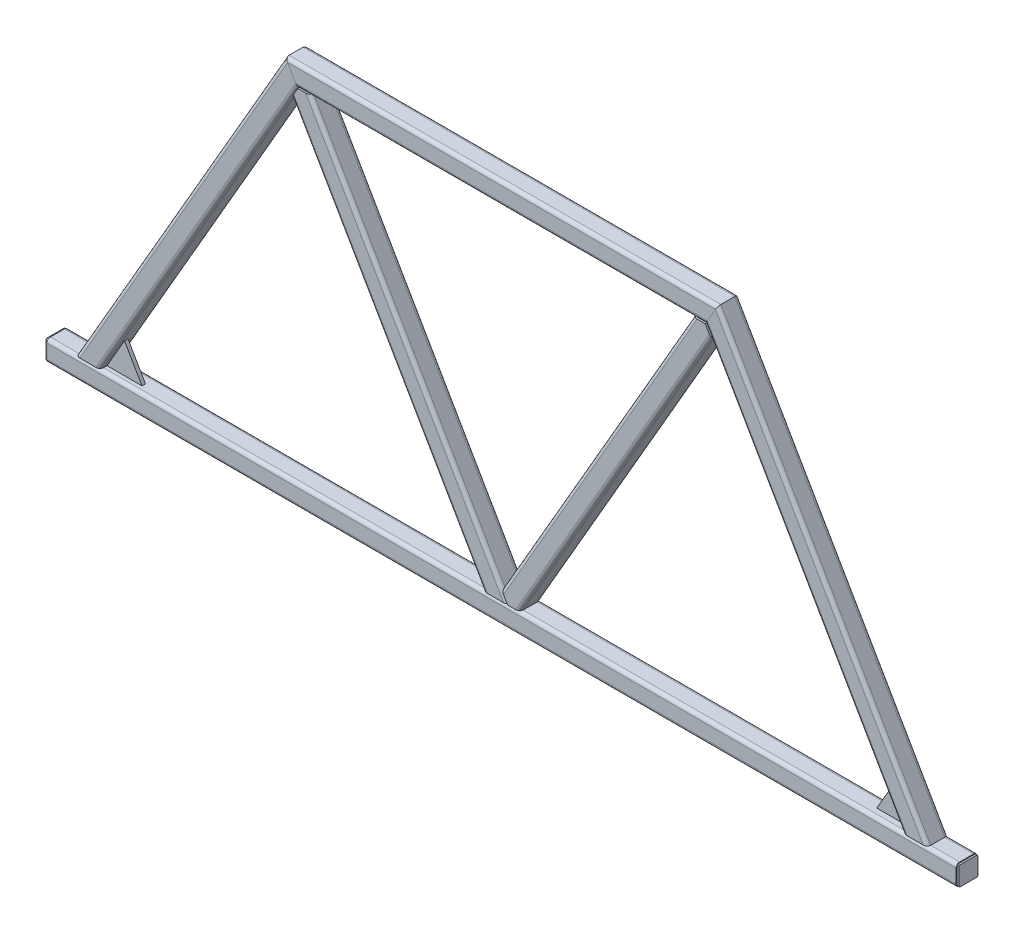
ISO-10303-21;
HEADER;
FILE_DESCRIPTION(('STEP AP214'),'2;1');
FILE_NAME('part.step','',(''),(''),'','','');
FILE_SCHEMA(('AUTOMOTIVE_DESIGN { 1 0 10303 214 1 1 1 1 }'));
ENDSEC;
DATA;
#1=APPLICATION_CONTEXT('core data for automotive mechanical design processes');
#2=APPLICATION_PROTOCOL_DEFINITION('international standard','automotive_design',2000,#1);
#3=PRODUCT_CONTEXT('',#1,'mechanical');
#4=PRODUCT('Part','Part','',(#3));
#5=PRODUCT_RELATED_PRODUCT_CATEGORY('part','',(#4));
#6=PRODUCT_DEFINITION_FORMATION('','',#4);
#7=PRODUCT_DEFINITION_CONTEXT('part definition',#1,'design');
#8=PRODUCT_DEFINITION('design','',#6,#7);
#9=PRODUCT_DEFINITION_SHAPE('','',#8);
#10=(LENGTH_UNIT() NAMED_UNIT(*) SI_UNIT(.MILLI.,.METRE.));
#11=(NAMED_UNIT(*) PLANE_ANGLE_UNIT() SI_UNIT($,.RADIAN.));
#12=(NAMED_UNIT(*) SI_UNIT($,.STERADIAN.) SOLID_ANGLE_UNIT());
#13=UNCERTAINTY_MEASURE_WITH_UNIT(LENGTH_MEASURE(1.E-05),#10,'distance_accuracy_value','');
#14=(GEOMETRIC_REPRESENTATION_CONTEXT(3) GLOBAL_UNCERTAINTY_ASSIGNED_CONTEXT((#13)) GLOBAL_UNIT_ASSIGNED_CONTEXT((#10,
#11,#12)) REPRESENTATION_CONTEXT('',''));
#15=CARTESIAN_POINT('',(0.,0.,0.));
#16=DIRECTION('',(0.,0.,1.));
#17=DIRECTION('',(1.,0.,0.));
#18=AXIS2_PLACEMENT_3D('',#15,#16,#17);
#19=CARTESIAN_POINT('',(1394.50886423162,148.085226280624,6.35));
#20=DIRECTION('',(0.866025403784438,-0.5,0.));
#21=DIRECTION('',(0.5,0.866025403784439,0.));
#22=AXIS2_PLACEMENT_3D('',#19,#20,#21);
#23=PLANE('',#22);
#24=DIRECTION('',(-0.5,-0.866025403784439,0.));
#25=VECTOR('',#24,1.);
#26=CARTESIAN_POINT('',(1394.50886423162,148.085226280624,-6.35));
#27=LINE('',#26,#25);
#28=CARTESIAN_POINT('',(1394.50886423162,148.085226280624,-6.35));
#29=VERTEX_POINT('',#28);
#30=CARTESIAN_POINT('',(1331.00886423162,38.1,-6.35));
#31=VERTEX_POINT('',#30);
#32=EDGE_CURVE('E289',#29,#31,#27,.T.);
#33=ORIENTED_EDGE('',*,*,#32,.T.);
#34=DIRECTION('',(0.,0.,-1.));
#35=VECTOR('',#34,1.);
#36=CARTESIAN_POINT('',(1331.00886423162,38.1,6.35));
#37=LINE('',#36,#35);
#38=CARTESIAN_POINT('',(1331.00886423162,38.1,6.35));
#39=VERTEX_POINT('',#38);
#40=EDGE_CURVE('E14',#39,#31,#37,.T.);
#41=ORIENTED_EDGE('',*,*,#40,.F.);
#42=DIRECTION('',(-0.5,-0.866025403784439,0.));
#43=VECTOR('',#42,1.);
#44=CARTESIAN_POINT('',(1394.50886423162,148.085226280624,6.35));
#45=LINE('',#44,#43);
#46=CARTESIAN_POINT('',(1394.50886423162,148.085226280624,6.35));
#47=VERTEX_POINT('',#46);
#48=EDGE_CURVE('E282',#47,#39,#45,.T.);
#49=ORIENTED_EDGE('',*,*,#48,.F.);
#50=DIRECTION('',(0.,0.,-1.));
#51=VECTOR('',#50,1.);
#52=CARTESIAN_POINT('',(1394.50886423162,148.085226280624,6.35));
#53=LINE('',#52,#51);
#54=EDGE_CURVE('E290',#47,#29,#53,.T.);
#55=ORIENTED_EDGE('',*,*,#54,.T.);
#56=EDGE_LOOP('',(#33,#41,#49,#55));
#57=FACE_BOUND('',#56,.T.);
#58=ADVANCED_FACE('F242',(#57),#23,.F.);
#59=CARTESIAN_POINT('',(1458.00886423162,38.1,6.35));
#60=DIRECTION('',(0.,1.,0.));
#61=DIRECTION('',(0.,0.,1.));
#62=AXIS2_PLACEMENT_3D('',#59,#60,#61);
#63=PLANE('',#62);
#64=DIRECTION('',(1.,0.,0.));
#65=VECTOR('',#64,1.);
#66=CARTESIAN_POINT('',(1458.00886423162,38.1,-6.35));
#67=LINE('',#66,#65);
#68=CARTESIAN_POINT('',(1458.00886423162,38.1,-6.35));
#69=VERTEX_POINT('',#68);
#70=EDGE_CURVE('E270',#31,#69,#67,.T.);
#71=ORIENTED_EDGE('',*,*,#70,.T.);
#72=DIRECTION('',(0.,0.,-1.));
#73=VECTOR('',#72,1.);
#74=CARTESIAN_POINT('',(1458.00886423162,38.1,6.35));
#75=LINE('',#74,#73);
#76=CARTESIAN_POINT('',(1458.00886423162,38.1,6.35));
#77=VERTEX_POINT('',#76);
#78=EDGE_CURVE('E250',#77,#69,#75,.T.);
#79=ORIENTED_EDGE('',*,*,#78,.F.);
#80=DIRECTION('',(1.,0.,0.));
#81=VECTOR('',#80,1.);
#82=CARTESIAN_POINT('',(1458.00886423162,38.1,6.35));
#83=LINE('',#82,#81);
#84=EDGE_CURVE('E278',#39,#77,#83,.T.);
#85=ORIENTED_EDGE('',*,*,#84,.F.);
#86=ORIENTED_EDGE('',*,*,#40,.T.);
#87=EDGE_LOOP('',(#71,#79,#85,#86));
#88=FACE_BOUND('',#87,.T.);
#89=ADVANCED_FACE('F279',(#88),#63,.F.);
#90=CARTESIAN_POINT('',(1458.00886423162,38.1,6.35));
#91=DIRECTION('',(-0.866025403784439,-0.499999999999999,0.));
#92=DIRECTION('',(0.499999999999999,-0.866025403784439,0.));
#93=AXIS2_PLACEMENT_3D('',#90,#91,#92);
#94=PLANE('',#93);
#95=DIRECTION('',(-0.499999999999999,0.866025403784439,0.));
#96=VECTOR('',#95,1.);
#97=CARTESIAN_POINT('',(1458.00886423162,38.1,-6.35));
#98=LINE('',#97,#96);
#99=EDGE_CURVE('E275',#69,#29,#98,.T.);
#100=ORIENTED_EDGE('',*,*,#99,.T.);
#101=ORIENTED_EDGE('',*,*,#54,.F.);
#102=DIRECTION('',(-0.499999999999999,0.866025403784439,0.));
#103=VECTOR('',#102,1.);
#104=CARTESIAN_POINT('',(1458.00886423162,38.1,6.35));
#105=LINE('',#104,#103);
#106=EDGE_CURVE('E258',#77,#47,#105,.T.);
#107=ORIENTED_EDGE('',*,*,#106,.F.);
#108=ORIENTED_EDGE('',*,*,#78,.T.);
#109=EDGE_LOOP('',(#100,#101,#107,#108));
#110=FACE_BOUND('',#109,.T.);
#111=ADVANCED_FACE('F297',(#110),#94,.F.);
#112=CARTESIAN_POINT('',(1331.00886423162,38.1,6.35));
#113=DIRECTION('',(0.,0.,-1.));
#114=DIRECTION('',(-1.,0.,0.));
#115=AXIS2_PLACEMENT_3D('',#112,#113,#114);
#116=PLANE('',#115);
#117=ORIENTED_EDGE('',*,*,#48,.T.);
#118=ORIENTED_EDGE('',*,*,#84,.T.);
#119=ORIENTED_EDGE('',*,*,#106,.T.);
#120=EDGE_LOOP('',(#117,#118,#119));
#121=FACE_BOUND('',#120,.T.);
#122=ADVANCED_FACE('F285',(#121),#116,.F.);
#123=CARTESIAN_POINT('',(1331.00886423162,38.1,-6.35));
#124=DIRECTION('',(0.,0.,-1.));
#125=DIRECTION('',(-1.,0.,0.));
#126=AXIS2_PLACEMENT_3D('',#123,#124,#125);
#127=PLANE('',#126);
#128=ORIENTED_EDGE('',*,*,#32,.F.);
#129=ORIENTED_EDGE('',*,*,#99,.F.);
#130=ORIENTED_EDGE('',*,*,#70,.F.);
#131=EDGE_LOOP('',(#128,#129,#130));
#132=FACE_BOUND('',#131,.T.);
#133=ADVANCED_FACE('F298',(#132),#127,.T.);
#134=CLOSED_SHELL('',(#58,#89,#111,#122,#133));
#135=MANIFOLD_SOLID_BREP('B2',#134);
#136=CARTESIAN_POINT('',(-1394.50886423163,148.085226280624,12.7));
#137=DIRECTION('',(-0.866025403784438,-0.500000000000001,0.));
#138=DIRECTION('',(0.500000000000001,-0.866025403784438,0.));
#139=AXIS2_PLACEMENT_3D('',#136,#137,#138);
#140=PLANE('',#139);
#141=DIRECTION('',(-0.500000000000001,0.866025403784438,0.));
#142=VECTOR('',#141,1.);
#143=CARTESIAN_POINT('',(-1394.50886423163,148.085226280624,0.));
#144=LINE('',#143,#142);
#145=CARTESIAN_POINT('',(-1331.00886423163,38.1,0.));
#146=VERTEX_POINT('',#145);
#147=CARTESIAN_POINT('',(-1394.50886423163,148.085226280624,0.));
#148=VERTEX_POINT('',#147);
#149=EDGE_CURVE('E387',#146,#148,#144,.T.);
#150=ORIENTED_EDGE('',*,*,#149,.T.);
#151=DIRECTION('',(0.,0.,-1.));
#152=VECTOR('',#151,1.);
#153=CARTESIAN_POINT('',(-1394.50886423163,148.085226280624,12.7));
#154=LINE('',#153,#152);
#155=CARTESIAN_POINT('',(-1394.50886423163,148.085226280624,12.7));
#156=VERTEX_POINT('',#155);
#157=EDGE_CURVE('E240',#156,#148,#154,.T.);
#158=ORIENTED_EDGE('',*,*,#157,.F.);
#159=DIRECTION('',(-0.500000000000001,0.866025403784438,0.));
#160=VECTOR('',#159,1.);
#161=CARTESIAN_POINT('',(-1394.50886423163,148.085226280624,12.7));
#162=LINE('',#161,#160);
#163=CARTESIAN_POINT('',(-1331.00886423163,38.1,12.7));
#164=VERTEX_POINT('',#163);
#165=EDGE_CURVE('E380',#164,#156,#162,.T.);
#166=ORIENTED_EDGE('',*,*,#165,.F.);
#167=DIRECTION('',(0.,0.,-1.));
#168=VECTOR('',#167,1.);
#169=CARTESIAN_POINT('',(-1331.00886423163,38.1,12.7));
#170=LINE('',#169,#168);
#171=EDGE_CURVE('E388',#164,#146,#170,.T.);
#172=ORIENTED_EDGE('',*,*,#171,.T.);
#173=EDGE_LOOP('',(#150,#158,#166,#172));
#174=FACE_BOUND('',#173,.T.);
#175=ADVANCED_FACE('F340',(#174),#140,.F.);
#176=CARTESIAN_POINT('',(-1458.00886423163,38.1,12.7));
#177=DIRECTION('',(0.866025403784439,-0.499999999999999,0.));
#178=DIRECTION('',(0.499999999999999,0.866025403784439,0.));
#179=AXIS2_PLACEMENT_3D('',#176,#177,#178);
#180=PLANE('',#179);
#181=DIRECTION('',(-0.499999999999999,-0.866025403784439,0.));
#182=VECTOR('',#181,1.);
#183=CARTESIAN_POINT('',(-1458.00886423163,38.1,0.));
#184=LINE('',#183,#182);
#185=CARTESIAN_POINT('',(-1458.00886423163,38.1,0.));
#186=VERTEX_POINT('',#185);
#187=EDGE_CURVE('E368',#148,#186,#184,.T.);
#188=ORIENTED_EDGE('',*,*,#187,.T.);
#189=DIRECTION('',(0.,0.,-1.));
#190=VECTOR('',#189,1.);
#191=CARTESIAN_POINT('',(-1458.00886423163,38.1,12.7));
#192=LINE('',#191,#190);
#193=CARTESIAN_POINT('',(-1458.00886423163,38.1,12.7));
#194=VERTEX_POINT('',#193);
#195=EDGE_CURVE('E348',#194,#186,#192,.T.);
#196=ORIENTED_EDGE('',*,*,#195,.F.);
#197=DIRECTION('',(-0.499999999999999,-0.866025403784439,0.));
#198=VECTOR('',#197,1.);
#199=CARTESIAN_POINT('',(-1458.00886423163,38.1,12.7));
#200=LINE('',#199,#198);
#201=EDGE_CURVE('E376',#156,#194,#200,.T.);
#202=ORIENTED_EDGE('',*,*,#201,.F.);
#203=ORIENTED_EDGE('',*,*,#157,.T.);
#204=EDGE_LOOP('',(#188,#196,#202,#203));
#205=FACE_BOUND('',#204,.T.);
#206=ADVANCED_FACE('F377',(#205),#180,.F.);
#207=CARTESIAN_POINT('',(-1458.00886423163,38.1,12.7));
#208=DIRECTION('',(0.,1.,0.));
#209=DIRECTION('',(0.,0.,1.));
#210=AXIS2_PLACEMENT_3D('',#207,#208,#209);
#211=PLANE('',#210);
#212=DIRECTION('',(1.,0.,0.));
#213=VECTOR('',#212,1.);
#214=CARTESIAN_POINT('',(-1458.00886423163,38.1,0.));
#215=LINE('',#214,#213);
#216=EDGE_CURVE('E373',#186,#146,#215,.T.);
#217=ORIENTED_EDGE('',*,*,#216,.T.);
#218=ORIENTED_EDGE('',*,*,#171,.F.);
#219=DIRECTION('',(1.,0.,0.));
#220=VECTOR('',#219,1.);
#221=CARTESIAN_POINT('',(-1458.00886423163,38.1,12.7));
#222=LINE('',#221,#220);
#223=EDGE_CURVE('E356',#194,#164,#222,.T.);
#224=ORIENTED_EDGE('',*,*,#223,.F.);
#225=ORIENTED_EDGE('',*,*,#195,.T.);
#226=EDGE_LOOP('',(#217,#218,#224,#225));
#227=FACE_BOUND('',#226,.T.);
#228=ADVANCED_FACE('F395',(#227),#211,.F.);
#229=CARTESIAN_POINT('',(-1331.00886423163,38.1,12.7));
#230=DIRECTION('',(0.,0.,1.));
#231=DIRECTION('',(1.,0.,0.));
#232=AXIS2_PLACEMENT_3D('',#229,#230,#231);
#233=PLANE('',#232);
#234=ORIENTED_EDGE('',*,*,#165,.T.);
#235=ORIENTED_EDGE('',*,*,#201,.T.);
#236=ORIENTED_EDGE('',*,*,#223,.T.);
#237=EDGE_LOOP('',(#234,#235,#236));
#238=FACE_BOUND('',#237,.T.);
#239=ADVANCED_FACE('F383',(#238),#233,.T.);
#240=CARTESIAN_POINT('',(-1331.00886423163,38.1,0.));
#241=DIRECTION('',(0.,0.,1.));
#242=DIRECTION('',(1.,0.,0.));
#243=AXIS2_PLACEMENT_3D('',#240,#241,#242);
#244=PLANE('',#243);
#245=ORIENTED_EDGE('',*,*,#149,.F.);
#246=ORIENTED_EDGE('',*,*,#216,.F.);
#247=ORIENTED_EDGE('',*,*,#187,.F.);
#248=EDGE_LOOP('',(#245,#246,#247));
#249=FACE_BOUND('',#248,.T.);
#250=ADVANCED_FACE('F396',(#249),#244,.F.);
#251=CLOSED_SHELL('',(#175,#206,#228,#239,#250));
#252=MANIFOLD_SOLID_BREP('B8',#251);
#253=CARTESIAN_POINT('',(1657.35,34.925,31.75));
#254=DIRECTION('',(0.,-0.707106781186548,-0.707106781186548));
#255=DIRECTION('',(0.,0.707106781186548,-0.707106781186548));
#256=AXIS2_PLACEMENT_3D('',#253,#254,#255);
#257=PLANE('',#256);
#258=DIRECTION('',(0.,-0.707106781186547,0.707106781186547));
#259=VECTOR('',#258,1.);
#260=CARTESIAN_POINT('',(1651.,34.925,31.75));
#261=LINE('',#260,#259);
#262=CARTESIAN_POINT('',(1651.,34.925,31.75));
#263=VERTEX_POINT('',#262);
#264=CARTESIAN_POINT('',(1651.,31.75,34.925));
#265=VERTEX_POINT('',#264);
#266=EDGE_CURVE('E534',#263,#265,#261,.T.);
#267=ORIENTED_EDGE('',*,*,#266,.T.);
#268=DIRECTION('',(-1.,0.,0.));
#269=VECTOR('',#268,1.);
#270=CARTESIAN_POINT('',(1657.35,31.75,34.925));
#271=LINE('',#270,#269);
#272=CARTESIAN_POINT('',(1657.35,31.75,34.925));
#273=VERTEX_POINT('',#272);
#274=EDGE_CURVE('E338',#273,#265,#271,.T.);
#275=ORIENTED_EDGE('',*,*,#274,.F.);
#276=DIRECTION('',(0.,-0.707106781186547,0.707106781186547));
#277=VECTOR('',#276,1.);
#278=CARTESIAN_POINT('',(1657.35,34.925,31.75));
#279=LINE('',#278,#277);
#280=CARTESIAN_POINT('',(1657.35,34.925,31.75));
#281=VERTEX_POINT('',#280);
#282=EDGE_CURVE('E548',#281,#273,#279,.T.);
#283=ORIENTED_EDGE('',*,*,#282,.F.);
#284=DIRECTION('',(-1.,0.,0.));
#285=VECTOR('',#284,1.);
#286=CARTESIAN_POINT('',(1657.35,34.925,31.75));
#287=LINE('',#286,#285);
#288=EDGE_CURVE('E530',#281,#263,#287,.T.);
#289=ORIENTED_EDGE('',*,*,#288,.T.);
#290=EDGE_LOOP('',(#267,#275,#283,#289));
#291=FACE_BOUND('',#290,.T.);
#292=ADVANCED_FACE('F438',(#291),#257,.F.);
#293=CARTESIAN_POINT('',(1657.35,31.75,34.925));
#294=DIRECTION('',(0.,0.,-1.));
#295=DIRECTION('',(-1.,0.,0.));
#296=AXIS2_PLACEMENT_3D('',#293,#294,#295);
#297=PLANE('',#296);
#298=DIRECTION('',(0.,-1.,0.));
#299=VECTOR('',#298,1.);
#300=CARTESIAN_POINT('',(1651.,31.75,34.925));
#301=LINE('',#300,#299);
#302=CARTESIAN_POINT('',(1651.,-31.75,34.925));
#303=VERTEX_POINT('',#302);
#304=EDGE_CURVE('E537',#265,#303,#301,.T.);
#305=ORIENTED_EDGE('',*,*,#304,.T.);
#306=DIRECTION('',(-1.,0.,0.));
#307=VECTOR('',#306,1.);
#308=CARTESIAN_POINT('',(1657.35,-31.75,34.925));
#309=LINE('',#308,#307);
#310=CARTESIAN_POINT('',(1657.35,-31.75,34.925));
#311=VERTEX_POINT('',#310);
#312=EDGE_CURVE('E446',#311,#303,#309,.T.);
#313=ORIENTED_EDGE('',*,*,#312,.F.);
#314=DIRECTION('',(0.,-1.,0.));
#315=VECTOR('',#314,1.);
#316=CARTESIAN_POINT('',(1657.35,31.75,34.925));
#317=LINE('',#316,#315);
#318=EDGE_CURVE('E497',#273,#311,#317,.T.);
#319=ORIENTED_EDGE('',*,*,#318,.F.);
#320=ORIENTED_EDGE('',*,*,#274,.T.);
#321=EDGE_LOOP('',(#305,#313,#319,#320));
#322=FACE_BOUND('',#321,.T.);
#323=ADVANCED_FACE('F583',(#322),#297,.F.);
#324=CARTESIAN_POINT('',(1657.35,-31.75,34.925));
#325=DIRECTION('',(0.,0.707106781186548,-0.707106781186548));
#326=DIRECTION('',(0.,0.707106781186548,0.707106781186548));
#327=AXIS2_PLACEMENT_3D('',#324,#325,#326);
#328=PLANE('',#327);
#329=DIRECTION('',(0.,-0.707106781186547,-0.707106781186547));
#330=VECTOR('',#329,1.);
#331=CARTESIAN_POINT('',(1651.,-31.75,34.925));
#332=LINE('',#331,#330);
#333=CARTESIAN_POINT('',(1651.,-34.925,31.75));
#334=VERTEX_POINT('',#333);
#335=EDGE_CURVE('E539',#303,#334,#332,.T.);
#336=ORIENTED_EDGE('',*,*,#335,.T.);
#337=DIRECTION('',(-1.,0.,0.));
#338=VECTOR('',#337,1.);
#339=CARTESIAN_POINT('',(1657.35,-34.925,31.75));
#340=LINE('',#339,#338);
#341=CARTESIAN_POINT('',(1657.35,-34.925,31.75));
#342=VERTEX_POINT('',#341);
#343=EDGE_CURVE('E555',#342,#334,#340,.T.);
#344=ORIENTED_EDGE('',*,*,#343,.F.);
#345=DIRECTION('',(0.,-0.707106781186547,-0.707106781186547));
#346=VECTOR('',#345,1.);
#347=CARTESIAN_POINT('',(1657.35,-31.75,34.925));
#348=LINE('',#347,#346);
#349=EDGE_CURVE('E563',#311,#342,#348,.T.);
#350=ORIENTED_EDGE('',*,*,#349,.F.);
#351=ORIENTED_EDGE('',*,*,#312,.T.);
#352=EDGE_LOOP('',(#336,#344,#350,#351));
#353=FACE_BOUND('',#352,.T.);
#354=ADVANCED_FACE('F561',(#353),#328,.F.);
#355=CARTESIAN_POINT('',(1657.35,-34.925,31.75));
#356=DIRECTION('',(0.,1.,0.));
#357=DIRECTION('',(0.,0.,1.));
#358=AXIS2_PLACEMENT_3D('',#355,#356,#357);
#359=PLANE('',#358);
#360=DIRECTION('',(0.,0.,-1.));
#361=VECTOR('',#360,1.);
#362=CARTESIAN_POINT('',(1651.,-34.925,31.75));
#363=LINE('',#362,#361);
#364=CARTESIAN_POINT('',(1651.,-34.925,-31.7499999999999));
#365=VERTEX_POINT('',#364);
#366=EDGE_CURVE('E541',#334,#365,#363,.T.);
#367=ORIENTED_EDGE('',*,*,#366,.T.);
#368=DIRECTION('',(-1.,0.,0.));
#369=VECTOR('',#368,1.);
#370=CARTESIAN_POINT('',(1657.35,-34.925,-31.7499999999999));
#371=LINE('',#370,#369);
#372=CARTESIAN_POINT('',(1657.35,-34.925,-31.7499999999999));
#373=VERTEX_POINT('',#372);
#374=EDGE_CURVE('E552',#373,#365,#371,.T.);
#375=ORIENTED_EDGE('',*,*,#374,.F.);
#376=DIRECTION('',(0.,0.,-1.));
#377=VECTOR('',#376,1.);
#378=CARTESIAN_POINT('',(1657.35,-34.925,31.75));
#379=LINE('',#378,#377);
#380=EDGE_CURVE('E575',#342,#373,#379,.T.);
#381=ORIENTED_EDGE('',*,*,#380,.F.);
#382=ORIENTED_EDGE('',*,*,#343,.T.);
#383=EDGE_LOOP('',(#367,#375,#381,#382));
#384=FACE_BOUND('',#383,.T.);
#385=ADVANCED_FACE('F571',(#384),#359,.F.);
#386=CARTESIAN_POINT('',(1657.35,-34.925,-31.75));
#387=DIRECTION('',(0.,0.707106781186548,0.707106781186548));
#388=DIRECTION('',(0.,-0.707106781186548,0.707106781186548));
#389=AXIS2_PLACEMENT_3D('',#386,#387,#388);
#390=PLANE('',#389);
#391=DIRECTION('',(0.,0.707106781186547,-0.707106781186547));
#392=VECTOR('',#391,1.);
#393=CARTESIAN_POINT('',(1651.,-34.925,-31.75));
#394=LINE('',#393,#392);
#395=CARTESIAN_POINT('',(1651.,-31.75,-34.925));
#396=VERTEX_POINT('',#395);
#397=EDGE_CURVE('E543',#365,#396,#394,.T.);
#398=ORIENTED_EDGE('',*,*,#397,.T.);
#399=DIRECTION('',(-1.,0.,0.));
#400=VECTOR('',#399,1.);
#401=CARTESIAN_POINT('',(1657.35,-31.75,-34.925));
#402=LINE('',#401,#400);
#403=CARTESIAN_POINT('',(1657.35,-31.75,-34.925));
#404=VERTEX_POINT('',#403);
#405=EDGE_CURVE('E525',#404,#396,#402,.T.);
#406=ORIENTED_EDGE('',*,*,#405,.F.);
#407=DIRECTION('',(0.,0.707106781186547,-0.707106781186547));
#408=VECTOR('',#407,1.);
#409=CARTESIAN_POINT('',(1657.35,-34.925,-31.75));
#410=LINE('',#409,#408);
#411=EDGE_CURVE('E516',#373,#404,#410,.T.);
#412=ORIENTED_EDGE('',*,*,#411,.F.);
#413=ORIENTED_EDGE('',*,*,#374,.T.);
#414=EDGE_LOOP('',(#398,#406,#412,#413));
#415=FACE_BOUND('',#414,.T.);
#416=ADVANCED_FACE('F574',(#415),#390,.F.);
#417=CARTESIAN_POINT('',(1657.35,-31.75,-34.925));
#418=DIRECTION('',(0.,0.,1.));
#419=DIRECTION('',(0.,-1.,0.));
#420=AXIS2_PLACEMENT_3D('',#417,#418,#419);
#421=PLANE('',#420);
#422=DIRECTION('',(0.,1.,0.));
#423=VECTOR('',#422,1.);
#424=CARTESIAN_POINT('',(1651.,-31.75,-34.925));
#425=LINE('',#424,#423);
#426=CARTESIAN_POINT('',(1651.,31.75,-34.925));
#427=VERTEX_POINT('',#426);
#428=EDGE_CURVE('E524',#396,#427,#425,.T.);
#429=ORIENTED_EDGE('',*,*,#428,.T.);
#430=DIRECTION('',(-1.,0.,0.));
#431=VECTOR('',#430,1.);
#432=CARTESIAN_POINT('',(1657.35,31.75,-34.925));
#433=LINE('',#432,#431);
#434=CARTESIAN_POINT('',(1657.35,31.75,-34.925));
#435=VERTEX_POINT('',#434);
#436=EDGE_CURVE('E521',#435,#427,#433,.T.);
#437=ORIENTED_EDGE('',*,*,#436,.F.);
#438=DIRECTION('',(0.,1.,0.));
#439=VECTOR('',#438,1.);
#440=CARTESIAN_POINT('',(1657.35,-31.75,-34.925));
#441=LINE('',#440,#439);
#442=EDGE_CURVE('E510',#404,#435,#441,.T.);
#443=ORIENTED_EDGE('',*,*,#442,.F.);
#444=ORIENTED_EDGE('',*,*,#405,.T.);
#445=EDGE_LOOP('',(#429,#437,#443,#444));
#446=FACE_BOUND('',#445,.T.);
#447=ADVANCED_FACE('F522',(#446),#421,.F.);
#448=CARTESIAN_POINT('',(1657.35,31.75,-34.925));
#449=DIRECTION('',(0.,-0.707106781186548,0.707106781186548));
#450=DIRECTION('',(0.,-0.707106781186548,-0.707106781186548));
#451=AXIS2_PLACEMENT_3D('',#448,#449,#450);
#452=PLANE('',#451);
#453=DIRECTION('',(0.,0.707106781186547,0.707106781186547));
#454=VECTOR('',#453,1.);
#455=CARTESIAN_POINT('',(1651.,31.75,-34.925));
#456=LINE('',#455,#454);
#457=CARTESIAN_POINT('',(1651.,34.925,-31.75));
#458=VERTEX_POINT('',#457);
#459=EDGE_CURVE('E483',#427,#458,#456,.T.);
#460=ORIENTED_EDGE('',*,*,#459,.T.);
#461=DIRECTION('',(-1.,0.,0.));
#462=VECTOR('',#461,1.);
#463=CARTESIAN_POINT('',(1657.35,34.925,-31.75));
#464=LINE('',#463,#462);
#465=CARTESIAN_POINT('',(1657.35,34.925,-31.75));
#466=VERTEX_POINT('',#465);
#467=EDGE_CURVE('E526',#466,#458,#464,.T.);
#468=ORIENTED_EDGE('',*,*,#467,.F.);
#469=DIRECTION('',(0.,0.707106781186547,0.707106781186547));
#470=VECTOR('',#469,1.);
#471=CARTESIAN_POINT('',(1657.35,31.75,-34.925));
#472=LINE('',#471,#470);
#473=EDGE_CURVE('E514',#435,#466,#472,.T.);
#474=ORIENTED_EDGE('',*,*,#473,.F.);
#475=ORIENTED_EDGE('',*,*,#436,.T.);
#476=EDGE_LOOP('',(#460,#468,#474,#475));
#477=FACE_BOUND('',#476,.T.);
#478=ADVANCED_FACE('F528',(#477),#452,.F.);
#479=CARTESIAN_POINT('',(1657.35,34.925,-31.75));
#480=DIRECTION('',(0.,-1.,0.));
#481=DIRECTION('',(0.,0.,-1.));
#482=AXIS2_PLACEMENT_3D('',#479,#480,#481);
#483=PLANE('',#482);
#484=DIRECTION('',(0.,0.,1.));
#485=VECTOR('',#484,1.);
#486=CARTESIAN_POINT('',(1651.,34.925,-31.75));
#487=LINE('',#486,#485);
#488=EDGE_CURVE('E489',#458,#263,#487,.T.);
#489=ORIENTED_EDGE('',*,*,#488,.T.);
#490=ORIENTED_EDGE('',*,*,#288,.F.);
#491=DIRECTION('',(0.,0.,1.));
#492=VECTOR('',#491,1.);
#493=CARTESIAN_POINT('',(1657.35,34.925,-31.75));
#494=LINE('',#493,#492);
#495=EDGE_CURVE('E454',#466,#281,#494,.T.);
#496=ORIENTED_EDGE('',*,*,#495,.F.);
#497=ORIENTED_EDGE('',*,*,#467,.T.);
#498=EDGE_LOOP('',(#489,#490,#496,#497));
#499=FACE_BOUND('',#498,.T.);
#500=ADVANCED_FACE('F599',(#499),#483,.F.);
#501=CARTESIAN_POINT('',(1657.35,0.,66.675));
#502=DIRECTION('',(1.,0.,0.));
#503=DIRECTION('',(0.,0.,-1.));
#504=AXIS2_PLACEMENT_3D('',#501,#502,#503);
#505=PLANE('',#504);
#506=ORIENTED_EDGE('',*,*,#282,.T.);
#507=ORIENTED_EDGE('',*,*,#318,.T.);
#508=ORIENTED_EDGE('',*,*,#349,.T.);
#509=ORIENTED_EDGE('',*,*,#380,.T.);
#510=ORIENTED_EDGE('',*,*,#411,.T.);
#511=ORIENTED_EDGE('',*,*,#442,.T.);
#512=ORIENTED_EDGE('',*,*,#473,.T.);
#513=ORIENTED_EDGE('',*,*,#495,.T.);
#514=EDGE_LOOP('',(#506,#507,#508,#509,#510,#511,#512,#513));
#515=FACE_BOUND('',#514,.T.);
#516=ADVANCED_FACE('F512',(#515),#505,.T.);
#517=CARTESIAN_POINT('',(1651.,0.,66.675));
#518=DIRECTION('',(1.,0.,0.));
#519=DIRECTION('',(0.,0.,-1.));
#520=AXIS2_PLACEMENT_3D('',#517,#518,#519);
#521=PLANE('',#520);
#522=ORIENTED_EDGE('',*,*,#266,.F.);
#523=ORIENTED_EDGE('',*,*,#488,.F.);
#524=ORIENTED_EDGE('',*,*,#459,.F.);
#525=ORIENTED_EDGE('',*,*,#428,.F.);
#526=ORIENTED_EDGE('',*,*,#397,.F.);
#527=ORIENTED_EDGE('',*,*,#366,.F.);
#528=ORIENTED_EDGE('',*,*,#335,.F.);
#529=ORIENTED_EDGE('',*,*,#304,.F.);
#530=EDGE_LOOP('',(#522,#523,#524,#525,#526,#527,#528,#529));
#531=FACE_BOUND('',#530,.T.);
#532=ADVANCED_FACE('F567',(#531),#521,.F.);
#533=CLOSED_SHELL('',(#292,#323,#354,#385,#416,#447,#478,#500,#516,#532));
#534=MANIFOLD_SOLID_BREP('B234',#533);
#535=CARTESIAN_POINT('',(-1657.35,31.75,34.925));
#536=DIRECTION('',(0.,-0.707106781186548,-0.707106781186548));
#537=DIRECTION('',(0.,0.707106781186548,-0.707106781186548));
#538=AXIS2_PLACEMENT_3D('',#535,#536,#537);
#539=PLANE('',#538);
#540=DIRECTION('',(0.,0.707106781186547,-0.707106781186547));
#541=VECTOR('',#540,1.);
#542=CARTESIAN_POINT('',(-1651.,31.75,34.925));
#543=LINE('',#542,#541);
#544=CARTESIAN_POINT('',(-1651.,31.75,34.925));
#545=VERTEX_POINT('',#544);
#546=CARTESIAN_POINT('',(-1651.,34.925,31.75));
#547=VERTEX_POINT('',#546);
#548=EDGE_CURVE('E752',#545,#547,#543,.T.);
#549=ORIENTED_EDGE('',*,*,#548,.T.);
#550=DIRECTION('',(1.,0.,0.));
#551=VECTOR('',#550,1.);
#552=CARTESIAN_POINT('',(-1657.35,34.925,31.75));
#553=LINE('',#552,#551);
#554=CARTESIAN_POINT('',(-1657.35,34.925,31.75));
#555=VERTEX_POINT('',#554);
#556=EDGE_CURVE('E436',#555,#547,#553,.T.);
#557=ORIENTED_EDGE('',*,*,#556,.F.);
#558=DIRECTION('',(0.,0.707106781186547,-0.707106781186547));
#559=VECTOR('',#558,1.);
#560=CARTESIAN_POINT('',(-1657.35,31.75,34.925));
#561=LINE('',#560,#559);
#562=CARTESIAN_POINT('',(-1657.35,31.75,34.925));
#563=VERTEX_POINT('',#562);
#564=EDGE_CURVE('E766',#563,#555,#561,.T.);
#565=ORIENTED_EDGE('',*,*,#564,.F.);
#566=DIRECTION('',(1.,0.,0.));
#567=VECTOR('',#566,1.);
#568=CARTESIAN_POINT('',(-1657.35,31.75,34.925));
#569=LINE('',#568,#567);
#570=EDGE_CURVE('E748',#563,#545,#569,.T.);
#571=ORIENTED_EDGE('',*,*,#570,.T.);
#572=EDGE_LOOP('',(#549,#557,#565,#571));
#573=FACE_BOUND('',#572,.T.);
#574=ADVANCED_FACE('F656',(#573),#539,.F.);
#575=CARTESIAN_POINT('',(-1657.35,34.925,31.75));
#576=DIRECTION('',(0.,-1.,0.));
#577=DIRECTION('',(0.,0.,-1.));
#578=AXIS2_PLACEMENT_3D('',#575,#576,#577);
#579=PLANE('',#578);
#580=DIRECTION('',(0.,0.,-1.));
#581=VECTOR('',#580,1.);
#582=CARTESIAN_POINT('',(-1651.,34.925,31.75));
#583=LINE('',#582,#581);
#584=CARTESIAN_POINT('',(-1651.,34.925,-31.75));
#585=VERTEX_POINT('',#584);
#586=EDGE_CURVE('E755',#547,#585,#583,.T.);
#587=ORIENTED_EDGE('',*,*,#586,.T.);
#588=DIRECTION('',(1.,0.,0.));
#589=VECTOR('',#588,1.);
#590=CARTESIAN_POINT('',(-1657.35,34.925,-31.75));
#591=LINE('',#590,#589);
#592=CARTESIAN_POINT('',(-1657.35,34.925,-31.75));
#593=VERTEX_POINT('',#592);
#594=EDGE_CURVE('E664',#593,#585,#591,.T.);
#595=ORIENTED_EDGE('',*,*,#594,.F.);
#596=DIRECTION('',(0.,0.,-1.));
#597=VECTOR('',#596,1.);
#598=CARTESIAN_POINT('',(-1657.35,34.925,31.75));
#599=LINE('',#598,#597);
#600=EDGE_CURVE('E715',#555,#593,#599,.T.);
#601=ORIENTED_EDGE('',*,*,#600,.F.);
#602=ORIENTED_EDGE('',*,*,#556,.T.);
#603=EDGE_LOOP('',(#587,#595,#601,#602));
#604=FACE_BOUND('',#603,.T.);
#605=ADVANCED_FACE('F801',(#604),#579,.F.);
#606=CARTESIAN_POINT('',(-1657.35,34.925,-31.75));
#607=DIRECTION('',(0.,-0.707106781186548,0.707106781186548));
#608=DIRECTION('',(0.,-0.707106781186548,-0.707106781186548));
#609=AXIS2_PLACEMENT_3D('',#606,#607,#608);
#610=PLANE('',#609);
#611=DIRECTION('',(0.,-0.707106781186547,-0.707106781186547));
#612=VECTOR('',#611,1.);
#613=CARTESIAN_POINT('',(-1651.,34.925,-31.75));
#614=LINE('',#613,#612);
#615=CARTESIAN_POINT('',(-1651.,31.75,-34.925));
#616=VERTEX_POINT('',#615);
#617=EDGE_CURVE('E757',#585,#616,#614,.T.);
#618=ORIENTED_EDGE('',*,*,#617,.T.);
#619=DIRECTION('',(1.,0.,0.));
#620=VECTOR('',#619,1.);
#621=CARTESIAN_POINT('',(-1657.35,31.75,-34.925));
#622=LINE('',#621,#620);
#623=CARTESIAN_POINT('',(-1657.35,31.75,-34.925));
#624=VERTEX_POINT('',#623);
#625=EDGE_CURVE('E773',#624,#616,#622,.T.);
#626=ORIENTED_EDGE('',*,*,#625,.F.);
#627=DIRECTION('',(0.,-0.707106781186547,-0.707106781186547));
#628=VECTOR('',#627,1.);
#629=CARTESIAN_POINT('',(-1657.35,34.925,-31.75));
#630=LINE('',#629,#628);
#631=EDGE_CURVE('E781',#593,#624,#630,.T.);
#632=ORIENTED_EDGE('',*,*,#631,.F.);
#633=ORIENTED_EDGE('',*,*,#594,.T.);
#634=EDGE_LOOP('',(#618,#626,#632,#633));
#635=FACE_BOUND('',#634,.T.);
#636=ADVANCED_FACE('F779',(#635),#610,.F.);
#637=CARTESIAN_POINT('',(-1657.35,31.75,-34.925));
#638=DIRECTION('',(0.,0.,1.));
#639=DIRECTION('',(0.,-1.,0.));
#640=AXIS2_PLACEMENT_3D('',#637,#638,#639);
#641=PLANE('',#640);
#642=DIRECTION('',(0.,-1.,0.));
#643=VECTOR('',#642,1.);
#644=CARTESIAN_POINT('',(-1651.,31.75,-34.925));
#645=LINE('',#644,#643);
#646=CARTESIAN_POINT('',(-1651.,-31.75,-34.925));
#647=VERTEX_POINT('',#646);
#648=EDGE_CURVE('E759',#616,#647,#645,.T.);
#649=ORIENTED_EDGE('',*,*,#648,.T.);
#650=DIRECTION('',(1.,0.,0.));
#651=VECTOR('',#650,1.);
#652=CARTESIAN_POINT('',(-1657.35,-31.75,-34.925));
#653=LINE('',#652,#651);
#654=CARTESIAN_POINT('',(-1657.35,-31.75,-34.925));
#655=VERTEX_POINT('',#654);
#656=EDGE_CURVE('E770',#655,#647,#653,.T.);
#657=ORIENTED_EDGE('',*,*,#656,.F.);
#658=DIRECTION('',(0.,-1.,0.));
#659=VECTOR('',#658,1.);
#660=CARTESIAN_POINT('',(-1657.35,31.75,-34.925));
#661=LINE('',#660,#659);
#662=EDGE_CURVE('E793',#624,#655,#661,.T.);
#663=ORIENTED_EDGE('',*,*,#662,.F.);
#664=ORIENTED_EDGE('',*,*,#625,.T.);
#665=EDGE_LOOP('',(#649,#657,#663,#664));
#666=FACE_BOUND('',#665,.T.);
#667=ADVANCED_FACE('F789',(#666),#641,.F.);
#668=CARTESIAN_POINT('',(-1657.35,-31.75,-34.925));
#669=DIRECTION('',(0.,0.707106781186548,0.707106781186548));
#670=DIRECTION('',(0.,-0.707106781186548,0.707106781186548));
#671=AXIS2_PLACEMENT_3D('',#668,#669,#670);
#672=PLANE('',#671);
#673=DIRECTION('',(0.,-0.707106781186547,0.707106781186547));
#674=VECTOR('',#673,1.);
#675=CARTESIAN_POINT('',(-1651.,-31.75,-34.925));
#676=LINE('',#675,#674);
#677=CARTESIAN_POINT('',(-1651.,-34.925,-31.75));
#678=VERTEX_POINT('',#677);
#679=EDGE_CURVE('E761',#647,#678,#676,.T.);
#680=ORIENTED_EDGE('',*,*,#679,.T.);
#681=DIRECTION('',(1.,0.,0.));
#682=VECTOR('',#681,1.);
#683=CARTESIAN_POINT('',(-1657.35,-34.925,-31.75));
#684=LINE('',#683,#682);
#685=CARTESIAN_POINT('',(-1657.35,-34.925,-31.75));
#686=VERTEX_POINT('',#685);
#687=EDGE_CURVE('E743',#686,#678,#684,.T.);
#688=ORIENTED_EDGE('',*,*,#687,.F.);
#689=DIRECTION('',(0.,-0.707106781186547,0.707106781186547));
#690=VECTOR('',#689,1.);
#691=CARTESIAN_POINT('',(-1657.35,-31.75,-34.925));
#692=LINE('',#691,#690);
#693=EDGE_CURVE('E734',#655,#686,#692,.T.);
#694=ORIENTED_EDGE('',*,*,#693,.F.);
#695=ORIENTED_EDGE('',*,*,#656,.T.);
#696=EDGE_LOOP('',(#680,#688,#694,#695));
#697=FACE_BOUND('',#696,.T.);
#698=ADVANCED_FACE('F792',(#697),#672,.F.);
#699=CARTESIAN_POINT('',(-1657.35,-34.925,-31.75));
#700=DIRECTION('',(0.,1.,0.));
#701=DIRECTION('',(0.,0.,1.));
#702=AXIS2_PLACEMENT_3D('',#699,#700,#701);
#703=PLANE('',#702);
#704=DIRECTION('',(0.,0.,1.));
#705=VECTOR('',#704,1.);
#706=CARTESIAN_POINT('',(-1651.,-34.925,-31.75));
#707=LINE('',#706,#705);
#708=CARTESIAN_POINT('',(-1651.,-34.925,31.75));
#709=VERTEX_POINT('',#708);
#710=EDGE_CURVE('E742',#678,#709,#707,.T.);
#711=ORIENTED_EDGE('',*,*,#710,.T.);
#712=DIRECTION('',(1.,0.,0.));
#713=VECTOR('',#712,1.);
#714=CARTESIAN_POINT('',(-1657.35,-34.925,31.75));
#715=LINE('',#714,#713);
#716=CARTESIAN_POINT('',(-1657.35,-34.925,31.75));
#717=VERTEX_POINT('',#716);
#718=EDGE_CURVE('E739',#717,#709,#715,.T.);
#719=ORIENTED_EDGE('',*,*,#718,.F.);
#720=DIRECTION('',(0.,0.,1.));
#721=VECTOR('',#720,1.);
#722=CARTESIAN_POINT('',(-1657.35,-34.925,-31.75));
#723=LINE('',#722,#721);
#724=EDGE_CURVE('E728',#686,#717,#723,.T.);
#725=ORIENTED_EDGE('',*,*,#724,.F.);
#726=ORIENTED_EDGE('',*,*,#687,.T.);
#727=EDGE_LOOP('',(#711,#719,#725,#726));
#728=FACE_BOUND('',#727,.T.);
#729=ADVANCED_FACE('F740',(#728),#703,.F.);
#730=CARTESIAN_POINT('',(-1657.35,-34.925,31.75));
#731=DIRECTION('',(0.,0.707106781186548,-0.707106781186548));
#732=DIRECTION('',(0.,0.707106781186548,0.707106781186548));
#733=AXIS2_PLACEMENT_3D('',#730,#731,#732);
#734=PLANE('',#733);
#735=DIRECTION('',(0.,0.707106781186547,0.707106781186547));
#736=VECTOR('',#735,1.);
#737=CARTESIAN_POINT('',(-1651.,-34.925,31.75));
#738=LINE('',#737,#736);
#739=CARTESIAN_POINT('',(-1651.,-31.75,34.925));
#740=VERTEX_POINT('',#739);
#741=EDGE_CURVE('E701',#709,#740,#738,.T.);
#742=ORIENTED_EDGE('',*,*,#741,.T.);
#743=DIRECTION('',(1.,0.,0.));
#744=VECTOR('',#743,1.);
#745=CARTESIAN_POINT('',(-1657.35,-31.75,34.925));
#746=LINE('',#745,#744);
#747=CARTESIAN_POINT('',(-1657.35,-31.75,34.925));
#748=VERTEX_POINT('',#747);
#749=EDGE_CURVE('E744',#748,#740,#746,.T.);
#750=ORIENTED_EDGE('',*,*,#749,.F.);
#751=DIRECTION('',(0.,0.707106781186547,0.707106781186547));
#752=VECTOR('',#751,1.);
#753=CARTESIAN_POINT('',(-1657.35,-34.925,31.75));
#754=LINE('',#753,#752);
#755=EDGE_CURVE('E732',#717,#748,#754,.T.);
#756=ORIENTED_EDGE('',*,*,#755,.F.);
#757=ORIENTED_EDGE('',*,*,#718,.T.);
#758=EDGE_LOOP('',(#742,#750,#756,#757));
#759=FACE_BOUND('',#758,.T.);
#760=ADVANCED_FACE('F746',(#759),#734,.F.);
#761=CARTESIAN_POINT('',(-1657.35,-31.75,34.925));
#762=DIRECTION('',(0.,0.,-1.));
#763=DIRECTION('',(-1.,0.,0.));
#764=AXIS2_PLACEMENT_3D('',#761,#762,#763);
#765=PLANE('',#764);
#766=DIRECTION('',(0.,1.,0.));
#767=VECTOR('',#766,1.);
#768=CARTESIAN_POINT('',(-1651.,-31.75,34.925));
#769=LINE('',#768,#767);
#770=EDGE_CURVE('E707',#740,#545,#769,.T.);
#771=ORIENTED_EDGE('',*,*,#770,.T.);
#772=ORIENTED_EDGE('',*,*,#570,.F.);
#773=DIRECTION('',(0.,1.,0.));
#774=VECTOR('',#773,1.);
#775=CARTESIAN_POINT('',(-1657.35,-31.75,34.925));
#776=LINE('',#775,#774);
#777=EDGE_CURVE('E672',#748,#563,#776,.T.);
#778=ORIENTED_EDGE('',*,*,#777,.F.);
#779=ORIENTED_EDGE('',*,*,#749,.T.);
#780=EDGE_LOOP('',(#771,#772,#778,#779));
#781=FACE_BOUND('',#780,.T.);
#782=ADVANCED_FACE('F817',(#781),#765,.F.);
#783=CARTESIAN_POINT('',(-1657.35,66.675,0.));
#784=DIRECTION('',(-1.,0.,0.));
#785=DIRECTION('',(0.,0.,1.));
#786=AXIS2_PLACEMENT_3D('',#783,#784,#785);
#787=PLANE('',#786);
#788=ORIENTED_EDGE('',*,*,#564,.T.);
#789=ORIENTED_EDGE('',*,*,#600,.T.);
#790=ORIENTED_EDGE('',*,*,#631,.T.);
#791=ORIENTED_EDGE('',*,*,#662,.T.);
#792=ORIENTED_EDGE('',*,*,#693,.T.);
#793=ORIENTED_EDGE('',*,*,#724,.T.);
#794=ORIENTED_EDGE('',*,*,#755,.T.);
#795=ORIENTED_EDGE('',*,*,#777,.T.);
#796=EDGE_LOOP('',(#788,#789,#790,#791,#792,#793,#794,#795));
#797=FACE_BOUND('',#796,.T.);
#798=ADVANCED_FACE('F730',(#797),#787,.T.);
#799=CARTESIAN_POINT('',(-1651.,66.675,0.));
#800=DIRECTION('',(-1.,0.,0.));
#801=DIRECTION('',(0.,0.,1.));
#802=AXIS2_PLACEMENT_3D('',#799,#800,#801);
#803=PLANE('',#802);
#804=ORIENTED_EDGE('',*,*,#548,.F.);
#805=ORIENTED_EDGE('',*,*,#770,.F.);
#806=ORIENTED_EDGE('',*,*,#741,.F.);
#807=ORIENTED_EDGE('',*,*,#710,.F.);
#808=ORIENTED_EDGE('',*,*,#679,.F.);
#809=ORIENTED_EDGE('',*,*,#648,.F.);
#810=ORIENTED_EDGE('',*,*,#617,.F.);
#811=ORIENTED_EDGE('',*,*,#586,.F.);
#812=EDGE_LOOP('',(#804,#805,#806,#807,#808,#809,#810,#811));
#813=FACE_BOUND('',#812,.T.);
#814=ADVANCED_FACE('F785',(#813),#803,.F.);
#815=CLOSED_SHELL('',(#574,#605,#636,#667,#698,#729,#760,#782,#798,#814));
#816=MANIFOLD_SOLID_BREP('B332',#815);
#817=CARTESIAN_POINT('',(789.496306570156,1303.94771536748,-25.4));
#818=DIRECTION('',(-0.866025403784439,0.5,0.));
#819=DIRECTION('',(-0.5,-0.866025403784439,0.));
#820=AXIS2_PLACEMENT_3D('',#817,#818,#819);
#821=PLANE('',#820);
#822=DIRECTION('',(0.,0.,1.));
#823=VECTOR('',#822,1.);
#824=CARTESIAN_POINT('',(758.333825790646,1249.97271536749,-25.4));
#825=LINE('',#824,#823);
#826=CARTESIAN_POINT('',(758.333825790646,1249.97271536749,-25.4));
#827=VERTEX_POINT('',#826);
#828=CARTESIAN_POINT('',(758.333825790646,1249.97271536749,25.4));
#829=VERTEX_POINT('',#828);
#830=EDGE_CURVE('E967',#827,#829,#825,.T.);
#831=ORIENTED_EDGE('',*,*,#830,.F.);
#832=DIRECTION('',(-0.5,-0.866025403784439,0.));
#833=VECTOR('',#832,1.);
#834=CARTESIAN_POINT('',(789.496306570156,1303.94771536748,-25.4));
#835=LINE('',#834,#833);
#836=CARTESIAN_POINT('',(58.6587873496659,38.1,-25.4));
#837=VERTEX_POINT('',#836);
#838=EDGE_CURVE('E962',#827,#837,#835,.T.);
#839=ORIENTED_EDGE('',*,*,#838,.T.);
#840=DIRECTION('',(0.,0.,-1.));
#841=VECTOR('',#840,1.);
#842=CARTESIAN_POINT('',(58.6587873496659,38.1,-25.4));
#843=LINE('',#842,#841);
#844=CARTESIAN_POINT('',(58.6587873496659,38.1,25.4));
#845=VERTEX_POINT('',#844);
#846=EDGE_CURVE('E965',#845,#837,#843,.T.);
#847=ORIENTED_EDGE('',*,*,#846,.F.);
#848=DIRECTION('',(-0.5,-0.866025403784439,0.));
#849=VECTOR('',#848,1.);
#850=CARTESIAN_POINT('',(789.496306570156,1303.94771536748,25.4));
#851=LINE('',#850,#849);
#852=EDGE_CURVE('E1098',#829,#845,#851,.T.);
#853=ORIENTED_EDGE('',*,*,#852,.F.);
#854=EDGE_LOOP('',(#831,#839,#847,#853));
#855=FACE_BOUND('',#854,.T.);
#856=ADVANCED_FACE('F873',(#855),#821,.T.);
#857=CARTESIAN_POINT('',(783.997045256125,1307.12271536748,-25.4));
#858=DIRECTION('',(-0.5,-0.866025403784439,0.));
#859=DIRECTION('',(0.866025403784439,-0.5,0.));
#860=AXIS2_PLACEMENT_3D('',#857,#858,#859);
#861=CYLINDRICAL_SURFACE('',#860,6.34999999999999);
#862=CARTESIAN_POINT('',(754.667651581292,1256.32271536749,-25.4));
#863=DIRECTION('',(-0.866025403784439,-0.499999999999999,0.));
#864=DIRECTION('',(0.499999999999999,-0.866025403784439,0.));
#865=AXIS2_PLACEMENT_3D('',#862,#863,#864);
#866=ELLIPSE('',#865,7.33234841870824,6.34999999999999);
#867=CARTESIAN_POINT('',(754.667651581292,1256.32271536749,-31.75));
#868=VERTEX_POINT('',#867);
#869=EDGE_CURVE('E1029',#868,#827,#866,.T.);
#870=ORIENTED_EDGE('',*,*,#869,.F.);
#871=DIRECTION('',(-0.5,-0.866025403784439,0.));
#872=VECTOR('',#871,1.);
#873=CARTESIAN_POINT('',(783.997045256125,1307.12271536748,-31.75));
#874=LINE('',#873,#872);
#875=CARTESIAN_POINT('',(51.3264389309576,38.1,-31.75));
#876=VERTEX_POINT('',#875);
#877=EDGE_CURVE('E971',#868,#876,#874,.T.);
#878=ORIENTED_EDGE('',*,*,#877,.T.);
#879=CARTESIAN_POINT('',(51.3264389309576,38.1,-25.4));
#880=DIRECTION('',(0.,1.,0.));
#881=DIRECTION('',(-1.,0.,0.));
#882=AXIS2_PLACEMENT_3D('',#879,#880,#881);
#883=ELLIPSE('',#882,7.33234841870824,6.34999999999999);
#884=EDGE_CURVE('E978',#837,#876,#883,.T.);
#885=ORIENTED_EDGE('',*,*,#884,.F.);
#886=ORIENTED_EDGE('',*,*,#838,.F.);
#887=EDGE_LOOP('',(#870,#878,#885,#886));
#888=FACE_BOUND('',#887,.T.);
#889=ADVANCED_FACE('F984',(#888),#861,.F.);
#890=CARTESIAN_POINT('',(783.997045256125,1307.12271536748,-31.75));
#891=DIRECTION('',(0.,0.,1.));
#892=DIRECTION('',(1.,0.,0.));
#893=AXIS2_PLACEMENT_3D('',#890,#891,#892);
#894=PLANE('',#893);
#895=DIRECTION('',(-0.5,0.866025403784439,0.));
#896=VECTOR('',#895,1.);
#897=CARTESIAN_POINT('',(-337.005909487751,659.911357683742,-31.75));
#898=LINE('',#897,#896);
#899=CARTESIAN_POINT('',(21.9970452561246,38.1,-31.75));
#900=VERTEX_POINT('',#899);
#901=CARTESIAN_POINT('',(7.33234841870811,63.4999999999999,-31.75));
#902=VERTEX_POINT('',#901);
#903=EDGE_CURVE('E1065',#900,#902,#898,.T.);
#904=ORIENTED_EDGE('',*,*,#903,.F.);
#905=DIRECTION('',(-1.,0.,0.));
#906=VECTOR('',#905,1.);
#907=CARTESIAN_POINT('',(783.997045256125,38.1,-31.75));
#908=LINE('',#907,#906);
#909=EDGE_CURVE('E992',#876,#900,#908,.T.);
#910=ORIENTED_EDGE('',*,*,#909,.F.);
#911=ORIENTED_EDGE('',*,*,#877,.F.);
#912=DIRECTION('',(0.499999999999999,-0.866025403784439,0.));
#913=VECTOR('',#912,1.);
#914=CARTESIAN_POINT('',(740.002954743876,1281.72271536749,-31.75));
#915=LINE('',#914,#913);
#916=CARTESIAN_POINT('',(740.002954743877,1281.72271536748,-31.75));
#917=VERTEX_POINT('',#916);
#918=EDGE_CURVE('E998',#917,#868,#915,.T.);
#919=ORIENTED_EDGE('',*,*,#918,.F.);
#920=DIRECTION('',(1.,0.,0.));
#921=VECTOR('',#920,1.);
#922=CARTESIAN_POINT('',(783.997045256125,1281.72271536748,-31.75));
#923=LINE('',#922,#921);
#924=CARTESIAN_POINT('',(710.673561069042,1281.72271536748,-31.75));
#925=VERTEX_POINT('',#924);
#926=EDGE_CURVE('E986',#925,#917,#923,.T.);
#927=ORIENTED_EDGE('',*,*,#926,.F.);
#928=DIRECTION('',(-0.5,-0.866025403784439,0.));
#929=VECTOR('',#928,1.);
#930=CARTESIAN_POINT('',(740.002954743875,1332.52271536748,-31.75));
#931=LINE('',#930,#929);
#932=EDGE_CURVE('E877',#925,#902,#931,.T.);
#933=ORIENTED_EDGE('',*,*,#932,.T.);
#934=EDGE_LOOP('',(#904,#910,#911,#919,#927,#933));
#935=FACE_BOUND('',#934,.T.);
#936=ADVANCED_FACE('F1180',(#935),#894,.T.);
#937=CARTESIAN_POINT('',(740.002954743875,1332.52271536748,-25.4));
#938=DIRECTION('',(-0.5,-0.866025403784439,0.));
#939=DIRECTION('',(0.866025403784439,-0.5,0.));
#940=AXIS2_PLACEMENT_3D('',#937,#938,#939);
#941=CYLINDRICAL_SURFACE('',#940,6.34999999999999);
#942=CARTESIAN_POINT('',(7.33234841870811,63.4999999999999,-25.4));
#943=DIRECTION('',(0.866025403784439,0.5,0.));
#944=DIRECTION('',(0.5,-0.866025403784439,0.));
#945=AXIS2_PLACEMENT_3D('',#942,#943,#944);
#946=ELLIPSE('',#945,7.33234841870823,6.34999999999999);
#947=CARTESIAN_POINT('',(3.66617420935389,69.8499999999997,-25.4));
#948=VERTEX_POINT('',#947);
#949=EDGE_CURVE('E1062',#902,#948,#946,.T.);
#950=ORIENTED_EDGE('',*,*,#949,.F.);
#951=ORIENTED_EDGE('',*,*,#932,.F.);
#952=CARTESIAN_POINT('',(710.673561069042,1281.72271536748,-25.4));
#953=DIRECTION('',(0.,-1.,0.));
#954=DIRECTION('',(-1.,0.,0.));
#955=AXIS2_PLACEMENT_3D('',#952,#953,#954);
#956=ELLIPSE('',#955,7.33234841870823,6.34999999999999);
#957=CARTESIAN_POINT('',(703.341212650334,1281.72271536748,-25.4));
#958=VERTEX_POINT('',#957);
#959=EDGE_CURVE('E996',#958,#925,#956,.T.);
#960=ORIENTED_EDGE('',*,*,#959,.F.);
#961=DIRECTION('',(-0.5,-0.866025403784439,0.));
#962=VECTOR('',#961,1.);
#963=CARTESIAN_POINT('',(734.503693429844,1335.69771536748,-25.4));
#964=LINE('',#963,#962);
#965=EDGE_CURVE('E1105',#958,#948,#964,.T.);
#966=ORIENTED_EDGE('',*,*,#965,.T.);
#967=EDGE_LOOP('',(#950,#951,#960,#966));
#968=FACE_BOUND('',#967,.T.);
#969=ADVANCED_FACE('F1257',(#968),#941,.F.);
#970=CARTESIAN_POINT('',(734.503693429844,1335.69771536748,25.4));
#971=DIRECTION('',(0.866025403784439,-0.5,0.));
#972=DIRECTION('',(0.5,0.866025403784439,0.));
#973=AXIS2_PLACEMENT_3D('',#970,#971,#972);
#974=PLANE('',#973);
#975=DIRECTION('',(0.,0.,1.));
#976=VECTOR('',#975,1.);
#977=CARTESIAN_POINT('',(3.666174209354,69.85,25.4));
#978=LINE('',#977,#976);
#979=CARTESIAN_POINT('',(3.66617420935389,69.8499999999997,25.4));
#980=VERTEX_POINT('',#979);
#981=EDGE_CURVE('E883',#948,#980,#978,.T.);
#982=ORIENTED_EDGE('',*,*,#981,.F.);
#983=ORIENTED_EDGE('',*,*,#965,.F.);
#984=DIRECTION('',(0.,0.,-1.));
#985=VECTOR('',#984,1.);
#986=CARTESIAN_POINT('',(703.341212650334,1281.72271536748,25.4));
#987=LINE('',#986,#985);
#988=CARTESIAN_POINT('',(703.341212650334,1281.72271536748,25.4));
#989=VERTEX_POINT('',#988);
#990=EDGE_CURVE('E999',#989,#958,#987,.T.);
#991=ORIENTED_EDGE('',*,*,#990,.F.);
#992=DIRECTION('',(-0.5,-0.866025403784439,0.));
#993=VECTOR('',#992,1.);
#994=CARTESIAN_POINT('',(734.503693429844,1335.69771536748,25.4));
#995=LINE('',#994,#993);
#996=EDGE_CURVE('E1103',#989,#980,#995,.T.);
#997=ORIENTED_EDGE('',*,*,#996,.T.);
#998=EDGE_LOOP('',(#982,#983,#991,#997));
#999=FACE_BOUND('',#998,.T.);
#1000=ADVANCED_FACE('F1253',(#999),#974,.T.);
#1001=CARTESIAN_POINT('',(740.002954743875,1332.52271536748,25.4));
#1002=DIRECTION('',(-0.5,-0.866025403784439,0.));
#1003=DIRECTION('',(0.866025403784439,-0.5,0.));
#1004=AXIS2_PLACEMENT_3D('',#1001,#1002,#1003);
#1005=CYLINDRICAL_SURFACE('',#1004,6.34999999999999);
#1006=CARTESIAN_POINT('',(7.33234841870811,63.4999999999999,25.4));
#1007=DIRECTION('',(0.866025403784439,0.5,0.));
#1008=DIRECTION('',(0.5,-0.866025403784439,0.));
#1009=AXIS2_PLACEMENT_3D('',#1006,#1007,#1008);
#1010=ELLIPSE('',#1009,7.33234841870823,6.34999999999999);
#1011=CARTESIAN_POINT('',(7.33234841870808,63.4999999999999,31.75));
#1012=VERTEX_POINT('',#1011);
#1013=EDGE_CURVE('E654',#980,#1012,#1010,.T.);
#1014=ORIENTED_EDGE('',*,*,#1013,.F.);
#1015=ORIENTED_EDGE('',*,*,#996,.F.);
#1016=CARTESIAN_POINT('',(710.673561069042,1281.72271536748,25.4));
#1017=DIRECTION('',(0.,-1.,0.));
#1018=DIRECTION('',(-1.,0.,0.));
#1019=AXIS2_PLACEMENT_3D('',#1016,#1017,#1018);
#1020=ELLIPSE('',#1019,7.33234841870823,6.34999999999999);
#1021=CARTESIAN_POINT('',(710.673561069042,1281.72271536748,31.75));
#1022=VERTEX_POINT('',#1021);
#1023=EDGE_CURVE('E1001',#1022,#989,#1020,.T.);
#1024=ORIENTED_EDGE('',*,*,#1023,.F.);
#1025=DIRECTION('',(-0.5,-0.866025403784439,0.));
#1026=VECTOR('',#1025,1.);
#1027=CARTESIAN_POINT('',(740.002954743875,1332.52271536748,31.75));
#1028=LINE('',#1027,#1026);
#1029=EDGE_CURVE('E1099',#1022,#1012,#1028,.T.);
#1030=ORIENTED_EDGE('',*,*,#1029,.T.);
#1031=EDGE_LOOP('',(#1014,#1015,#1024,#1030));
#1032=FACE_BOUND('',#1031,.T.);
#1033=ADVANCED_FACE('F1250',(#1032),#1005,.F.);
#1034=CARTESIAN_POINT('',(740.002954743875,1332.52271536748,31.75));
#1035=DIRECTION('',(0.,0.,-1.));
#1036=DIRECTION('',(-1.,0.,0.));
#1037=AXIS2_PLACEMENT_3D('',#1034,#1035,#1036);
#1038=PLANE('',#1037);
#1039=DIRECTION('',(0.5,-0.866025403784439,0.));
#1040=VECTOR('',#1039,1.);
#1041=CARTESIAN_POINT('',(-359.002954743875,698.011357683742,31.75));
#1042=LINE('',#1041,#1040);
#1043=CARTESIAN_POINT('',(21.9970452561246,38.1,31.75));
#1044=VERTEX_POINT('',#1043);
#1045=EDGE_CURVE('E1037',#1012,#1044,#1042,.T.);
#1046=ORIENTED_EDGE('',*,*,#1045,.F.);
#1047=ORIENTED_EDGE('',*,*,#1029,.F.);
#1048=DIRECTION('',(-1.,0.,0.));
#1049=VECTOR('',#1048,1.);
#1050=CARTESIAN_POINT('',(740.002954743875,1281.72271536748,31.75));
#1051=LINE('',#1050,#1049);
#1052=CARTESIAN_POINT('',(740.002954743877,1281.72271536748,31.75));
#1053=VERTEX_POINT('',#1052);
#1054=EDGE_CURVE('E1003',#1053,#1022,#1051,.T.);
#1055=ORIENTED_EDGE('',*,*,#1054,.F.);
#1056=DIRECTION('',(-0.499999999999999,0.866025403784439,0.));
#1057=VECTOR('',#1056,1.);
#1058=CARTESIAN_POINT('',(718.005909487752,1319.82271536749,31.75));
#1059=LINE('',#1058,#1057);
#1060=CARTESIAN_POINT('',(754.667651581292,1256.32271536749,31.75));
#1061=VERTEX_POINT('',#1060);
#1062=EDGE_CURVE('E1034',#1061,#1053,#1059,.T.);
#1063=ORIENTED_EDGE('',*,*,#1062,.F.);
#1064=DIRECTION('',(-0.5,-0.866025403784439,0.));
#1065=VECTOR('',#1064,1.);
#1066=CARTESIAN_POINT('',(783.997045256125,1307.12271536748,31.75));
#1067=LINE('',#1066,#1065);
#1068=CARTESIAN_POINT('',(51.3264389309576,38.1,31.75));
#1069=VERTEX_POINT('',#1068);
#1070=EDGE_CURVE('E1102',#1061,#1069,#1067,.T.);
#1071=ORIENTED_EDGE('',*,*,#1070,.T.);
#1072=DIRECTION('',(1.,0.,0.));
#1073=VECTOR('',#1072,1.);
#1074=CARTESIAN_POINT('',(740.002954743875,38.1,31.75));
#1075=LINE('',#1074,#1073);
#1076=EDGE_CURVE('E993',#1044,#1069,#1075,.T.);
#1077=ORIENTED_EDGE('',*,*,#1076,.F.);
#1078=EDGE_LOOP('',(#1046,#1047,#1055,#1063,#1071,#1077));
#1079=FACE_BOUND('',#1078,.T.);
#1080=ADVANCED_FACE('F1230',(#1079),#1038,.T.);
#1081=CARTESIAN_POINT('',(783.997045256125,1307.12271536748,25.4));
#1082=DIRECTION('',(-0.5,-0.866025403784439,0.));
#1083=DIRECTION('',(0.866025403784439,-0.5,0.));
#1084=AXIS2_PLACEMENT_3D('',#1081,#1082,#1083);
#1085=CYLINDRICAL_SURFACE('',#1084,6.34999999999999);
#1086=CARTESIAN_POINT('',(754.667651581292,1256.32271536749,25.4));
#1087=DIRECTION('',(-0.866025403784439,-0.499999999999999,0.));
#1088=DIRECTION('',(0.499999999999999,-0.866025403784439,0.));
#1089=AXIS2_PLACEMENT_3D('',#1086,#1087,#1088);
#1090=ELLIPSE('',#1089,7.33234841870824,6.34999999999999);
#1091=EDGE_CURVE('E1033',#829,#1061,#1090,.T.);
#1092=ORIENTED_EDGE('',*,*,#1091,.F.);
#1093=ORIENTED_EDGE('',*,*,#852,.T.);
#1094=CARTESIAN_POINT('',(51.3264389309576,38.1,25.4));
#1095=DIRECTION('',(0.,1.,0.));
#1096=DIRECTION('',(-1.,0.,0.));
#1097=AXIS2_PLACEMENT_3D('',#1094,#1095,#1096);
#1098=ELLIPSE('',#1097,7.33234841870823,6.34999999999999);
#1099=EDGE_CURVE('E982',#1069,#845,#1098,.T.);
#1100=ORIENTED_EDGE('',*,*,#1099,.F.);
#1101=ORIENTED_EDGE('',*,*,#1070,.F.);
#1102=EDGE_LOOP('',(#1092,#1093,#1100,#1101));
#1103=FACE_BOUND('',#1102,.T.);
#1104=ADVANCED_FACE('F1142',(#1103),#1085,.F.);
#1105=CARTESIAN_POINT('',(729.004432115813,1338.87271536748,25.4));
#1106=DIRECTION('',(0.866025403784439,-0.5,0.));
#1107=DIRECTION('',(0.5,0.866025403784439,0.));
#1108=AXIS2_PLACEMENT_3D('',#1105,#1106,#1107);
#1109=PLANE('',#1108);
#1110=DIRECTION('',(-0.5,-0.866025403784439,0.));
#1111=VECTOR('',#1110,1.);
#1112=CARTESIAN_POINT('',(729.004432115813,1338.87271536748,-25.4));
#1113=LINE('',#1112,#1111);
#1114=CARTESIAN_POINT('',(696.008864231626,1281.72271536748,-25.4));
#1115=VERTEX_POINT('',#1114);
#1116=CARTESIAN_POINT('',(-2.22044604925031E-13,76.1999999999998,-25.4));
#1117=VERTEX_POINT('',#1116);
#1118=EDGE_CURVE('E1075',#1115,#1117,#1113,.T.);
#1119=ORIENTED_EDGE('',*,*,#1118,.T.);
#1120=DIRECTION('',(0.,0.,1.));
#1121=VECTOR('',#1120,1.);
#1122=CARTESIAN_POINT('',(-1.11022302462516E-13,76.2,25.4));
#1123=LINE('',#1122,#1121);
#1124=CARTESIAN_POINT('',(-2.22044604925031E-13,76.1999999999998,25.4));
#1125=VERTEX_POINT('',#1124);
#1126=EDGE_CURVE('E1020',#1117,#1125,#1123,.T.);
#1127=ORIENTED_EDGE('',*,*,#1126,.T.);
#1128=DIRECTION('',(-0.5,-0.866025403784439,0.));
#1129=VECTOR('',#1128,1.);
#1130=CARTESIAN_POINT('',(729.004432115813,1338.87271536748,25.4));
#1131=LINE('',#1130,#1129);
#1132=CARTESIAN_POINT('',(696.008864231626,1281.72271536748,25.4));
#1133=VERTEX_POINT('',#1132);
#1134=EDGE_CURVE('E1024',#1133,#1125,#1131,.T.);
#1135=ORIENTED_EDGE('',*,*,#1134,.F.);
#1136=DIRECTION('',(0.,0.,-1.));
#1137=VECTOR('',#1136,1.);
#1138=CARTESIAN_POINT('',(696.008864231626,1281.72271536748,25.4));
#1139=LINE('',#1138,#1137);
#1140=EDGE_CURVE('E1016',#1133,#1115,#1139,.T.);
#1141=ORIENTED_EDGE('',*,*,#1140,.T.);
#1142=EDGE_LOOP('',(#1119,#1127,#1135,#1141));
#1143=FACE_BOUND('',#1142,.T.);
#1144=ADVANCED_FACE('F1229',(#1143),#1109,.F.);
#1145=CARTESIAN_POINT('',(740.002954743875,1332.52271536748,-25.4));
#1146=DIRECTION('',(-0.5,-0.866025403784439,0.));
#1147=DIRECTION('',(0.866025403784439,-0.5,0.));
#1148=AXIS2_PLACEMENT_3D('',#1145,#1146,#1147);
#1149=CYLINDRICAL_SURFACE('',#1148,12.7);
#1150=DIRECTION('',(-0.5,-0.866025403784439,0.));
#1151=VECTOR('',#1150,1.);
#1152=CARTESIAN_POINT('',(740.002954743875,1332.52271536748,-38.1));
#1153=LINE('',#1152,#1151);
#1154=CARTESIAN_POINT('',(710.673561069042,1281.72271536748,-38.1));
#1155=VERTEX_POINT('',#1154);
#1156=CARTESIAN_POINT('',(7.33234841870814,63.5,-38.1));
#1157=VERTEX_POINT('',#1156);
#1158=EDGE_CURVE('E1019',#1155,#1157,#1153,.T.);
#1159=ORIENTED_EDGE('',*,*,#1158,.T.);
#1160=CARTESIAN_POINT('',(7.33234841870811,63.4999999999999,-25.4));
#1161=DIRECTION('',(0.866025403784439,0.5,0.));
#1162=DIRECTION('',(0.5,-0.866025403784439,0.));
#1163=AXIS2_PLACEMENT_3D('',#1160,#1161,#1162);
#1164=ELLIPSE('',#1163,14.6646968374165,12.7);
#1165=EDGE_CURVE('E1015',#1157,#1117,#1164,.T.);
#1166=ORIENTED_EDGE('',*,*,#1165,.T.);
#1167=ORIENTED_EDGE('',*,*,#1118,.F.);
#1168=CARTESIAN_POINT('',(710.673561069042,1281.72271536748,-25.4));
#1169=DIRECTION('',(0.,-1.,0.));
#1170=DIRECTION('',(-1.,0.,0.));
#1171=AXIS2_PLACEMENT_3D('',#1168,#1169,#1170);
#1172=ELLIPSE('',#1171,14.6646968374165,12.7);
#1173=EDGE_CURVE('E1011',#1115,#1155,#1172,.T.);
#1174=ORIENTED_EDGE('',*,*,#1173,.T.);
#1175=EDGE_LOOP('',(#1159,#1166,#1167,#1174));
#1176=FACE_BOUND('',#1175,.T.);
#1177=ADVANCED_FACE('F1241',(#1176),#1149,.T.);
#1178=CARTESIAN_POINT('',(783.997045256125,1307.12271536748,-38.1));
#1179=DIRECTION('',(0.,0.,1.));
#1180=DIRECTION('',(1.,0.,0.));
#1181=AXIS2_PLACEMENT_3D('',#1178,#1179,#1180);
#1182=PLANE('',#1181);
#1183=DIRECTION('',(-1.,0.,0.));
#1184=VECTOR('',#1183,1.);
#1185=CARTESIAN_POINT('',(783.997045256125,38.1,-38.1));
#1186=LINE('',#1185,#1184);
#1187=CARTESIAN_POINT('',(51.3264389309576,38.1,-38.1));
#1188=VERTEX_POINT('',#1187);
#1189=CARTESIAN_POINT('',(21.9970452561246,38.1,-38.1));
#1190=VERTEX_POINT('',#1189);
#1191=EDGE_CURVE('E1014',#1188,#1190,#1186,.T.);
#1192=ORIENTED_EDGE('',*,*,#1191,.T.);
#1193=DIRECTION('',(-0.5,0.866025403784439,0.));
#1194=VECTOR('',#1193,1.);
#1195=CARTESIAN_POINT('',(-337.005909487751,659.911357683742,-38.1));
#1196=LINE('',#1195,#1194);
#1197=EDGE_CURVE('E1010',#1190,#1157,#1196,.T.);
#1198=ORIENTED_EDGE('',*,*,#1197,.T.);
#1199=ORIENTED_EDGE('',*,*,#1158,.F.);
#1200=DIRECTION('',(1.,0.,0.));
#1201=VECTOR('',#1200,1.);
#1202=CARTESIAN_POINT('',(783.997045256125,1281.72271536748,-38.1));
#1203=LINE('',#1202,#1201);
#1204=CARTESIAN_POINT('',(740.002954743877,1281.72271536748,-38.1));
#1205=VERTEX_POINT('',#1204);
#1206=EDGE_CURVE('E1006',#1155,#1205,#1203,.T.);
#1207=ORIENTED_EDGE('',*,*,#1206,.T.);
#1208=DIRECTION('',(0.499999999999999,-0.866025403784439,0.));
#1209=VECTOR('',#1208,1.);
#1210=CARTESIAN_POINT('',(740.002954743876,1281.72271536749,-38.1));
#1211=LINE('',#1210,#1209);
#1212=CARTESIAN_POINT('',(754.667651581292,1256.32271536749,-38.1));
#1213=VERTEX_POINT('',#1212);
#1214=EDGE_CURVE('E1009',#1205,#1213,#1211,.T.);
#1215=ORIENTED_EDGE('',*,*,#1214,.T.);
#1216=DIRECTION('',(-0.5,-0.866025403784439,0.));
#1217=VECTOR('',#1216,1.);
#1218=CARTESIAN_POINT('',(783.997045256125,1307.12271536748,-38.1));
#1219=LINE('',#1218,#1217);
#1220=EDGE_CURVE('E1042',#1213,#1188,#1219,.T.);
#1221=ORIENTED_EDGE('',*,*,#1220,.T.);
#1222=EDGE_LOOP('',(#1192,#1198,#1199,#1207,#1215,#1221));
#1223=FACE_BOUND('',#1222,.T.);
#1224=ADVANCED_FACE('F1199',(#1223),#1182,.F.);
#1225=CARTESIAN_POINT('',(783.997045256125,1307.12271536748,-25.4));
#1226=DIRECTION('',(-0.5,-0.866025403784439,0.));
#1227=DIRECTION('',(0.866025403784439,-0.5,0.));
#1228=AXIS2_PLACEMENT_3D('',#1225,#1226,#1227);
#1229=CYLINDRICAL_SURFACE('',#1228,12.7);
#1230=ORIENTED_EDGE('',*,*,#1220,.F.);
#1231=CARTESIAN_POINT('',(754.667651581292,1256.32271536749,-25.4));
#1232=DIRECTION('',(-0.866025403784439,-0.499999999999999,0.));
#1233=DIRECTION('',(0.499999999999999,-0.866025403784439,0.));
#1234=AXIS2_PLACEMENT_3D('',#1231,#1232,#1233);
#1235=ELLIPSE('',#1234,14.6646968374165,12.7);
#1236=CARTESIAN_POINT('',(762.000000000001,1243.62271536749,-25.4));
#1237=VERTEX_POINT('',#1236);
#1238=EDGE_CURVE('E1043',#1213,#1237,#1235,.T.);
#1239=ORIENTED_EDGE('',*,*,#1238,.T.);
#1240=DIRECTION('',(-0.5,-0.866025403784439,0.));
#1241=VECTOR('',#1240,1.);
#1242=CARTESIAN_POINT('',(794.995567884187,1300.77271536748,-25.4));
#1243=LINE('',#1242,#1241);
#1244=CARTESIAN_POINT('',(65.9911357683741,38.1,-25.4));
#1245=VERTEX_POINT('',#1244);
#1246=EDGE_CURVE('E1046',#1237,#1245,#1243,.T.);
#1247=ORIENTED_EDGE('',*,*,#1246,.T.);
#1248=CARTESIAN_POINT('',(51.3264389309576,38.1,-25.4));
#1249=DIRECTION('',(0.,1.,0.));
#1250=DIRECTION('',(-1.,0.,0.));
#1251=AXIS2_PLACEMENT_3D('',#1248,#1249,#1250);
#1252=ELLIPSE('',#1251,14.6646968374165,12.7);
#1253=EDGE_CURVE('E1051',#1245,#1188,#1252,.T.);
#1254=ORIENTED_EDGE('',*,*,#1253,.T.);
#1255=EDGE_LOOP('',(#1230,#1239,#1247,#1254));
#1256=FACE_BOUND('',#1255,.T.);
#1257=ADVANCED_FACE('F1205',(#1256),#1229,.T.);
#1258=CARTESIAN_POINT('',(794.995567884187,1300.77271536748,-25.4));
#1259=DIRECTION('',(-0.866025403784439,0.5,0.));
#1260=DIRECTION('',(-0.5,-0.866025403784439,0.));
#1261=AXIS2_PLACEMENT_3D('',#1258,#1259,#1260);
#1262=PLANE('',#1261);
#1263=ORIENTED_EDGE('',*,*,#1246,.F.);
#1264=DIRECTION('',(0.,0.,1.));
#1265=VECTOR('',#1264,1.);
#1266=CARTESIAN_POINT('',(762.000000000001,1243.62271536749,-25.4));
#1267=LINE('',#1266,#1265);
#1268=CARTESIAN_POINT('',(762.000000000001,1243.62271536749,25.4));
#1269=VERTEX_POINT('',#1268);
#1270=EDGE_CURVE('E1047',#1237,#1269,#1267,.T.);
#1271=ORIENTED_EDGE('',*,*,#1270,.T.);
#1272=DIRECTION('',(-0.5,-0.866025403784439,0.));
#1273=VECTOR('',#1272,1.);
#1274=CARTESIAN_POINT('',(794.995567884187,1300.77271536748,25.4));
#1275=LINE('',#1274,#1273);
#1276=CARTESIAN_POINT('',(65.9911357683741,38.1,25.4));
#1277=VERTEX_POINT('',#1276);
#1278=EDGE_CURVE('E1050',#1269,#1277,#1275,.T.);
#1279=ORIENTED_EDGE('',*,*,#1278,.T.);
#1280=DIRECTION('',(0.,0.,-1.));
#1281=VECTOR('',#1280,1.);
#1282=CARTESIAN_POINT('',(65.9911357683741,38.1,-25.4));
#1283=LINE('',#1282,#1281);
#1284=EDGE_CURVE('E1056',#1277,#1245,#1283,.T.);
#1285=ORIENTED_EDGE('',*,*,#1284,.T.);
#1286=EDGE_LOOP('',(#1263,#1271,#1279,#1285));
#1287=FACE_BOUND('',#1286,.T.);
#1288=ADVANCED_FACE('F1208',(#1287),#1262,.F.);
#1289=CARTESIAN_POINT('',(783.997045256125,1307.12271536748,25.4));
#1290=DIRECTION('',(-0.5,-0.866025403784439,0.));
#1291=DIRECTION('',(0.866025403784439,-0.5,0.));
#1292=AXIS2_PLACEMENT_3D('',#1289,#1290,#1291);
#1293=CYLINDRICAL_SURFACE('',#1292,12.7);
#1294=ORIENTED_EDGE('',*,*,#1278,.F.);
#1295=CARTESIAN_POINT('',(754.667651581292,1256.32271536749,25.4));
#1296=DIRECTION('',(-0.866025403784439,-0.499999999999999,0.));
#1297=DIRECTION('',(0.499999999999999,-0.866025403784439,0.));
#1298=AXIS2_PLACEMENT_3D('',#1295,#1296,#1297);
#1299=ELLIPSE('',#1298,14.6646968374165,12.7);
#1300=CARTESIAN_POINT('',(754.667651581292,1256.32271536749,38.1));
#1301=VERTEX_POINT('',#1300);
#1302=EDGE_CURVE('E1052',#1269,#1301,#1299,.T.);
#1303=ORIENTED_EDGE('',*,*,#1302,.T.);
#1304=DIRECTION('',(-0.5,-0.866025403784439,0.));
#1305=VECTOR('',#1304,1.);
#1306=CARTESIAN_POINT('',(783.997045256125,1307.12271536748,38.1));
#1307=LINE('',#1306,#1305);
#1308=CARTESIAN_POINT('',(51.3264389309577,38.1,38.1));
#1309=VERTEX_POINT('',#1308);
#1310=EDGE_CURVE('E1055',#1301,#1309,#1307,.T.);
#1311=ORIENTED_EDGE('',*,*,#1310,.T.);
#1312=CARTESIAN_POINT('',(51.3264389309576,38.1,25.4));
#1313=DIRECTION('',(0.,1.,0.));
#1314=DIRECTION('',(-1.,0.,0.));
#1315=AXIS2_PLACEMENT_3D('',#1312,#1313,#1314);
#1316=ELLIPSE('',#1315,14.6646968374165,12.7);
#1317=EDGE_CURVE('E1093',#1309,#1277,#1316,.T.);
#1318=ORIENTED_EDGE('',*,*,#1317,.T.);
#1319=EDGE_LOOP('',(#1294,#1303,#1311,#1318));
#1320=FACE_BOUND('',#1319,.T.);
#1321=ADVANCED_FACE('F1211',(#1320),#1293,.T.);
#1322=CARTESIAN_POINT('',(740.002954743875,1332.52271536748,38.1));
#1323=DIRECTION('',(0.,0.,-1.));
#1324=DIRECTION('',(-1.,0.,0.));
#1325=AXIS2_PLACEMENT_3D('',#1322,#1323,#1324);
#1326=PLANE('',#1325);
#1327=DIRECTION('',(-0.5,-0.866025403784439,0.));
#1328=VECTOR('',#1327,1.);
#1329=CARTESIAN_POINT('',(740.002954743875,1332.52271536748,38.1));
#1330=LINE('',#1329,#1328);
#1331=CARTESIAN_POINT('',(710.673561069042,1281.72271536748,38.1));
#1332=VERTEX_POINT('',#1331);
#1333=CARTESIAN_POINT('',(7.33234841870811,63.4999999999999,38.1));
#1334=VERTEX_POINT('',#1333);
#1335=EDGE_CURVE('E1081',#1332,#1334,#1330,.T.);
#1336=ORIENTED_EDGE('',*,*,#1335,.T.);
#1337=DIRECTION('',(0.5,-0.866025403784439,0.));
#1338=VECTOR('',#1337,1.);
#1339=CARTESIAN_POINT('',(-359.002954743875,698.011357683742,38.1));
#1340=LINE('',#1339,#1338);
#1341=CARTESIAN_POINT('',(21.9970452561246,38.1,38.1));
#1342=VERTEX_POINT('',#1341);
#1343=EDGE_CURVE('E1079',#1334,#1342,#1340,.T.);
#1344=ORIENTED_EDGE('',*,*,#1343,.T.);
#1345=DIRECTION('',(1.,0.,0.));
#1346=VECTOR('',#1345,1.);
#1347=CARTESIAN_POINT('',(740.002954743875,38.1,38.1));
#1348=LINE('',#1347,#1346);
#1349=EDGE_CURVE('E1058',#1342,#1309,#1348,.T.);
#1350=ORIENTED_EDGE('',*,*,#1349,.T.);
#1351=ORIENTED_EDGE('',*,*,#1310,.F.);
#1352=DIRECTION('',(-0.499999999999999,0.866025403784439,0.));
#1353=VECTOR('',#1352,1.);
#1354=CARTESIAN_POINT('',(718.005909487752,1319.82271536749,38.1));
#1355=LINE('',#1354,#1353);
#1356=CARTESIAN_POINT('',(740.002954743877,1281.72271536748,38.1));
#1357=VERTEX_POINT('',#1356);
#1358=EDGE_CURVE('E1025',#1301,#1357,#1355,.T.);
#1359=ORIENTED_EDGE('',*,*,#1358,.T.);
#1360=DIRECTION('',(-1.,0.,0.));
#1361=VECTOR('',#1360,1.);
#1362=CARTESIAN_POINT('',(740.002954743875,1281.72271536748,38.1));
#1363=LINE('',#1362,#1361);
#1364=EDGE_CURVE('E1021',#1357,#1332,#1363,.T.);
#1365=ORIENTED_EDGE('',*,*,#1364,.T.);
#1366=EDGE_LOOP('',(#1336,#1344,#1350,#1351,#1359,#1365));
#1367=FACE_BOUND('',#1366,.T.);
#1368=ADVANCED_FACE('F1158',(#1367),#1326,.F.);
#1369=CARTESIAN_POINT('',(740.002954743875,1332.52271536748,25.4));
#1370=DIRECTION('',(-0.5,-0.866025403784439,0.));
#1371=DIRECTION('',(0.866025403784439,-0.5,0.));
#1372=AXIS2_PLACEMENT_3D('',#1369,#1370,#1371);
#1373=CYLINDRICAL_SURFACE('',#1372,12.7);
#1374=ORIENTED_EDGE('',*,*,#1134,.T.);
#1375=CARTESIAN_POINT('',(7.33234841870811,63.4999999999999,25.4));
#1376=DIRECTION('',(0.866025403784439,0.5,0.));
#1377=DIRECTION('',(0.5,-0.866025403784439,0.));
#1378=AXIS2_PLACEMENT_3D('',#1375,#1376,#1377);
#1379=ELLIPSE('',#1378,14.6646968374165,12.7);
#1380=EDGE_CURVE('E1076',#1125,#1334,#1379,.T.);
#1381=ORIENTED_EDGE('',*,*,#1380,.T.);
#1382=ORIENTED_EDGE('',*,*,#1335,.F.);
#1383=CARTESIAN_POINT('',(710.673561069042,1281.72271536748,25.4));
#1384=DIRECTION('',(0.,-1.,0.));
#1385=DIRECTION('',(-1.,0.,0.));
#1386=AXIS2_PLACEMENT_3D('',#1383,#1384,#1385);
#1387=ELLIPSE('',#1386,14.6646968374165,12.7);
#1388=EDGE_CURVE('E994',#1332,#1133,#1387,.T.);
#1389=ORIENTED_EDGE('',*,*,#1388,.T.);
#1390=EDGE_LOOP('',(#1374,#1381,#1382,#1389));
#1391=FACE_BOUND('',#1390,.T.);
#1392=ADVANCED_FACE('F1150',(#1391),#1373,.T.);
#1393=CARTESIAN_POINT('',(0.,38.1,0.));
#1394=DIRECTION('',(0.,1.,0.));
#1395=DIRECTION('',(0.,0.,1.));
#1396=AXIS2_PLACEMENT_3D('',#1393,#1394,#1395);
#1397=PLANE('',#1396);
#1398=ORIENTED_EDGE('',*,*,#909,.T.);
#1399=DIRECTION('',(0.,0.,1.));
#1400=VECTOR('',#1399,1.);
#1401=CARTESIAN_POINT('',(21.9970452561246,38.1,0.));
#1402=LINE('',#1401,#1400);
#1403=EDGE_CURVE('E1068',#1190,#900,#1402,.T.);
#1404=ORIENTED_EDGE('',*,*,#1403,.F.);
#1405=ORIENTED_EDGE('',*,*,#1191,.F.);
#1406=ORIENTED_EDGE('',*,*,#1253,.F.);
#1407=ORIENTED_EDGE('',*,*,#1284,.F.);
#1408=ORIENTED_EDGE('',*,*,#1317,.F.);
#1409=ORIENTED_EDGE('',*,*,#1349,.F.);
#1410=DIRECTION('',(0.,0.,1.));
#1411=VECTOR('',#1410,1.);
#1412=CARTESIAN_POINT('',(21.9970452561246,38.1,0.));
#1413=LINE('',#1412,#1411);
#1414=EDGE_CURVE('E1084',#1044,#1342,#1413,.T.);
#1415=ORIENTED_EDGE('',*,*,#1414,.F.);
#1416=ORIENTED_EDGE('',*,*,#1076,.T.);
#1417=ORIENTED_EDGE('',*,*,#1099,.T.);
#1418=ORIENTED_EDGE('',*,*,#846,.T.);
#1419=ORIENTED_EDGE('',*,*,#884,.T.);
#1420=EDGE_LOOP('',(#1398,#1404,#1405,#1406,#1407,#1408,#1409,#1415,#1416,#1417,#1418,#1419));
#1421=FACE_BOUND('',#1420,.T.);
#1422=ADVANCED_FACE('F977',(#1421),#1397,.F.);
#1423=CARTESIAN_POINT('',(-2.22044604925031E-13,1281.72271536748,0.));
#1424=DIRECTION('',(0.,-1.,0.));
#1425=DIRECTION('',(0.,0.,-1.));
#1426=AXIS2_PLACEMENT_3D('',#1423,#1424,#1425);
#1427=PLANE('',#1426);
#1428=ORIENTED_EDGE('',*,*,#926,.T.);
#1429=DIRECTION('',(0.,0.,-1.));
#1430=VECTOR('',#1429,1.);
#1431=CARTESIAN_POINT('',(740.002954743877,1281.72271536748,0.));
#1432=LINE('',#1431,#1430);
#1433=EDGE_CURVE('E892',#917,#1205,#1432,.T.);
#1434=ORIENTED_EDGE('',*,*,#1433,.T.);
#1435=ORIENTED_EDGE('',*,*,#1206,.F.);
#1436=ORIENTED_EDGE('',*,*,#1173,.F.);
#1437=ORIENTED_EDGE('',*,*,#1140,.F.);
#1438=ORIENTED_EDGE('',*,*,#1388,.F.);
#1439=ORIENTED_EDGE('',*,*,#1364,.F.);
#1440=EDGE_CURVE('E1005',#1357,#1053,#1432,.T.);
#1441=ORIENTED_EDGE('',*,*,#1440,.T.);
#1442=ORIENTED_EDGE('',*,*,#1054,.T.);
#1443=ORIENTED_EDGE('',*,*,#1023,.T.);
#1444=ORIENTED_EDGE('',*,*,#990,.T.);
#1445=ORIENTED_EDGE('',*,*,#959,.T.);
#1446=EDGE_LOOP('',(#1428,#1434,#1435,#1436,#1437,#1438,#1439,#1441,#1442,#1443,#1444,#1445));
#1447=FACE_BOUND('',#1446,.T.);
#1448=ADVANCED_FACE('F1155',(#1447),#1427,.F.);
#1449=CARTESIAN_POINT('',(1099.00590948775,659.911357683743,0.));
#1450=DIRECTION('',(-0.866025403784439,-0.499999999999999,0.));
#1451=DIRECTION('',(0.499999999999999,-0.866025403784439,0.));
#1452=AXIS2_PLACEMENT_3D('',#1449,#1450,#1451);
#1453=PLANE('',#1452);
#1454=ORIENTED_EDGE('',*,*,#918,.T.);
#1455=ORIENTED_EDGE('',*,*,#869,.T.);
#1456=ORIENTED_EDGE('',*,*,#830,.T.);
#1457=ORIENTED_EDGE('',*,*,#1091,.T.);
#1458=ORIENTED_EDGE('',*,*,#1062,.T.);
#1459=ORIENTED_EDGE('',*,*,#1440,.F.);
#1460=ORIENTED_EDGE('',*,*,#1358,.F.);
#1461=ORIENTED_EDGE('',*,*,#1302,.F.);
#1462=ORIENTED_EDGE('',*,*,#1270,.F.);
#1463=ORIENTED_EDGE('',*,*,#1238,.F.);
#1464=ORIENTED_EDGE('',*,*,#1214,.F.);
#1465=ORIENTED_EDGE('',*,*,#1433,.F.);
#1466=EDGE_LOOP('',(#1454,#1455,#1456,#1457,#1458,#1459,#1460,#1461,#1462,#1463,#1464,#1465));
#1467=FACE_BOUND('',#1466,.T.);
#1468=ADVANCED_FACE('F1167',(#1467),#1453,.F.);
#1469=CARTESIAN_POINT('',(-337.005909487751,659.911357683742,0.));
#1470=DIRECTION('',(0.866025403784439,0.5,0.));
#1471=DIRECTION('',(-0.5,0.866025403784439,0.));
#1472=AXIS2_PLACEMENT_3D('',#1469,#1470,#1471);
#1473=PLANE('',#1472);
#1474=ORIENTED_EDGE('',*,*,#1045,.T.);
#1475=ORIENTED_EDGE('',*,*,#1414,.T.);
#1476=ORIENTED_EDGE('',*,*,#1343,.F.);
#1477=ORIENTED_EDGE('',*,*,#1380,.F.);
#1478=ORIENTED_EDGE('',*,*,#1126,.F.);
#1479=ORIENTED_EDGE('',*,*,#1165,.F.);
#1480=ORIENTED_EDGE('',*,*,#1197,.F.);
#1481=ORIENTED_EDGE('',*,*,#1403,.T.);
#1482=ORIENTED_EDGE('',*,*,#903,.T.);
#1483=ORIENTED_EDGE('',*,*,#949,.T.);
#1484=ORIENTED_EDGE('',*,*,#981,.T.);
#1485=ORIENTED_EDGE('',*,*,#1013,.T.);
#1486=EDGE_LOOP('',(#1474,#1475,#1476,#1477,#1478,#1479,#1480,#1481,#1482,#1483,#1484,#1485));
#1487=FACE_BOUND('',#1486,.T.);
#1488=ADVANCED_FACE('F875',(#1487),#1473,.F.);
#1489=CLOSED_SHELL('',(#856,#889,#936,#969,#1000,#1033,#1080,#1104,#1144,#1177,#1224,#1257,
#1288,#1321,#1368,#1392,#1422,#1448,#1468,#1488));
#1490=MANIFOLD_SOLID_BREP('B430',#1489);
#1491=CARTESIAN_POINT('',(-734.503693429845,1303.94771536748,-25.4));
#1492=DIRECTION('',(-0.866025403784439,0.5,0.));
#1493=DIRECTION('',(-0.5,-0.866025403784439,0.));
#1494=AXIS2_PLACEMENT_3D('',#1491,#1492,#1493);
#1495=PLANE('',#1494);
#1496=DIRECTION('',(-0.5,-0.866025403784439,0.));
#1497=VECTOR('',#1496,1.);
#1498=CARTESIAN_POINT('',(-734.503693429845,1303.94771536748,25.4));
#1499=LINE('',#1498,#1497);
#1500=CARTESIAN_POINT('',(-743.66912895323,1288.07271536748,25.4));
#1501=VERTEX_POINT('',#1500);
#1502=CARTESIAN_POINT('',(-1465.34121265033,38.0999999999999,25.4));
#1503=VERTEX_POINT('',#1502);
#1504=EDGE_CURVE('E1558',#1501,#1503,#1499,.T.);
#1505=ORIENTED_EDGE('',*,*,#1504,.F.);
#1506=DIRECTION('',(0.,0.,-1.));
#1507=VECTOR('',#1506,1.);
#1508=CARTESIAN_POINT('',(-743.66912895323,1288.07271536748,-25.4));
#1509=LINE('',#1508,#1507);
#1510=CARTESIAN_POINT('',(-743.66912895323,1288.07271536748,-25.4));
#1511=VERTEX_POINT('',#1510);
#1512=EDGE_CURVE('E1461',#1501,#1511,#1509,.T.);
#1513=ORIENTED_EDGE('',*,*,#1512,.T.);
#1514=DIRECTION('',(-0.5,-0.866025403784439,0.));
#1515=VECTOR('',#1514,1.);
#1516=CARTESIAN_POINT('',(-734.503693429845,1303.94771536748,-25.4));
#1517=LINE('',#1516,#1515);
#1518=CARTESIAN_POINT('',(-1465.34121265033,38.0999999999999,-25.4));
#1519=VERTEX_POINT('',#1518);
#1520=EDGE_CURVE('E1637',#1511,#1519,#1517,.T.);
#1521=ORIENTED_EDGE('',*,*,#1520,.T.);
#1522=DIRECTION('',(0.,0.,-1.));
#1523=VECTOR('',#1522,1.);
#1524=CARTESIAN_POINT('',(-1465.34121265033,38.0999999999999,-25.4));
#1525=LINE('',#1524,#1523);
#1526=EDGE_CURVE('E1690',#1503,#1519,#1525,.T.);
#1527=ORIENTED_EDGE('',*,*,#1526,.F.);
#1528=EDGE_LOOP('',(#1505,#1513,#1521,#1527));
#1529=FACE_BOUND('',#1528,.T.);
#1530=ADVANCED_FACE('F1442',(#1529),#1495,.T.);
#1531=CARTESIAN_POINT('',(-740.002954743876,1307.12271536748,-25.4));
#1532=DIRECTION('',(-0.5,-0.866025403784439,0.));
#1533=DIRECTION('',(0.866025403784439,-0.5,0.));
#1534=AXIS2_PLACEMENT_3D('',#1531,#1532,#1533);
#1535=CYLINDRICAL_SURFACE('',#1534,6.34999999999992);
#1536=ORIENTED_EDGE('',*,*,#1520,.F.);
#1537=CARTESIAN_POINT('',(-747.335303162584,1294.42271536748,-25.4));
#1538=DIRECTION('',(0.866025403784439,0.5,0.));
#1539=DIRECTION('',(0.5,-0.866025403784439,0.));
#1540=AXIS2_PLACEMENT_3D('',#1537,#1538,#1539);
#1541=ELLIPSE('',#1540,7.33234841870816,6.34999999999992);
#1542=CARTESIAN_POINT('',(-747.335303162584,1294.42271536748,-31.75));
#1543=VERTEX_POINT('',#1542);
#1544=EDGE_CURVE('E1638',#1511,#1543,#1541,.T.);
#1545=ORIENTED_EDGE('',*,*,#1544,.T.);
#1546=DIRECTION('',(-0.5,-0.866025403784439,0.));
#1547=VECTOR('',#1546,1.);
#1548=CARTESIAN_POINT('',(-740.002954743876,1307.12271536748,-31.75));
#1549=LINE('',#1548,#1547);
#1550=CARTESIAN_POINT('',(-1472.67356106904,38.1,-31.75));
#1551=VERTEX_POINT('',#1550);
#1552=EDGE_CURVE('E1641',#1543,#1551,#1549,.T.);
#1553=ORIENTED_EDGE('',*,*,#1552,.T.);
#1554=CARTESIAN_POINT('',(-1472.67356106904,38.0999999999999,-25.4));
#1555=DIRECTION('',(0.,1.,0.));
#1556=DIRECTION('',(-1.,0.,0.));
#1557=AXIS2_PLACEMENT_3D('',#1554,#1555,#1556);
#1558=ELLIPSE('',#1557,7.33234841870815,6.34999999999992);
#1559=EDGE_CURVE('E1687',#1519,#1551,#1558,.T.);
#1560=ORIENTED_EDGE('',*,*,#1559,.F.);
#1561=EDGE_LOOP('',(#1536,#1545,#1553,#1560));
#1562=FACE_BOUND('',#1561,.T.);
#1563=ADVANCED_FACE('F1731',(#1562),#1535,.F.);
#1564=CARTESIAN_POINT('',(-740.002954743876,1307.12271536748,-31.75));
#1565=DIRECTION('',(0.,0.,1.));
#1566=DIRECTION('',(1.,0.,0.));
#1567=AXIS2_PLACEMENT_3D('',#1564,#1565,#1566);
#1568=PLANE('',#1567);
#1569=ORIENTED_EDGE('',*,*,#1552,.F.);
#1570=DIRECTION('',(-0.5,0.866025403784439,0.));
#1571=VECTOR('',#1570,1.);
#1572=CARTESIAN_POINT('',(-751.001477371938,1300.77271536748,-31.75));
#1573=LINE('',#1572,#1571);
#1574=CARTESIAN_POINT('',(-776.664696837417,1345.22271536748,-31.75));
#1575=VERTEX_POINT('',#1574);
#1576=EDGE_CURVE('E1642',#1543,#1575,#1573,.T.);
#1577=ORIENTED_EDGE('',*,*,#1576,.T.);
#1578=DIRECTION('',(-0.5,-0.866025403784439,0.));
#1579=VECTOR('',#1578,1.);
#1580=CARTESIAN_POINT('',(-783.997045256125,1332.52271536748,-31.7499999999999));
#1581=LINE('',#1580,#1579);
#1582=CARTESIAN_POINT('',(-1531.33234841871,38.1,-31.75));
#1583=VERTEX_POINT('',#1582);
#1584=EDGE_CURVE('E1645',#1575,#1583,#1581,.T.);
#1585=ORIENTED_EDGE('',*,*,#1584,.T.);
#1586=DIRECTION('',(-1.,0.,0.));
#1587=VECTOR('',#1586,1.);
#1588=CARTESIAN_POINT('',(-740.002954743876,38.0999999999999,-31.75));
#1589=LINE('',#1588,#1587);
#1590=EDGE_CURVE('E1685',#1551,#1583,#1589,.T.);
#1591=ORIENTED_EDGE('',*,*,#1590,.F.);
#1592=EDGE_LOOP('',(#1569,#1577,#1585,#1591));
#1593=FACE_BOUND('',#1592,.T.);
#1594=ADVANCED_FACE('F1737',(#1593),#1568,.T.);
#1595=CARTESIAN_POINT('',(-783.997045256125,1332.52271536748,-25.4));
#1596=DIRECTION('',(-0.5,-0.866025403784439,0.));
#1597=DIRECTION('',(0.866025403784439,-0.5,0.));
#1598=AXIS2_PLACEMENT_3D('',#1595,#1596,#1597);
#1599=CYLINDRICAL_SURFACE('',#1598,6.34999999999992);
#1600=ORIENTED_EDGE('',*,*,#1584,.F.);
#1601=CARTESIAN_POINT('',(-776.664696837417,1345.22271536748,-25.4));
#1602=DIRECTION('',(0.866025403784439,0.5,0.));
#1603=DIRECTION('',(0.5,-0.866025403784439,0.));
#1604=AXIS2_PLACEMENT_3D('',#1601,#1602,#1603);
#1605=ELLIPSE('',#1604,7.33234841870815,6.34999999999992);
#1606=CARTESIAN_POINT('',(-780.330871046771,1351.57271536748,-25.4));
#1607=VERTEX_POINT('',#1606);
#1608=EDGE_CURVE('E1646',#1575,#1607,#1605,.T.);
#1609=ORIENTED_EDGE('',*,*,#1608,.T.);
#1610=DIRECTION('',(-0.5,-0.866025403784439,0.));
#1611=VECTOR('',#1610,1.);
#1612=CARTESIAN_POINT('',(-789.496306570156,1335.69771536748,-25.4));
#1613=LINE('',#1612,#1611);
#1614=CARTESIAN_POINT('',(-1538.66469683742,38.0999999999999,-25.4));
#1615=VERTEX_POINT('',#1614);
#1616=EDGE_CURVE('E1649',#1607,#1615,#1613,.T.);
#1617=ORIENTED_EDGE('',*,*,#1616,.T.);
#1618=CARTESIAN_POINT('',(-1531.33234841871,38.0999999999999,-25.4));
#1619=DIRECTION('',(0.,1.,0.));
#1620=DIRECTION('',(-1.,0.,0.));
#1621=AXIS2_PLACEMENT_3D('',#1618,#1619,#1620);
#1622=ELLIPSE('',#1621,7.33234841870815,6.34999999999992);
#1623=EDGE_CURVE('E1677',#1583,#1615,#1622,.T.);
#1624=ORIENTED_EDGE('',*,*,#1623,.F.);
#1625=EDGE_LOOP('',(#1600,#1609,#1617,#1624));
#1626=FACE_BOUND('',#1625,.T.);
#1627=ADVANCED_FACE('F1743',(#1626),#1599,.F.);
#1628=CARTESIAN_POINT('',(-789.496306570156,1335.69771536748,25.4));
#1629=DIRECTION('',(0.866025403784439,-0.5,0.));
#1630=DIRECTION('',(0.5,0.866025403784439,0.));
#1631=AXIS2_PLACEMENT_3D('',#1628,#1629,#1630);
#1632=PLANE('',#1631);
#1633=ORIENTED_EDGE('',*,*,#1616,.F.);
#1634=DIRECTION('',(0.,0.,1.));
#1635=VECTOR('',#1634,1.);
#1636=CARTESIAN_POINT('',(-780.330871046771,1351.57271536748,25.4));
#1637=LINE('',#1636,#1635);
#1638=CARTESIAN_POINT('',(-780.330871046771,1351.57271536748,25.4));
#1639=VERTEX_POINT('',#1638);
#1640=EDGE_CURVE('E1650',#1607,#1639,#1637,.T.);
#1641=ORIENTED_EDGE('',*,*,#1640,.T.);
#1642=DIRECTION('',(-0.5,-0.866025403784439,0.));
#1643=VECTOR('',#1642,1.);
#1644=CARTESIAN_POINT('',(-789.496306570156,1335.69771536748,25.4));
#1645=LINE('',#1644,#1643);
#1646=CARTESIAN_POINT('',(-1538.66469683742,38.0999999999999,25.4));
#1647=VERTEX_POINT('',#1646);
#1648=EDGE_CURVE('E1653',#1639,#1647,#1645,.T.);
#1649=ORIENTED_EDGE('',*,*,#1648,.T.);
#1650=DIRECTION('',(0.,0.,1.));
#1651=VECTOR('',#1650,1.);
#1652=CARTESIAN_POINT('',(-1538.66469683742,38.0999999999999,25.4));
#1653=LINE('',#1652,#1651);
#1654=EDGE_CURVE('E1666',#1615,#1647,#1653,.T.);
#1655=ORIENTED_EDGE('',*,*,#1654,.F.);
#1656=EDGE_LOOP('',(#1633,#1641,#1649,#1655));
#1657=FACE_BOUND('',#1656,.T.);
#1658=ADVANCED_FACE('F1665',(#1657),#1632,.T.);
#1659=CARTESIAN_POINT('',(-783.997045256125,1332.52271536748,25.4));
#1660=DIRECTION('',(-0.5,-0.866025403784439,0.));
#1661=DIRECTION('',(0.866025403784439,-0.5,0.));
#1662=AXIS2_PLACEMENT_3D('',#1659,#1660,#1661);
#1663=CYLINDRICAL_SURFACE('',#1662,6.34999999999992);
#1664=ORIENTED_EDGE('',*,*,#1648,.F.);
#1665=CARTESIAN_POINT('',(-776.664696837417,1345.22271536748,25.4));
#1666=DIRECTION('',(0.866025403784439,0.5,0.));
#1667=DIRECTION('',(0.5,-0.866025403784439,0.));
#1668=AXIS2_PLACEMENT_3D('',#1665,#1666,#1667);
#1669=ELLIPSE('',#1668,7.33234841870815,6.34999999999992);
#1670=CARTESIAN_POINT('',(-776.664696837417,1345.22271536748,31.75));
#1671=VERTEX_POINT('',#1670);
#1672=EDGE_CURVE('E1654',#1639,#1671,#1669,.T.);
#1673=ORIENTED_EDGE('',*,*,#1672,.T.);
#1674=DIRECTION('',(-0.5,-0.866025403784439,0.));
#1675=VECTOR('',#1674,1.);
#1676=CARTESIAN_POINT('',(-783.997045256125,1332.52271536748,31.75));
#1677=LINE('',#1676,#1675);
#1678=CARTESIAN_POINT('',(-1531.33234841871,38.1,31.75));
#1679=VERTEX_POINT('',#1678);
#1680=EDGE_CURVE('E1565',#1671,#1679,#1677,.T.);
#1681=ORIENTED_EDGE('',*,*,#1680,.T.);
#1682=CARTESIAN_POINT('',(-1531.33234841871,38.1,25.4));
#1683=DIRECTION('',(0.,1.,0.));
#1684=DIRECTION('',(-1.,0.,0.));
#1685=AXIS2_PLACEMENT_3D('',#1682,#1683,#1684);
#1686=ELLIPSE('',#1685,7.33234841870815,6.34999999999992);
#1687=EDGE_CURVE('E1674',#1647,#1679,#1686,.T.);
#1688=ORIENTED_EDGE('',*,*,#1687,.F.);
#1689=EDGE_LOOP('',(#1664,#1673,#1681,#1688));
#1690=FACE_BOUND('',#1689,.T.);
#1691=ADVANCED_FACE('F1679',(#1690),#1663,.F.);
#1692=CARTESIAN_POINT('',(-783.997045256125,1332.52271536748,31.75));
#1693=DIRECTION('',(0.,0.,-1.));
#1694=DIRECTION('',(-1.,0.,0.));
#1695=AXIS2_PLACEMENT_3D('',#1692,#1693,#1694);
#1696=PLANE('',#1695);
#1697=ORIENTED_EDGE('',*,*,#1680,.F.);
#1698=DIRECTION('',(0.5,-0.866025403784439,0.));
#1699=VECTOR('',#1698,1.);
#1700=CARTESIAN_POINT('',(-772.998522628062,1338.87271536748,31.75));
#1701=LINE('',#1700,#1699);
#1702=CARTESIAN_POINT('',(-747.335303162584,1294.42271536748,31.75));
#1703=VERTEX_POINT('',#1702);
#1704=EDGE_CURVE('E1551',#1671,#1703,#1701,.T.);
#1705=ORIENTED_EDGE('',*,*,#1704,.T.);
#1706=DIRECTION('',(-0.5,-0.866025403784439,0.));
#1707=VECTOR('',#1706,1.);
#1708=CARTESIAN_POINT('',(-740.002954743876,1307.12271536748,31.75));
#1709=LINE('',#1708,#1707);
#1710=CARTESIAN_POINT('',(-1472.67356106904,38.0999999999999,31.75));
#1711=VERTEX_POINT('',#1710);
#1712=EDGE_CURVE('E1559',#1703,#1711,#1709,.T.);
#1713=ORIENTED_EDGE('',*,*,#1712,.T.);
#1714=DIRECTION('',(1.,0.,0.));
#1715=VECTOR('',#1714,1.);
#1716=CARTESIAN_POINT('',(-783.997045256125,38.0999999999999,31.75));
#1717=LINE('',#1716,#1715);
#1718=EDGE_CURVE('E1635',#1679,#1711,#1717,.T.);
#1719=ORIENTED_EDGE('',*,*,#1718,.F.);
#1720=EDGE_LOOP('',(#1697,#1705,#1713,#1719));
#1721=FACE_BOUND('',#1720,.T.);
#1722=ADVANCED_FACE('F1562',(#1721),#1696,.T.);
#1723=CARTESIAN_POINT('',(-740.002954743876,1307.12271536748,25.4));
#1724=DIRECTION('',(-0.5,-0.866025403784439,0.));
#1725=DIRECTION('',(0.866025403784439,-0.5,0.));
#1726=AXIS2_PLACEMENT_3D('',#1723,#1724,#1725);
#1727=CYLINDRICAL_SURFACE('',#1726,6.34999999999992);
#1728=ORIENTED_EDGE('',*,*,#1712,.F.);
#1729=CARTESIAN_POINT('',(-747.335303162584,1294.42271536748,25.4));
#1730=DIRECTION('',(0.866025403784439,0.5,0.));
#1731=DIRECTION('',(0.5,-0.866025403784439,0.));
#1732=AXIS2_PLACEMENT_3D('',#1729,#1730,#1731);
#1733=ELLIPSE('',#1732,7.33234841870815,6.34999999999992);
#1734=EDGE_CURVE('E1554',#1703,#1501,#1733,.T.);
#1735=ORIENTED_EDGE('',*,*,#1734,.T.);
#1736=ORIENTED_EDGE('',*,*,#1504,.T.);
#1737=CARTESIAN_POINT('',(-1472.67356106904,38.0999999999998,25.4));
#1738=DIRECTION('',(0.,1.,0.));
#1739=DIRECTION('',(-1.,0.,0.));
#1740=AXIS2_PLACEMENT_3D('',#1737,#1738,#1739);
#1741=ELLIPSE('',#1740,7.33234841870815,6.34999999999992);
#1742=EDGE_CURVE('E1571',#1711,#1503,#1741,.T.);
#1743=ORIENTED_EDGE('',*,*,#1742,.F.);
#1744=EDGE_LOOP('',(#1728,#1735,#1736,#1743));
#1745=FACE_BOUND('',#1744,.T.);
#1746=ADVANCED_FACE('F1569',(#1745),#1727,.F.);
#1747=CARTESIAN_POINT('',(-794.995567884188,1338.87271536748,25.4));
#1748=DIRECTION('',(0.866025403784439,-0.5,0.));
#1749=DIRECTION('',(0.5,0.866025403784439,0.));
#1750=AXIS2_PLACEMENT_3D('',#1747,#1748,#1749);
#1751=PLANE('',#1750);
#1752=DIRECTION('',(0.,0.,1.));
#1753=VECTOR('',#1752,1.);
#1754=CARTESIAN_POINT('',(-783.997045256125,1357.92271536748,25.4));
#1755=LINE('',#1754,#1753);
#1756=CARTESIAN_POINT('',(-783.997045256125,1357.92271536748,-25.4));
#1757=VERTEX_POINT('',#1756);
#1758=CARTESIAN_POINT('',(-783.997045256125,1357.92271536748,25.4));
#1759=VERTEX_POINT('',#1758);
#1760=EDGE_CURVE('E1632',#1757,#1759,#1755,.T.);
#1761=ORIENTED_EDGE('',*,*,#1760,.F.);
#1762=DIRECTION('',(-0.5,-0.866025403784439,0.));
#1763=VECTOR('',#1762,1.);
#1764=CARTESIAN_POINT('',(-794.995567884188,1338.87271536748,-25.4));
#1765=LINE('',#1764,#1763);
#1766=CARTESIAN_POINT('',(-1545.99704525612,38.0999999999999,-25.4));
#1767=VERTEX_POINT('',#1766);
#1768=EDGE_CURVE('E1577',#1757,#1767,#1765,.T.);
#1769=ORIENTED_EDGE('',*,*,#1768,.T.);
#1770=DIRECTION('',(0.,0.,1.));
#1771=VECTOR('',#1770,1.);
#1772=CARTESIAN_POINT('',(-1545.99704525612,38.0999999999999,25.4));
#1773=LINE('',#1772,#1771);
#1774=CARTESIAN_POINT('',(-1545.99704525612,38.0999999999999,25.4));
#1775=VERTEX_POINT('',#1774);
#1776=EDGE_CURVE('E1581',#1767,#1775,#1773,.T.);
#1777=ORIENTED_EDGE('',*,*,#1776,.T.);
#1778=DIRECTION('',(-0.5,-0.866025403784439,0.));
#1779=VECTOR('',#1778,1.);
#1780=CARTESIAN_POINT('',(-794.995567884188,1338.87271536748,25.4));
#1781=LINE('',#1780,#1779);
#1782=EDGE_CURVE('E1446',#1759,#1775,#1781,.T.);
#1783=ORIENTED_EDGE('',*,*,#1782,.F.);
#1784=EDGE_LOOP('',(#1761,#1769,#1777,#1783));
#1785=FACE_BOUND('',#1784,.T.);
#1786=ADVANCED_FACE('F1702',(#1785),#1751,.F.);
#1787=CARTESIAN_POINT('',(-783.997045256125,1332.52271536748,-25.4));
#1788=DIRECTION('',(-0.5,-0.866025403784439,0.));
#1789=DIRECTION('',(0.866025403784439,-0.5,0.));
#1790=AXIS2_PLACEMENT_3D('',#1787,#1788,#1789);
#1791=CYLINDRICAL_SURFACE('',#1790,12.7);
#1792=CARTESIAN_POINT('',(-776.664696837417,1345.22271536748,-25.4));
#1793=DIRECTION('',(0.866025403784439,0.5,0.));
#1794=DIRECTION('',(0.5,-0.866025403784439,0.));
#1795=AXIS2_PLACEMENT_3D('',#1792,#1793,#1794);
#1796=ELLIPSE('',#1795,14.6646968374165,12.7);
#1797=CARTESIAN_POINT('',(-776.664696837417,1345.22271536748,-38.1));
#1798=VERTEX_POINT('',#1797);
#1799=EDGE_CURVE('E871',#1798,#1757,#1796,.T.);
#1800=ORIENTED_EDGE('',*,*,#1799,.F.);
#1801=DIRECTION('',(-0.5,-0.866025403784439,0.));
#1802=VECTOR('',#1801,1.);
#1803=CARTESIAN_POINT('',(-783.997045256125,1332.52271536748,-38.1));
#1804=LINE('',#1803,#1802);
#1805=CARTESIAN_POINT('',(-1531.33234841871,38.0999999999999,-38.1));
#1806=VERTEX_POINT('',#1805);
#1807=EDGE_CURVE('E1578',#1798,#1806,#1804,.T.);
#1808=ORIENTED_EDGE('',*,*,#1807,.T.);
#1809=CARTESIAN_POINT('',(-1531.33234841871,38.0999999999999,-25.4));
#1810=DIRECTION('',(0.,1.,0.));
#1811=DIRECTION('',(-1.,0.,0.));
#1812=AXIS2_PLACEMENT_3D('',#1809,#1810,#1811);
#1813=ELLIPSE('',#1812,14.6646968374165,12.7);
#1814=EDGE_CURVE('E1580',#1806,#1767,#1813,.T.);
#1815=ORIENTED_EDGE('',*,*,#1814,.T.);
#1816=ORIENTED_EDGE('',*,*,#1768,.F.);
#1817=EDGE_LOOP('',(#1800,#1808,#1815,#1816));
#1818=FACE_BOUND('',#1817,.T.);
#1819=ADVANCED_FACE('F1706',(#1818),#1791,.T.);
#1820=CARTESIAN_POINT('',(-740.002954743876,1307.12271536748,-38.1));
#1821=DIRECTION('',(0.,0.,1.));
#1822=DIRECTION('',(1.,0.,0.));
#1823=AXIS2_PLACEMENT_3D('',#1820,#1821,#1822);
#1824=PLANE('',#1823);
#1825=DIRECTION('',(-0.5,0.866025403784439,0.));
#1826=VECTOR('',#1825,1.);
#1827=CARTESIAN_POINT('',(-751.001477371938,1300.77271536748,-38.1));
#1828=LINE('',#1827,#1826);
#1829=CARTESIAN_POINT('',(-747.335303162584,1294.42271536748,-38.1));
#1830=VERTEX_POINT('',#1829);
#1831=EDGE_CURVE('E1452',#1830,#1798,#1828,.T.);
#1832=ORIENTED_EDGE('',*,*,#1831,.F.);
#1833=DIRECTION('',(-0.5,-0.866025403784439,0.));
#1834=VECTOR('',#1833,1.);
#1835=CARTESIAN_POINT('',(-740.002954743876,1307.12271536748,-38.1));
#1836=LINE('',#1835,#1834);
#1837=CARTESIAN_POINT('',(-1472.67356106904,38.1,-38.1));
#1838=VERTEX_POINT('',#1837);
#1839=EDGE_CURVE('E1582',#1830,#1838,#1836,.T.);
#1840=ORIENTED_EDGE('',*,*,#1839,.T.);
#1841=DIRECTION('',(-1.,0.,0.));
#1842=VECTOR('',#1841,1.);
#1843=CARTESIAN_POINT('',(-740.002954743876,38.0999999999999,-38.1));
#1844=LINE('',#1843,#1842);
#1845=EDGE_CURVE('E1584',#1838,#1806,#1844,.T.);
#1846=ORIENTED_EDGE('',*,*,#1845,.T.);
#1847=ORIENTED_EDGE('',*,*,#1807,.F.);
#1848=EDGE_LOOP('',(#1832,#1840,#1846,#1847));
#1849=FACE_BOUND('',#1848,.T.);
#1850=ADVANCED_FACE('F1710',(#1849),#1824,.F.);
#1851=CARTESIAN_POINT('',(-740.002954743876,1307.12271536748,-25.4));
#1852=DIRECTION('',(-0.5,-0.866025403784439,0.));
#1853=DIRECTION('',(0.866025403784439,-0.5,0.));
#1854=AXIS2_PLACEMENT_3D('',#1851,#1852,#1853);
#1855=CYLINDRICAL_SURFACE('',#1854,12.7);
#1856=CARTESIAN_POINT('',(-747.335303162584,1294.42271536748,-25.4));
#1857=DIRECTION('',(0.866025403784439,0.5,0.));
#1858=DIRECTION('',(0.5,-0.866025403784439,0.));
#1859=AXIS2_PLACEMENT_3D('',#1856,#1857,#1858);
#1860=ELLIPSE('',#1859,14.6646968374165,12.7);
#1861=CARTESIAN_POINT('',(-740.002954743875,1281.72271536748,-25.4));
#1862=VERTEX_POINT('',#1861);
#1863=EDGE_CURVE('E1617',#1862,#1830,#1860,.T.);
#1864=ORIENTED_EDGE('',*,*,#1863,.F.);
#1865=DIRECTION('',(-0.5,-0.866025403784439,0.));
#1866=VECTOR('',#1865,1.);
#1867=CARTESIAN_POINT('',(-729.004432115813,1300.77271536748,-25.4));
#1868=LINE('',#1867,#1866);
#1869=CARTESIAN_POINT('',(-1458.00886423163,38.0999999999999,-25.4));
#1870=VERTEX_POINT('',#1869);
#1871=EDGE_CURVE('E1585',#1862,#1870,#1868,.T.);
#1872=ORIENTED_EDGE('',*,*,#1871,.T.);
#1873=CARTESIAN_POINT('',(-1472.67356106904,38.0999999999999,-25.4));
#1874=DIRECTION('',(0.,1.,0.));
#1875=DIRECTION('',(-1.,0.,0.));
#1876=AXIS2_PLACEMENT_3D('',#1873,#1874,#1875);
#1877=ELLIPSE('',#1876,14.6646968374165,12.7);
#1878=EDGE_CURVE('E1587',#1870,#1838,#1877,.T.);
#1879=ORIENTED_EDGE('',*,*,#1878,.T.);
#1880=ORIENTED_EDGE('',*,*,#1839,.F.);
#1881=EDGE_LOOP('',(#1864,#1872,#1879,#1880));
#1882=FACE_BOUND('',#1881,.T.);
#1883=ADVANCED_FACE('F1713',(#1882),#1855,.T.);
#1884=CARTESIAN_POINT('',(-729.004432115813,1300.77271536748,-25.4));
#1885=DIRECTION('',(-0.866025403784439,0.5,0.));
#1886=DIRECTION('',(-0.5,-0.866025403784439,0.));
#1887=AXIS2_PLACEMENT_3D('',#1884,#1885,#1886);
#1888=PLANE('',#1887);
#1889=DIRECTION('',(0.,0.,-1.));
#1890=VECTOR('',#1889,1.);
#1891=CARTESIAN_POINT('',(-740.002954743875,1281.72271536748,-25.4));
#1892=LINE('',#1891,#1890);
#1893=CARTESIAN_POINT('',(-740.002954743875,1281.72271536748,25.4));
#1894=VERTEX_POINT('',#1893);
#1895=EDGE_CURVE('E1620',#1894,#1862,#1892,.T.);
#1896=ORIENTED_EDGE('',*,*,#1895,.F.);
#1897=DIRECTION('',(-0.5,-0.866025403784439,0.));
#1898=VECTOR('',#1897,1.);
#1899=CARTESIAN_POINT('',(-729.004432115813,1300.77271536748,25.4));
#1900=LINE('',#1899,#1898);
#1901=CARTESIAN_POINT('',(-1458.00886423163,38.0999999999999,25.4));
#1902=VERTEX_POINT('',#1901);
#1903=EDGE_CURVE('E1588',#1894,#1902,#1900,.T.);
#1904=ORIENTED_EDGE('',*,*,#1903,.T.);
#1905=DIRECTION('',(0.,0.,-1.));
#1906=VECTOR('',#1905,1.);
#1907=CARTESIAN_POINT('',(-1458.00886423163,38.0999999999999,-25.4));
#1908=LINE('',#1907,#1906);
#1909=EDGE_CURVE('E1590',#1902,#1870,#1908,.T.);
#1910=ORIENTED_EDGE('',*,*,#1909,.T.);
#1911=ORIENTED_EDGE('',*,*,#1871,.F.);
#1912=EDGE_LOOP('',(#1896,#1904,#1910,#1911));
#1913=FACE_BOUND('',#1912,.T.);
#1914=ADVANCED_FACE('F1718',(#1913),#1888,.F.);
#1915=CARTESIAN_POINT('',(-740.002954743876,1307.12271536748,25.4));
#1916=DIRECTION('',(-0.5,-0.866025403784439,0.));
#1917=DIRECTION('',(0.866025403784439,-0.5,0.));
#1918=AXIS2_PLACEMENT_3D('',#1915,#1916,#1917);
#1919=CYLINDRICAL_SURFACE('',#1918,12.7);
#1920=CARTESIAN_POINT('',(-747.335303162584,1294.42271536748,25.4));
#1921=DIRECTION('',(0.866025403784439,0.5,0.));
#1922=DIRECTION('',(0.5,-0.866025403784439,0.));
#1923=AXIS2_PLACEMENT_3D('',#1920,#1921,#1922);
#1924=ELLIPSE('',#1923,14.6646968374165,12.7);
#1925=CARTESIAN_POINT('',(-747.335303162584,1294.42271536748,38.1));
#1926=VERTEX_POINT('',#1925);
#1927=EDGE_CURVE('E1623',#1926,#1894,#1924,.T.);
#1928=ORIENTED_EDGE('',*,*,#1927,.F.);
#1929=DIRECTION('',(-0.5,-0.866025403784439,0.));
#1930=VECTOR('',#1929,1.);
#1931=CARTESIAN_POINT('',(-740.002954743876,1307.12271536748,38.1));
#1932=LINE('',#1931,#1930);
#1933=CARTESIAN_POINT('',(-1472.67356106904,38.0999999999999,38.1));
#1934=VERTEX_POINT('',#1933);
#1935=EDGE_CURVE('E1591',#1926,#1934,#1932,.T.);
#1936=ORIENTED_EDGE('',*,*,#1935,.T.);
#1937=CARTESIAN_POINT('',(-1472.67356106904,38.0999999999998,25.4));
#1938=DIRECTION('',(0.,1.,0.));
#1939=DIRECTION('',(-1.,0.,0.));
#1940=AXIS2_PLACEMENT_3D('',#1937,#1938,#1939);
#1941=ELLIPSE('',#1940,14.6646968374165,12.7);
#1942=EDGE_CURVE('E1592',#1934,#1902,#1941,.T.);
#1943=ORIENTED_EDGE('',*,*,#1942,.T.);
#1944=ORIENTED_EDGE('',*,*,#1903,.F.);
#1945=EDGE_LOOP('',(#1928,#1936,#1943,#1944));
#1946=FACE_BOUND('',#1945,.T.);
#1947=ADVANCED_FACE('F1719',(#1946),#1919,.T.);
#1948=CARTESIAN_POINT('',(-783.997045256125,1332.52271536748,38.1));
#1949=DIRECTION('',(0.,0.,-1.));
#1950=DIRECTION('',(-1.,0.,0.));
#1951=AXIS2_PLACEMENT_3D('',#1948,#1949,#1950);
#1952=PLANE('',#1951);
#1953=DIRECTION('',(0.5,-0.866025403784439,0.));
#1954=VECTOR('',#1953,1.);
#1955=CARTESIAN_POINT('',(-772.998522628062,1338.87271536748,38.1));
#1956=LINE('',#1955,#1954);
#1957=CARTESIAN_POINT('',(-776.664696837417,1345.22271536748,38.1));
#1958=VERTEX_POINT('',#1957);
#1959=EDGE_CURVE('E1626',#1958,#1926,#1956,.T.);
#1960=ORIENTED_EDGE('',*,*,#1959,.F.);
#1961=DIRECTION('',(-0.5,-0.866025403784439,0.));
#1962=VECTOR('',#1961,1.);
#1963=CARTESIAN_POINT('',(-783.997045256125,1332.52271536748,38.1));
#1964=LINE('',#1963,#1962);
#1965=CARTESIAN_POINT('',(-1531.33234841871,38.1,38.1));
#1966=VERTEX_POINT('',#1965);
#1967=EDGE_CURVE('E1593',#1958,#1966,#1964,.T.);
#1968=ORIENTED_EDGE('',*,*,#1967,.T.);
#1969=DIRECTION('',(1.,0.,0.));
#1970=VECTOR('',#1969,1.);
#1971=CARTESIAN_POINT('',(-783.997045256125,38.0999999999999,38.1));
#1972=LINE('',#1971,#1970);
#1973=EDGE_CURVE('E1594',#1966,#1934,#1972,.T.);
#1974=ORIENTED_EDGE('',*,*,#1973,.T.);
#1975=ORIENTED_EDGE('',*,*,#1935,.F.);
#1976=EDGE_LOOP('',(#1960,#1968,#1974,#1975));
#1977=FACE_BOUND('',#1976,.T.);
#1978=ADVANCED_FACE('F1721',(#1977),#1952,.F.);
#1979=CARTESIAN_POINT('',(-783.997045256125,1332.52271536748,25.4));
#1980=DIRECTION('',(-0.5,-0.866025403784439,0.));
#1981=DIRECTION('',(0.866025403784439,-0.5,0.));
#1982=AXIS2_PLACEMENT_3D('',#1979,#1980,#1981);
#1983=CYLINDRICAL_SURFACE('',#1982,12.7);
#1984=CARTESIAN_POINT('',(-776.664696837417,1345.22271536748,25.4));
#1985=DIRECTION('',(0.866025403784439,0.5,0.));
#1986=DIRECTION('',(0.5,-0.866025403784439,0.));
#1987=AXIS2_PLACEMENT_3D('',#1984,#1985,#1986);
#1988=ELLIPSE('',#1987,14.6646968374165,12.7);
#1989=EDGE_CURVE('E1629',#1759,#1958,#1988,.T.);
#1990=ORIENTED_EDGE('',*,*,#1989,.F.);
#1991=ORIENTED_EDGE('',*,*,#1782,.T.);
#1992=CARTESIAN_POINT('',(-1531.33234841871,38.1,25.4));
#1993=DIRECTION('',(0.,1.,0.));
#1994=DIRECTION('',(-1.,0.,0.));
#1995=AXIS2_PLACEMENT_3D('',#1992,#1993,#1994);
#1996=ELLIPSE('',#1995,14.6646968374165,12.7);
#1997=EDGE_CURVE('E1692',#1775,#1966,#1996,.T.);
#1998=ORIENTED_EDGE('',*,*,#1997,.T.);
#1999=ORIENTED_EDGE('',*,*,#1967,.F.);
#2000=EDGE_LOOP('',(#1990,#1991,#1998,#1999));
#2001=FACE_BOUND('',#2000,.T.);
#2002=ADVANCED_FACE('F1697',(#2001),#1983,.T.);
#2003=CARTESIAN_POINT('',(6.66133814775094E-13,38.0999999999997,0.));
#2004=DIRECTION('',(0.,1.,0.));
#2005=DIRECTION('',(0.,0.,1.));
#2006=AXIS2_PLACEMENT_3D('',#2003,#2004,#2005);
#2007=PLANE('',#2006);
#2008=ORIENTED_EDGE('',*,*,#1742,.T.);
#2009=ORIENTED_EDGE('',*,*,#1526,.T.);
#2010=ORIENTED_EDGE('',*,*,#1559,.T.);
#2011=ORIENTED_EDGE('',*,*,#1590,.T.);
#2012=ORIENTED_EDGE('',*,*,#1623,.T.);
#2013=ORIENTED_EDGE('',*,*,#1654,.T.);
#2014=ORIENTED_EDGE('',*,*,#1687,.T.);
#2015=ORIENTED_EDGE('',*,*,#1718,.T.);
#2016=EDGE_LOOP('',(#2008,#2009,#2010,#2011,#2012,#2013,#2014,#2015));
#2017=FACE_BOUND('',#2016,.T.);
#2018=ORIENTED_EDGE('',*,*,#1776,.F.);
#2019=ORIENTED_EDGE('',*,*,#1814,.F.);
#2020=ORIENTED_EDGE('',*,*,#1845,.F.);
#2021=ORIENTED_EDGE('',*,*,#1878,.F.);
#2022=ORIENTED_EDGE('',*,*,#1909,.F.);
#2023=ORIENTED_EDGE('',*,*,#1942,.F.);
#2024=ORIENTED_EDGE('',*,*,#1973,.F.);
#2025=ORIENTED_EDGE('',*,*,#1997,.F.);
#2026=EDGE_LOOP('',(#2018,#2019,#2020,#2021,#2022,#2023,#2024,#2025));
#2027=FACE_BOUND('',#2026,.T.);
#2028=ADVANCED_FACE('F1672',(#2017,#2027),#2007,.F.);
#2029=CARTESIAN_POINT('',(-762.,1319.82271536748,0.));
#2030=DIRECTION('',(0.866025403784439,0.5,0.));
#2031=DIRECTION('',(-0.5,0.866025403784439,0.));
#2032=AXIS2_PLACEMENT_3D('',#2029,#2030,#2031);
#2033=PLANE('',#2032);
#2034=ORIENTED_EDGE('',*,*,#1734,.F.);
#2035=ORIENTED_EDGE('',*,*,#1704,.F.);
#2036=ORIENTED_EDGE('',*,*,#1672,.F.);
#2037=ORIENTED_EDGE('',*,*,#1640,.F.);
#2038=ORIENTED_EDGE('',*,*,#1608,.F.);
#2039=ORIENTED_EDGE('',*,*,#1576,.F.);
#2040=ORIENTED_EDGE('',*,*,#1544,.F.);
#2041=ORIENTED_EDGE('',*,*,#1512,.F.);
#2042=EDGE_LOOP('',(#2034,#2035,#2036,#2037,#2038,#2039,#2040,#2041));
#2043=FACE_BOUND('',#2042,.T.);
#2044=ORIENTED_EDGE('',*,*,#1760,.T.);
#2045=ORIENTED_EDGE('',*,*,#1989,.T.);
#2046=ORIENTED_EDGE('',*,*,#1959,.T.);
#2047=ORIENTED_EDGE('',*,*,#1927,.T.);
#2048=ORIENTED_EDGE('',*,*,#1895,.T.);
#2049=ORIENTED_EDGE('',*,*,#1863,.T.);
#2050=ORIENTED_EDGE('',*,*,#1831,.T.);
#2051=ORIENTED_EDGE('',*,*,#1799,.T.);
#2052=EDGE_LOOP('',(#2044,#2045,#2046,#2047,#2048,#2049,#2050,#2051));
#2053=FACE_BOUND('',#2052,.T.);
#2054=ADVANCED_FACE('F1444',(#2043,#2053),#2033,.T.);
#2055=CLOSED_SHELL('',(#1530,#1563,#1594,#1627,#1658,#1691,#1722,#1746,#1786,#1819,#1850,#1883,
#1914,#1947,#1978,#2002,#2028,#2054));
#2056=MANIFOLD_SOLID_BREP('B648',#2055);
#2057=CARTESIAN_POINT('',(-21.9970452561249,-12.6999999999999,-31.75));
#2058=DIRECTION('',(0.,0.,1.));
#2059=DIRECTION('',(1.,0.,0.));
#2060=AXIS2_PLACEMENT_3D('',#2057,#2058,#2059);
#2061=PLANE('',#2060);
#2062=DIRECTION('',(-0.5,0.866025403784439,0.));
#2063=VECTOR('',#2062,1.);
#2064=CARTESIAN_POINT('',(21.9970452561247,12.6999999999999,-31.75));
#2065=LINE('',#2064,#2063);
#2066=CARTESIAN_POINT('',(7.33234841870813,38.1,-31.75));
#2067=VERTEX_POINT('',#2066);
#2068=CARTESIAN_POINT('',(-710.673561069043,1281.72271536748,-31.75));
#2069=VERTEX_POINT('',#2068);
#2070=EDGE_CURVE('E1893',#2067,#2069,#2065,.T.);
#2071=ORIENTED_EDGE('',*,*,#2070,.T.);
#2072=DIRECTION('',(-1.,0.,0.));
#2073=VECTOR('',#2072,1.);
#2074=CARTESIAN_POINT('',(-21.9970452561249,1281.72271536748,-31.75));
#2075=LINE('',#2074,#2073);
#2076=CARTESIAN_POINT('',(-740.002954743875,1281.72271536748,-31.75));
#2077=VERTEX_POINT('',#2076);
#2078=EDGE_CURVE('E2057',#2069,#2077,#2075,.T.);
#2079=ORIENTED_EDGE('',*,*,#2078,.T.);
#2080=DIRECTION('',(-0.5,-0.866025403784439,0.));
#2081=VECTOR('',#2080,1.);
#2082=CARTESIAN_POINT('',(-1121.00295474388,621.811357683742,-31.75));
#2083=LINE('',#2082,#2081);
#2084=CARTESIAN_POINT('',(-754.667651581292,1256.32271536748,-31.75));
#2085=VERTEX_POINT('',#2084);
#2086=EDGE_CURVE('E2054',#2077,#2085,#2083,.T.);
#2087=ORIENTED_EDGE('',*,*,#2086,.T.);
#2088=DIRECTION('',(-0.5,0.866025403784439,0.));
#2089=VECTOR('',#2088,1.);
#2090=CARTESIAN_POINT('',(-21.9970452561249,-12.6999999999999,-31.75));
#2091=LINE('',#2090,#2089);
#2092=CARTESIAN_POINT('',(-51.3264389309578,38.1,-31.75));
#2093=VERTEX_POINT('',#2092);
#2094=EDGE_CURVE('E2021',#2093,#2085,#2091,.T.);
#2095=ORIENTED_EDGE('',*,*,#2094,.F.);
#2096=DIRECTION('',(-1.,0.,0.));
#2097=VECTOR('',#2096,1.);
#2098=CARTESIAN_POINT('',(-21.9970452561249,38.1,-31.75));
#2099=LINE('',#2098,#2097);
#2100=EDGE_CURVE('E2073',#2067,#2093,#2099,.T.);
#2101=ORIENTED_EDGE('',*,*,#2100,.F.);
#2102=EDGE_LOOP('',(#2071,#2079,#2087,#2095,#2101));
#2103=FACE_BOUND('',#2102,.T.);
#2104=ADVANCED_FACE('F1889',(#2103),#2061,.T.);
#2105=CARTESIAN_POINT('',(21.9970452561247,12.6999999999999,31.75));
#2106=DIRECTION('',(0.,0.,-1.));
#2107=DIRECTION('',(-1.,0.,0.));
#2108=AXIS2_PLACEMENT_3D('',#2105,#2106,#2107);
#2109=PLANE('',#2108);
#2110=DIRECTION('',(0.5,0.866025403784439,0.));
#2111=VECTOR('',#2110,1.);
#2112=CARTESIAN_POINT('',(-1099.00590948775,659.911357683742,31.75));
#2113=LINE('',#2112,#2111);
#2114=CARTESIAN_POINT('',(-754.667651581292,1256.32271536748,31.75));
#2115=VERTEX_POINT('',#2114);
#2116=CARTESIAN_POINT('',(-740.002954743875,1281.72271536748,31.75));
#2117=VERTEX_POINT('',#2116);
#2118=EDGE_CURVE('E2056',#2115,#2117,#2113,.T.);
#2119=ORIENTED_EDGE('',*,*,#2118,.T.);
#2120=DIRECTION('',(1.,0.,0.));
#2121=VECTOR('',#2120,1.);
#2122=CARTESIAN_POINT('',(21.9970452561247,1281.72271536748,31.75));
#2123=LINE('',#2122,#2121);
#2124=CARTESIAN_POINT('',(-710.673561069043,1281.72271536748,31.75));
#2125=VERTEX_POINT('',#2124);
#2126=EDGE_CURVE('E1908',#2117,#2125,#2123,.T.);
#2127=ORIENTED_EDGE('',*,*,#2126,.T.);
#2128=DIRECTION('',(-0.5,0.866025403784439,0.));
#2129=VECTOR('',#2128,1.);
#2130=CARTESIAN_POINT('',(21.9970452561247,12.6999999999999,31.75));
#2131=LINE('',#2130,#2129);
#2132=CARTESIAN_POINT('',(7.33234841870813,38.1,31.75));
#2133=VERTEX_POINT('',#2132);
#2134=EDGE_CURVE('E2114',#2133,#2125,#2131,.T.);
#2135=ORIENTED_EDGE('',*,*,#2134,.F.);
#2136=DIRECTION('',(1.,0.,0.));
#2137=VECTOR('',#2136,1.);
#2138=CARTESIAN_POINT('',(21.9970452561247,38.1,31.75));
#2139=LINE('',#2138,#2137);
#2140=CARTESIAN_POINT('',(-51.3264389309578,38.1,31.75));
#2141=VERTEX_POINT('',#2140);
#2142=EDGE_CURVE('E2075',#2141,#2133,#2139,.T.);
#2143=ORIENTED_EDGE('',*,*,#2142,.F.);
#2144=DIRECTION('',(-0.5,0.866025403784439,0.));
#2145=VECTOR('',#2144,1.);
#2146=CARTESIAN_POINT('',(-21.9970452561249,-12.6999999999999,31.75));
#2147=LINE('',#2146,#2145);
#2148=EDGE_CURVE('E2091',#2141,#2115,#2147,.T.);
#2149=ORIENTED_EDGE('',*,*,#2148,.T.);
#2150=EDGE_LOOP('',(#2119,#2127,#2135,#2143,#2149));
#2151=FACE_BOUND('',#2150,.T.);
#2152=ADVANCED_FACE('F2186',(#2151),#2109,.T.);
#2153=CARTESIAN_POINT('',(-21.9970452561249,-12.6999999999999,-38.1));
#2154=DIRECTION('',(0.,0.,1.));
#2155=DIRECTION('',(1.,0.,0.));
#2156=AXIS2_PLACEMENT_3D('',#2153,#2154,#2155);
#2157=PLANE('',#2156);
#2158=DIRECTION('',(-1.,0.,0.));
#2159=VECTOR('',#2158,1.);
#2160=CARTESIAN_POINT('',(762.,1281.72271536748,-38.1));
#2161=LINE('',#2160,#2159);
#2162=CARTESIAN_POINT('',(-710.673561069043,1281.72271536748,-38.1));
#2163=VERTEX_POINT('',#2162);
#2164=CARTESIAN_POINT('',(-740.002954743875,1281.72271536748,-38.1));
#2165=VERTEX_POINT('',#2164);
#2166=EDGE_CURVE('E1440',#2163,#2165,#2161,.T.);
#2167=ORIENTED_EDGE('',*,*,#2166,.F.);
#2168=DIRECTION('',(-0.5,0.866025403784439,0.));
#2169=VECTOR('',#2168,1.);
#2170=CARTESIAN_POINT('',(21.9970452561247,12.6999999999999,-38.1));
#2171=LINE('',#2170,#2169);
#2172=CARTESIAN_POINT('',(7.33234841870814,38.1,-38.1));
#2173=VERTEX_POINT('',#2172);
#2174=EDGE_CURVE('E2085',#2173,#2163,#2171,.T.);
#2175=ORIENTED_EDGE('',*,*,#2174,.F.);
#2176=DIRECTION('',(-1.,0.,0.));
#2177=VECTOR('',#2176,1.);
#2178=CARTESIAN_POINT('',(-21.9970452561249,38.1,-38.1));
#2179=LINE('',#2178,#2177);
#2180=CARTESIAN_POINT('',(-51.3264389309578,38.1,-38.1));
#2181=VERTEX_POINT('',#2180);
#2182=EDGE_CURVE('E2087',#2173,#2181,#2179,.T.);
#2183=ORIENTED_EDGE('',*,*,#2182,.T.);
#2184=DIRECTION('',(-0.5,0.866025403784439,0.));
#2185=VECTOR('',#2184,1.);
#2186=CARTESIAN_POINT('',(-21.9970452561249,-12.6999999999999,-38.1));
#2187=LINE('',#2186,#2185);
#2188=CARTESIAN_POINT('',(-754.667651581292,1256.32271536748,-38.1));
#2189=VERTEX_POINT('',#2188);
#2190=EDGE_CURVE('E2090',#2181,#2189,#2187,.T.);
#2191=ORIENTED_EDGE('',*,*,#2190,.T.);
#2192=DIRECTION('',(-0.5,-0.866025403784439,0.));
#2193=VECTOR('',#2192,1.);
#2194=CARTESIAN_POINT('',(-729.004432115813,1300.77271536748,-38.1));
#2195=LINE('',#2194,#2193);
#2196=EDGE_CURVE('E2058',#2165,#2189,#2195,.T.);
#2197=ORIENTED_EDGE('',*,*,#2196,.F.);
#2198=EDGE_LOOP('',(#2167,#2175,#2183,#2191,#2197));
#2199=FACE_BOUND('',#2198,.T.);
#2200=ADVANCED_FACE('F2167',(#2199),#2157,.F.);
#2201=CARTESIAN_POINT('',(21.9970452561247,12.6999999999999,38.1));
#2202=DIRECTION('',(0.,0.,-1.));
#2203=DIRECTION('',(-1.,0.,0.));
#2204=AXIS2_PLACEMENT_3D('',#2201,#2202,#2203);
#2205=PLANE('',#2204);
#2206=DIRECTION('',(-1.,0.,0.));
#2207=VECTOR('',#2206,1.);
#2208=CARTESIAN_POINT('',(762.,1281.72271536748,38.1));
#2209=LINE('',#2208,#2207);
#2210=CARTESIAN_POINT('',(-710.673561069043,1281.72271536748,38.1));
#2211=VERTEX_POINT('',#2210);
#2212=CARTESIAN_POINT('',(-740.002954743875,1281.72271536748,38.1));
#2213=VERTEX_POINT('',#2212);
#2214=EDGE_CURVE('E1939',#2211,#2213,#2209,.T.);
#2215=ORIENTED_EDGE('',*,*,#2214,.T.);
#2216=DIRECTION('',(-0.5,-0.866025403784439,0.));
#2217=VECTOR('',#2216,1.);
#2218=CARTESIAN_POINT('',(-729.004432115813,1300.77271536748,38.1));
#2219=LINE('',#2218,#2217);
#2220=CARTESIAN_POINT('',(-754.667651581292,1256.32271536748,38.1));
#2221=VERTEX_POINT('',#2220);
#2222=EDGE_CURVE('E2108',#2213,#2221,#2219,.T.);
#2223=ORIENTED_EDGE('',*,*,#2222,.T.);
#2224=DIRECTION('',(-0.5,0.866025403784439,0.));
#2225=VECTOR('',#2224,1.);
#2226=CARTESIAN_POINT('',(-21.9970452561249,-12.6999999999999,38.1));
#2227=LINE('',#2226,#2225);
#2228=CARTESIAN_POINT('',(-51.3264389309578,38.1,38.1));
#2229=VERTEX_POINT('',#2228);
#2230=EDGE_CURVE('E2103',#2229,#2221,#2227,.T.);
#2231=ORIENTED_EDGE('',*,*,#2230,.F.);
#2232=DIRECTION('',(1.,0.,0.));
#2233=VECTOR('',#2232,1.);
#2234=CARTESIAN_POINT('',(21.9970452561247,38.1,38.1));
#2235=LINE('',#2234,#2233);
#2236=CARTESIAN_POINT('',(7.33234841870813,38.1,38.1));
#2237=VERTEX_POINT('',#2236);
#2238=EDGE_CURVE('E2104',#2229,#2237,#2235,.T.);
#2239=ORIENTED_EDGE('',*,*,#2238,.T.);
#2240=DIRECTION('',(-0.5,0.866025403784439,0.));
#2241=VECTOR('',#2240,1.);
#2242=CARTESIAN_POINT('',(21.9970452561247,12.6999999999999,38.1));
#2243=LINE('',#2242,#2241);
#2244=EDGE_CURVE('E2107',#2237,#2211,#2243,.T.);
#2245=ORIENTED_EDGE('',*,*,#2244,.T.);
#2246=EDGE_LOOP('',(#2215,#2223,#2231,#2239,#2245));
#2247=FACE_BOUND('',#2246,.T.);
#2248=ADVANCED_FACE('F2149',(#2247),#2205,.F.);
#2249=CARTESIAN_POINT('',(21.9970452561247,12.6999999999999,-25.4));
#2250=DIRECTION('',(-0.5,0.866025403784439,0.));
#2251=DIRECTION('',(-0.866025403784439,-0.5,0.));
#2252=AXIS2_PLACEMENT_3D('',#2249,#2250,#2251);
#2253=CYLINDRICAL_SURFACE('',#2252,6.35);
#2254=DIRECTION('',(-0.5,0.866025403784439,0.));
#2255=VECTOR('',#2254,1.);
#2256=CARTESIAN_POINT('',(27.4963065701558,15.8750000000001,-25.4));
#2257=LINE('',#2256,#2255);
#2258=CARTESIAN_POINT('',(14.6646968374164,38.1,-25.4));
#2259=VERTEX_POINT('',#2258);
#2260=CARTESIAN_POINT('',(-703.341212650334,1281.72271536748,-25.4));
#2261=VERTEX_POINT('',#2260);
#2262=EDGE_CURVE('E2122',#2259,#2261,#2257,.T.);
#2263=ORIENTED_EDGE('',*,*,#2262,.T.);
#2264=CARTESIAN_POINT('',(-710.673561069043,1281.72271536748,-25.4));
#2265=DIRECTION('',(0.,1.,0.));
#2266=DIRECTION('',(-1.,0.,0.));
#2267=AXIS2_PLACEMENT_3D('',#2264,#2265,#2266);
#2268=ELLIPSE('',#2267,7.33234841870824,6.35);
#2269=EDGE_CURVE('E2119',#2261,#2069,#2268,.T.);
#2270=ORIENTED_EDGE('',*,*,#2269,.T.);
#2271=ORIENTED_EDGE('',*,*,#2070,.F.);
#2272=CARTESIAN_POINT('',(7.33234841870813,38.1,-25.4));
#2273=DIRECTION('',(0.,1.,0.));
#2274=DIRECTION('',(-1.,0.,0.));
#2275=AXIS2_PLACEMENT_3D('',#2272,#2273,#2274);
#2276=ELLIPSE('',#2275,7.33234841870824,6.35);
#2277=EDGE_CURVE('E2077',#2259,#2067,#2276,.T.);
#2278=ORIENTED_EDGE('',*,*,#2277,.F.);
#2279=EDGE_LOOP('',(#2263,#2270,#2271,#2278));
#2280=FACE_BOUND('',#2279,.T.);
#2281=ADVANCED_FACE('F2174',(#2280),#2253,.F.);
#2282=CARTESIAN_POINT('',(27.4963065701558,15.8750000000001,25.4));
#2283=DIRECTION('',(-0.866025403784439,-0.5,0.));
#2284=DIRECTION('',(0.5,-0.866025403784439,0.));
#2285=AXIS2_PLACEMENT_3D('',#2282,#2283,#2284);
#2286=PLANE('',#2285);
#2287=DIRECTION('',(-0.5,0.866025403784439,0.));
#2288=VECTOR('',#2287,1.);
#2289=CARTESIAN_POINT('',(27.4963065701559,15.8749999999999,25.4));
#2290=LINE('',#2289,#2288);
#2291=CARTESIAN_POINT('',(14.6646968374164,38.1,25.4));
#2292=VERTEX_POINT('',#2291);
#2293=CARTESIAN_POINT('',(-703.341212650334,1281.72271536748,25.4));
#2294=VERTEX_POINT('',#2293);
#2295=EDGE_CURVE('E2118',#2292,#2294,#2290,.T.);
#2296=ORIENTED_EDGE('',*,*,#2295,.T.);
#2297=DIRECTION('',(0.,0.,-1.));
#2298=VECTOR('',#2297,1.);
#2299=CARTESIAN_POINT('',(-703.341212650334,1281.72271536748,25.4));
#2300=LINE('',#2299,#2298);
#2301=EDGE_CURVE('E2115',#2294,#2261,#2300,.T.);
#2302=ORIENTED_EDGE('',*,*,#2301,.T.);
#2303=ORIENTED_EDGE('',*,*,#2262,.F.);
#2304=DIRECTION('',(0.,0.,-1.));
#2305=VECTOR('',#2304,1.);
#2306=CARTESIAN_POINT('',(14.6646968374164,38.1,25.4));
#2307=LINE('',#2306,#2305);
#2308=EDGE_CURVE('E2081',#2292,#2259,#2307,.T.);
#2309=ORIENTED_EDGE('',*,*,#2308,.F.);
#2310=EDGE_LOOP('',(#2296,#2302,#2303,#2309));
#2311=FACE_BOUND('',#2310,.T.);
#2312=ADVANCED_FACE('F2179',(#2311),#2286,.T.);
#2313=CARTESIAN_POINT('',(21.9970452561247,12.6999999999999,25.4));
#2314=DIRECTION('',(-0.5,0.866025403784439,0.));
#2315=DIRECTION('',(-0.866025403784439,-0.5,0.));
#2316=AXIS2_PLACEMENT_3D('',#2313,#2314,#2315);
#2317=CYLINDRICAL_SURFACE('',#2316,6.35);
#2318=ORIENTED_EDGE('',*,*,#2134,.T.);
#2319=CARTESIAN_POINT('',(-710.673561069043,1281.72271536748,25.4));
#2320=DIRECTION('',(0.,1.,0.));
#2321=DIRECTION('',(-1.,0.,0.));
#2322=AXIS2_PLACEMENT_3D('',#2319,#2320,#2321);
#2323=ELLIPSE('',#2322,7.33234841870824,6.35);
#2324=EDGE_CURVE('E2110',#2125,#2294,#2323,.T.);
#2325=ORIENTED_EDGE('',*,*,#2324,.T.);
#2326=ORIENTED_EDGE('',*,*,#2295,.F.);
#2327=CARTESIAN_POINT('',(7.33234841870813,38.1,25.4));
#2328=DIRECTION('',(0.,1.,0.));
#2329=DIRECTION('',(-1.,0.,0.));
#2330=AXIS2_PLACEMENT_3D('',#2327,#2328,#2329);
#2331=ELLIPSE('',#2330,7.33234841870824,6.35);
#2332=EDGE_CURVE('E2079',#2133,#2292,#2331,.T.);
#2333=ORIENTED_EDGE('',*,*,#2332,.F.);
#2334=EDGE_LOOP('',(#2318,#2325,#2326,#2333));
#2335=FACE_BOUND('',#2334,.T.);
#2336=ADVANCED_FACE('F2182',(#2335),#2317,.F.);
#2337=CARTESIAN_POINT('',(32.995567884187,19.05,25.4));
#2338=DIRECTION('',(-0.866025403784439,-0.5,0.));
#2339=DIRECTION('',(0.5,-0.866025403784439,0.));
#2340=AXIS2_PLACEMENT_3D('',#2337,#2338,#2339);
#2341=PLANE('',#2340);
#2342=DIRECTION('',(0.,0.,-1.));
#2343=VECTOR('',#2342,1.);
#2344=CARTESIAN_POINT('',(-696.008864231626,1281.72271536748,25.4));
#2345=LINE('',#2344,#2343);
#2346=CARTESIAN_POINT('',(-696.008864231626,1281.72271536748,25.4));
#2347=VERTEX_POINT('',#2346);
#2348=CARTESIAN_POINT('',(-696.008864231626,1281.72271536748,-25.4));
#2349=VERTEX_POINT('',#2348);
#2350=EDGE_CURVE('E2126',#2347,#2349,#2345,.T.);
#2351=ORIENTED_EDGE('',*,*,#2350,.F.);
#2352=DIRECTION('',(-0.5,0.866025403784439,0.));
#2353=VECTOR('',#2352,1.);
#2354=CARTESIAN_POINT('',(32.995567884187,19.05,25.4));
#2355=LINE('',#2354,#2353);
#2356=CARTESIAN_POINT('',(21.9970452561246,38.1,25.4));
#2357=VERTEX_POINT('',#2356);
#2358=EDGE_CURVE('E2035',#2357,#2347,#2355,.T.);
#2359=ORIENTED_EDGE('',*,*,#2358,.F.);
#2360=DIRECTION('',(0.,0.,-1.));
#2361=VECTOR('',#2360,1.);
#2362=CARTESIAN_POINT('',(21.9970452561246,38.1,25.4));
#2363=LINE('',#2362,#2361);
#2364=CARTESIAN_POINT('',(21.9970452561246,38.1,-25.4));
#2365=VERTEX_POINT('',#2364);
#2366=EDGE_CURVE('E2113',#2357,#2365,#2363,.T.);
#2367=ORIENTED_EDGE('',*,*,#2366,.T.);
#2368=DIRECTION('',(-0.5,0.866025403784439,0.));
#2369=VECTOR('',#2368,1.);
#2370=CARTESIAN_POINT('',(32.995567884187,19.05,-25.4));
#2371=LINE('',#2370,#2369);
#2372=EDGE_CURVE('E2086',#2365,#2349,#2371,.T.);
#2373=ORIENTED_EDGE('',*,*,#2372,.T.);
#2374=EDGE_LOOP('',(#2351,#2359,#2367,#2373));
#2375=FACE_BOUND('',#2374,.T.);
#2376=ADVANCED_FACE('F2160',(#2375),#2341,.F.);
#2377=CARTESIAN_POINT('',(21.9970452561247,12.6999999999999,-25.4));
#2378=DIRECTION('',(-0.5,0.866025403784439,0.));
#2379=DIRECTION('',(-0.866025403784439,-0.5,0.));
#2380=AXIS2_PLACEMENT_3D('',#2377,#2378,#2379);
#2381=CYLINDRICAL_SURFACE('',#2380,12.7);
#2382=CARTESIAN_POINT('',(-710.673561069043,1281.72271536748,-25.4));
#2383=DIRECTION('',(0.,1.,0.));
#2384=DIRECTION('',(-1.,0.,0.));
#2385=AXIS2_PLACEMENT_3D('',#2382,#2383,#2384);
#2386=ELLIPSE('',#2385,14.6646968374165,12.7);
#2387=EDGE_CURVE('E1899',#2349,#2163,#2386,.T.);
#2388=ORIENTED_EDGE('',*,*,#2387,.F.);
#2389=ORIENTED_EDGE('',*,*,#2372,.F.);
#2390=CARTESIAN_POINT('',(7.33234841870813,38.1,-25.4));
#2391=DIRECTION('',(0.,1.,0.));
#2392=DIRECTION('',(-1.,0.,0.));
#2393=AXIS2_PLACEMENT_3D('',#2390,#2391,#2392);
#2394=ELLIPSE('',#2393,14.6646968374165,12.7);
#2395=EDGE_CURVE('E1952',#2365,#2173,#2394,.T.);
#2396=ORIENTED_EDGE('',*,*,#2395,.T.);
#2397=ORIENTED_EDGE('',*,*,#2174,.T.);
#2398=EDGE_LOOP('',(#2388,#2389,#2396,#2397));
#2399=FACE_BOUND('',#2398,.T.);
#2400=ADVANCED_FACE('F2162',(#2399),#2381,.T.);
#2401=CARTESIAN_POINT('',(21.9970452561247,12.6999999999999,25.4));
#2402=DIRECTION('',(-0.5,0.866025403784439,0.));
#2403=DIRECTION('',(-0.866025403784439,-0.5,0.));
#2404=AXIS2_PLACEMENT_3D('',#2401,#2402,#2403);
#2405=CYLINDRICAL_SURFACE('',#2404,12.7);
#2406=CARTESIAN_POINT('',(-710.673561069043,1281.72271536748,25.4));
#2407=DIRECTION('',(0.,1.,0.));
#2408=DIRECTION('',(-1.,0.,0.));
#2409=AXIS2_PLACEMENT_3D('',#2406,#2407,#2408);
#2410=ELLIPSE('',#2409,14.6646968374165,12.7);
#2411=EDGE_CURVE('E2072',#2211,#2347,#2410,.T.);
#2412=ORIENTED_EDGE('',*,*,#2411,.F.);
#2413=ORIENTED_EDGE('',*,*,#2244,.F.);
#2414=CARTESIAN_POINT('',(7.33234841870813,38.1,25.4));
#2415=DIRECTION('',(0.,1.,0.));
#2416=DIRECTION('',(-1.,0.,0.));
#2417=AXIS2_PLACEMENT_3D('',#2414,#2415,#2416);
#2418=ELLIPSE('',#2417,14.6646968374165,12.7);
#2419=EDGE_CURVE('E2136',#2237,#2357,#2418,.T.);
#2420=ORIENTED_EDGE('',*,*,#2419,.T.);
#2421=ORIENTED_EDGE('',*,*,#2358,.T.);
#2422=EDGE_LOOP('',(#2412,#2413,#2420,#2421));
#2423=FACE_BOUND('',#2422,.T.);
#2424=ADVANCED_FACE('F2154',(#2423),#2405,.T.);
#2425=CARTESIAN_POINT('',(-27.496306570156,-15.8750000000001,-25.4));
#2426=DIRECTION('',(0.866025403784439,0.5,0.));
#2427=DIRECTION('',(-0.5,0.866025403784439,0.));
#2428=AXIS2_PLACEMENT_3D('',#2425,#2426,#2427);
#2429=PLANE('',#2428);
#2430=DIRECTION('',(0.,0.,1.));
#2431=VECTOR('',#2430,1.);
#2432=CARTESIAN_POINT('',(-58.6587873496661,38.1,-25.4));
#2433=LINE('',#2432,#2431);
#2434=CARTESIAN_POINT('',(-58.6587873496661,38.1,-25.4));
#2435=VERTEX_POINT('',#2434);
#2436=CARTESIAN_POINT('',(-58.6587873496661,38.1,25.4));
#2437=VERTEX_POINT('',#2436);
#2438=EDGE_CURVE('E2034',#2435,#2437,#2433,.T.);
#2439=ORIENTED_EDGE('',*,*,#2438,.F.);
#2440=DIRECTION('',(-0.5,0.866025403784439,0.));
#2441=VECTOR('',#2440,1.);
#2442=CARTESIAN_POINT('',(-27.4963065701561,-15.8749999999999,-25.4));
#2443=LINE('',#2442,#2441);
#2444=CARTESIAN_POINT('',(-758.333825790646,1249.97271536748,-25.4));
#2445=VERTEX_POINT('',#2444);
#2446=EDGE_CURVE('E2028',#2435,#2445,#2443,.T.);
#2447=ORIENTED_EDGE('',*,*,#2446,.T.);
#2448=DIRECTION('',(0.,0.,1.));
#2449=VECTOR('',#2448,1.);
#2450=CARTESIAN_POINT('',(-758.333825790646,1249.97271536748,-25.4));
#2451=LINE('',#2450,#2449);
#2452=CARTESIAN_POINT('',(-758.333825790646,1249.97271536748,25.4));
#2453=VERTEX_POINT('',#2452);
#2454=EDGE_CURVE('E2032',#2445,#2453,#2451,.T.);
#2455=ORIENTED_EDGE('',*,*,#2454,.T.);
#2456=DIRECTION('',(-0.5,0.866025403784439,0.));
#2457=VECTOR('',#2456,1.);
#2458=CARTESIAN_POINT('',(-27.496306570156,-15.8750000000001,25.4));
#2459=LINE('',#2458,#2457);
#2460=EDGE_CURVE('E2042',#2437,#2453,#2459,.T.);
#2461=ORIENTED_EDGE('',*,*,#2460,.F.);
#2462=EDGE_LOOP('',(#2439,#2447,#2455,#2461));
#2463=FACE_BOUND('',#2462,.T.);
#2464=ADVANCED_FACE('F2029',(#2463),#2429,.T.);
#2465=CARTESIAN_POINT('',(-21.9970452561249,-12.6999999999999,-25.4));
#2466=DIRECTION('',(-0.5,0.866025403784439,0.));
#2467=DIRECTION('',(-0.866025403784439,-0.5,0.));
#2468=AXIS2_PLACEMENT_3D('',#2465,#2466,#2467);
#2469=CYLINDRICAL_SURFACE('',#2468,6.35);
#2470=CARTESIAN_POINT('',(-51.3264389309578,38.1,-25.4));
#2471=DIRECTION('',(0.,1.,0.));
#2472=DIRECTION('',(-1.,0.,0.));
#2473=AXIS2_PLACEMENT_3D('',#2470,#2471,#2472);
#2474=ELLIPSE('',#2473,7.33234841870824,6.35);
#2475=EDGE_CURVE('E2070',#2093,#2435,#2474,.T.);
#2476=ORIENTED_EDGE('',*,*,#2475,.F.);
#2477=ORIENTED_EDGE('',*,*,#2094,.T.);
#2478=CARTESIAN_POINT('',(-754.667651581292,1256.32271536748,-25.4));
#2479=DIRECTION('',(-0.866025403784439,0.5,0.));
#2480=DIRECTION('',(0.5,0.866025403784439,0.));
#2481=AXIS2_PLACEMENT_3D('',#2478,#2479,#2480);
#2482=ELLIPSE('',#2481,7.33234841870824,6.35);
#2483=EDGE_CURVE('E2038',#2085,#2445,#2482,.T.);
#2484=ORIENTED_EDGE('',*,*,#2483,.T.);
#2485=ORIENTED_EDGE('',*,*,#2446,.F.);
#2486=EDGE_LOOP('',(#2476,#2477,#2484,#2485));
#2487=FACE_BOUND('',#2486,.T.);
#2488=ADVANCED_FACE('F2039',(#2487),#2469,.F.);
#2489=CARTESIAN_POINT('',(-21.9970452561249,-12.6999999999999,25.4));
#2490=DIRECTION('',(-0.5,0.866025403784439,0.));
#2491=DIRECTION('',(-0.866025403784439,-0.5,0.));
#2492=AXIS2_PLACEMENT_3D('',#2489,#2490,#2491);
#2493=CYLINDRICAL_SURFACE('',#2492,6.35);
#2494=CARTESIAN_POINT('',(-51.3264389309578,38.1,25.4));
#2495=DIRECTION('',(0.,1.,0.));
#2496=DIRECTION('',(-1.,0.,0.));
#2497=AXIS2_PLACEMENT_3D('',#2494,#2495,#2496);
#2498=ELLIPSE('',#2497,7.33234841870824,6.35);
#2499=EDGE_CURVE('E2069',#2437,#2141,#2498,.T.);
#2500=ORIENTED_EDGE('',*,*,#2499,.F.);
#2501=ORIENTED_EDGE('',*,*,#2460,.T.);
#2502=CARTESIAN_POINT('',(-754.667651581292,1256.32271536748,25.4));
#2503=DIRECTION('',(-0.866025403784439,0.5,0.));
#2504=DIRECTION('',(0.5,0.866025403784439,0.));
#2505=AXIS2_PLACEMENT_3D('',#2502,#2503,#2504);
#2506=ELLIPSE('',#2505,7.33234841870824,6.35);
#2507=EDGE_CURVE('E2048',#2453,#2115,#2506,.T.);
#2508=ORIENTED_EDGE('',*,*,#2507,.T.);
#2509=ORIENTED_EDGE('',*,*,#2148,.F.);
#2510=EDGE_LOOP('',(#2500,#2501,#2508,#2509));
#2511=FACE_BOUND('',#2510,.T.);
#2512=ADVANCED_FACE('F2212',(#2511),#2493,.F.);
#2513=CARTESIAN_POINT('',(-21.9970452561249,-12.6999999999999,-25.4));
#2514=DIRECTION('',(-0.5,0.866025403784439,0.));
#2515=DIRECTION('',(-0.866025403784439,-0.5,0.));
#2516=AXIS2_PLACEMENT_3D('',#2513,#2514,#2515);
#2517=CYLINDRICAL_SURFACE('',#2516,12.7);
#2518=ORIENTED_EDGE('',*,*,#2190,.F.);
#2519=CARTESIAN_POINT('',(-51.3264389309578,38.1,-25.4));
#2520=DIRECTION('',(0.,1.,0.));
#2521=DIRECTION('',(-1.,0.,0.));
#2522=AXIS2_PLACEMENT_3D('',#2519,#2520,#2521);
#2523=ELLIPSE('',#2522,14.6646968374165,12.7);
#2524=CARTESIAN_POINT('',(-65.9911357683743,38.1,-25.4));
#2525=VERTEX_POINT('',#2524);
#2526=EDGE_CURVE('E2092',#2181,#2525,#2523,.T.);
#2527=ORIENTED_EDGE('',*,*,#2526,.T.);
#2528=DIRECTION('',(-0.5,0.866025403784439,0.));
#2529=VECTOR('',#2528,1.);
#2530=CARTESIAN_POINT('',(-32.9955678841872,-19.05,-25.4));
#2531=LINE('',#2530,#2529);
#2532=CARTESIAN_POINT('',(-762.,1243.62271536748,-25.4));
#2533=VERTEX_POINT('',#2532);
#2534=EDGE_CURVE('E2095',#2525,#2533,#2531,.T.);
#2535=ORIENTED_EDGE('',*,*,#2534,.T.);
#2536=CARTESIAN_POINT('',(-754.667651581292,1256.32271536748,-25.4));
#2537=DIRECTION('',(-0.866025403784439,0.5,0.));
#2538=DIRECTION('',(0.5,0.866025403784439,0.));
#2539=AXIS2_PLACEMENT_3D('',#2536,#2537,#2538);
#2540=ELLIPSE('',#2539,14.6646968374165,12.7);
#2541=EDGE_CURVE('E2061',#2189,#2533,#2540,.T.);
#2542=ORIENTED_EDGE('',*,*,#2541,.F.);
#2543=EDGE_LOOP('',(#2518,#2527,#2535,#2542));
#2544=FACE_BOUND('',#2543,.T.);
#2545=ADVANCED_FACE('F2210',(#2544),#2517,.T.);
#2546=CARTESIAN_POINT('',(-32.9955678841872,-19.05,-25.4));
#2547=DIRECTION('',(0.866025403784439,0.5,0.));
#2548=DIRECTION('',(-0.5,0.866025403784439,0.));
#2549=AXIS2_PLACEMENT_3D('',#2546,#2547,#2548);
#2550=PLANE('',#2549);
#2551=ORIENTED_EDGE('',*,*,#2534,.F.);
#2552=DIRECTION('',(0.,0.,1.));
#2553=VECTOR('',#2552,1.);
#2554=CARTESIAN_POINT('',(-65.9911357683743,38.1,-25.4));
#2555=LINE('',#2554,#2553);
#2556=CARTESIAN_POINT('',(-65.9911357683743,38.1,25.4));
#2557=VERTEX_POINT('',#2556);
#2558=EDGE_CURVE('E2096',#2525,#2557,#2555,.T.);
#2559=ORIENTED_EDGE('',*,*,#2558,.T.);
#2560=DIRECTION('',(-0.5,0.866025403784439,0.));
#2561=VECTOR('',#2560,1.);
#2562=CARTESIAN_POINT('',(-32.9955678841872,-19.05,25.4));
#2563=LINE('',#2562,#2561);
#2564=CARTESIAN_POINT('',(-762.,1243.62271536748,25.4));
#2565=VERTEX_POINT('',#2564);
#2566=EDGE_CURVE('E2099',#2557,#2565,#2563,.T.);
#2567=ORIENTED_EDGE('',*,*,#2566,.T.);
#2568=DIRECTION('',(0.,0.,1.));
#2569=VECTOR('',#2568,1.);
#2570=CARTESIAN_POINT('',(-762.,1243.62271536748,-25.4));
#2571=LINE('',#2570,#2569);
#2572=EDGE_CURVE('E2065',#2533,#2565,#2571,.T.);
#2573=ORIENTED_EDGE('',*,*,#2572,.F.);
#2574=EDGE_LOOP('',(#2551,#2559,#2567,#2573));
#2575=FACE_BOUND('',#2574,.T.);
#2576=ADVANCED_FACE('F2206',(#2575),#2550,.F.);
#2577=CARTESIAN_POINT('',(-21.9970452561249,-12.6999999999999,25.4));
#2578=DIRECTION('',(-0.5,0.866025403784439,0.));
#2579=DIRECTION('',(-0.866025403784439,-0.5,0.));
#2580=AXIS2_PLACEMENT_3D('',#2577,#2578,#2579);
#2581=CYLINDRICAL_SURFACE('',#2580,12.7);
#2582=ORIENTED_EDGE('',*,*,#2566,.F.);
#2583=CARTESIAN_POINT('',(-51.3264389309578,38.1,25.4));
#2584=DIRECTION('',(0.,1.,0.));
#2585=DIRECTION('',(-1.,0.,0.));
#2586=AXIS2_PLACEMENT_3D('',#2583,#2584,#2585);
#2587=ELLIPSE('',#2586,14.6646968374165,12.7);
#2588=EDGE_CURVE('E2100',#2557,#2229,#2587,.T.);
#2589=ORIENTED_EDGE('',*,*,#2588,.T.);
#2590=ORIENTED_EDGE('',*,*,#2230,.T.);
#2591=CARTESIAN_POINT('',(-754.667651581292,1256.32271536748,25.4));
#2592=DIRECTION('',(-0.866025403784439,0.5,0.));
#2593=DIRECTION('',(0.5,0.866025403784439,0.));
#2594=AXIS2_PLACEMENT_3D('',#2591,#2592,#2593);
#2595=ELLIPSE('',#2594,14.6646968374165,12.7);
#2596=EDGE_CURVE('E2131',#2565,#2221,#2595,.T.);
#2597=ORIENTED_EDGE('',*,*,#2596,.F.);
#2598=EDGE_LOOP('',(#2582,#2589,#2590,#2597));
#2599=FACE_BOUND('',#2598,.T.);
#2600=ADVANCED_FACE('F2202',(#2599),#2581,.T.);
#2601=CARTESIAN_POINT('',(-729.004432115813,1300.77271536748,-25.4));
#2602=DIRECTION('',(-0.866025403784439,0.5,0.));
#2603=DIRECTION('',(-0.5,-0.866025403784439,0.));
#2604=AXIS2_PLACEMENT_3D('',#2601,#2602,#2603);
#2605=PLANE('',#2604);
#2606=ORIENTED_EDGE('',*,*,#2596,.T.);
#2607=ORIENTED_EDGE('',*,*,#2222,.F.);
#2608=DIRECTION('',(0.,0.,-1.));
#2609=VECTOR('',#2608,1.);
#2610=CARTESIAN_POINT('',(-740.002954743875,1281.72271536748,-25.4));
#2611=LINE('',#2610,#2609);
#2612=EDGE_CURVE('E1943',#2213,#2117,#2611,.T.);
#2613=ORIENTED_EDGE('',*,*,#2612,.T.);
#2614=ORIENTED_EDGE('',*,*,#2118,.F.);
#2615=ORIENTED_EDGE('',*,*,#2507,.F.);
#2616=ORIENTED_EDGE('',*,*,#2454,.F.);
#2617=ORIENTED_EDGE('',*,*,#2483,.F.);
#2618=ORIENTED_EDGE('',*,*,#2086,.F.);
#2619=DIRECTION('',(0.,0.,-1.));
#2620=VECTOR('',#2619,1.);
#2621=CARTESIAN_POINT('',(-740.002954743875,1281.72271536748,-25.4));
#2622=LINE('',#2621,#2620);
#2623=EDGE_CURVE('E2062',#2077,#2165,#2622,.T.);
#2624=ORIENTED_EDGE('',*,*,#2623,.T.);
#2625=ORIENTED_EDGE('',*,*,#2196,.T.);
#2626=ORIENTED_EDGE('',*,*,#2541,.T.);
#2627=ORIENTED_EDGE('',*,*,#2572,.T.);
#2628=EDGE_LOOP('',(#2606,#2607,#2613,#2614,#2615,#2616,#2617,#2618,#2624,#2625,#2626,#2627));
#2629=FACE_BOUND('',#2628,.T.);
#2630=ADVANCED_FACE('F2045',(#2629),#2605,.T.);
#2631=CARTESIAN_POINT('',(0.,38.1,0.));
#2632=DIRECTION('',(0.,1.,0.));
#2633=DIRECTION('',(0.,0.,1.));
#2634=AXIS2_PLACEMENT_3D('',#2631,#2632,#2633);
#2635=PLANE('',#2634);
#2636=ORIENTED_EDGE('',*,*,#2438,.T.);
#2637=ORIENTED_EDGE('',*,*,#2499,.T.);
#2638=ORIENTED_EDGE('',*,*,#2142,.T.);
#2639=ORIENTED_EDGE('',*,*,#2332,.T.);
#2640=ORIENTED_EDGE('',*,*,#2308,.T.);
#2641=ORIENTED_EDGE('',*,*,#2277,.T.);
#2642=ORIENTED_EDGE('',*,*,#2100,.T.);
#2643=ORIENTED_EDGE('',*,*,#2475,.T.);
#2644=EDGE_LOOP('',(#2636,#2637,#2638,#2639,#2640,#2641,#2642,#2643));
#2645=FACE_BOUND('',#2644,.T.);
#2646=ORIENTED_EDGE('',*,*,#2366,.F.);
#2647=ORIENTED_EDGE('',*,*,#2419,.F.);
#2648=ORIENTED_EDGE('',*,*,#2238,.F.);
#2649=ORIENTED_EDGE('',*,*,#2588,.F.);
#2650=ORIENTED_EDGE('',*,*,#2558,.F.);
#2651=ORIENTED_EDGE('',*,*,#2526,.F.);
#2652=ORIENTED_EDGE('',*,*,#2182,.F.);
#2653=ORIENTED_EDGE('',*,*,#2395,.F.);
#2654=EDGE_LOOP('',(#2646,#2647,#2648,#2649,#2650,#2651,#2652,#2653));
#2655=FACE_BOUND('',#2654,.T.);
#2656=ADVANCED_FACE('F2199',(#2645,#2655),#2635,.F.);
#2657=CARTESIAN_POINT('',(762.,1281.72271536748,-25.4));
#2658=DIRECTION('',(0.,1.,0.));
#2659=DIRECTION('',(0.,0.,1.));
#2660=AXIS2_PLACEMENT_3D('',#2657,#2658,#2659);
#2661=PLANE('',#2660);
#2662=ORIENTED_EDGE('',*,*,#2612,.F.);
#2663=ORIENTED_EDGE('',*,*,#2214,.F.);
#2664=ORIENTED_EDGE('',*,*,#2411,.T.);
#2665=ORIENTED_EDGE('',*,*,#2350,.T.);
#2666=ORIENTED_EDGE('',*,*,#2387,.T.);
#2667=ORIENTED_EDGE('',*,*,#2166,.T.);
#2668=ORIENTED_EDGE('',*,*,#2623,.F.);
#2669=ORIENTED_EDGE('',*,*,#2078,.F.);
#2670=ORIENTED_EDGE('',*,*,#2269,.F.);
#2671=ORIENTED_EDGE('',*,*,#2301,.F.);
#2672=ORIENTED_EDGE('',*,*,#2324,.F.);
#2673=ORIENTED_EDGE('',*,*,#2126,.F.);
#2674=EDGE_LOOP('',(#2662,#2663,#2664,#2665,#2666,#2667,#2668,#2669,#2670,#2671,#2672,#2673));
#2675=FACE_BOUND('',#2674,.T.);
#2676=ADVANCED_FACE('F1891',(#2675),#2661,.T.);
#2677=CLOSED_SHELL('',(#2104,#2152,#2200,#2248,#2281,#2312,#2336,#2376,#2400,#2424,#2464,#2488,
#2512,#2545,#2576,#2600,#2630,#2656,#2676));
#2678=MANIFOLD_SOLID_BREP('B865',#2677);
#2679=CARTESIAN_POINT('',(762.,1319.82271536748,0.));
#2680=DIRECTION('',(0.866025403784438,-0.500000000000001,0.));
#2681=DIRECTION('',(0.500000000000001,0.866025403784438,0.));
#2682=AXIS2_PLACEMENT_3D('',#2679,#2680,#2681);
#2683=PLANE('',#2682);
#2684=CARTESIAN_POINT('',(747.335303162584,1294.42271536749,25.4));
#2685=DIRECTION('',(0.866025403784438,-0.500000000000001,0.));
#2686=DIRECTION('',(0.500000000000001,0.866025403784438,0.));
#2687=AXIS2_PLACEMENT_3D('',#2684,#2685,#2686);
#2688=ELLIPSE('',#2687,7.33234841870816,6.34999999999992);
#2689=CARTESIAN_POINT('',(747.335303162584,1294.42271536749,31.75));
#2690=VERTEX_POINT('',#2689);
#2691=CARTESIAN_POINT('',(743.66912895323,1288.07271536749,25.4));
#2692=VERTEX_POINT('',#2691);
#2693=EDGE_CURVE('E2542',#2690,#2692,#2688,.T.);
#2694=ORIENTED_EDGE('',*,*,#2693,.T.);
#2695=DIRECTION('',(0.,0.,-1.));
#2696=VECTOR('',#2695,1.);
#2697=CARTESIAN_POINT('',(743.66912895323,1288.07271536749,-25.4));
#2698=LINE('',#2697,#2696);
#2699=CARTESIAN_POINT('',(743.66912895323,1288.07271536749,-25.4));
#2700=VERTEX_POINT('',#2699);
#2701=EDGE_CURVE('E2539',#2692,#2700,#2698,.T.);
#2702=ORIENTED_EDGE('',*,*,#2701,.T.);
#2703=CARTESIAN_POINT('',(747.335303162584,1294.42271536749,-25.4));
#2704=DIRECTION('',(0.866025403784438,-0.500000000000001,0.));
#2705=DIRECTION('',(0.500000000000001,0.866025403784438,0.));
#2706=AXIS2_PLACEMENT_3D('',#2703,#2704,#2705);
#2707=ELLIPSE('',#2706,7.33234841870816,6.34999999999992);
#2708=CARTESIAN_POINT('',(747.335303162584,1294.42271536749,-31.75));
#2709=VERTEX_POINT('',#2708);
#2710=EDGE_CURVE('E2536',#2700,#2709,#2707,.T.);
#2711=ORIENTED_EDGE('',*,*,#2710,.T.);
#2712=DIRECTION('',(0.500000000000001,0.866025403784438,0.));
#2713=VECTOR('',#2712,1.);
#2714=CARTESIAN_POINT('',(370.001477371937,640.861357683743,-31.75));
#2715=LINE('',#2714,#2713);
#2716=CARTESIAN_POINT('',(776.664696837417,1345.22271536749,-31.7499999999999));
#2717=VERTEX_POINT('',#2716);
#2718=EDGE_CURVE('E2533',#2709,#2717,#2715,.T.);
#2719=ORIENTED_EDGE('',*,*,#2718,.T.);
#2720=CARTESIAN_POINT('',(776.664696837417,1345.22271536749,-25.4));
#2721=DIRECTION('',(0.866025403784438,-0.500000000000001,0.));
#2722=DIRECTION('',(0.500000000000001,0.866025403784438,0.));
#2723=AXIS2_PLACEMENT_3D('',#2720,#2721,#2722);
#2724=ELLIPSE('',#2723,7.33234841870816,6.34999999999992);
#2725=CARTESIAN_POINT('',(780.330871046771,1351.57271536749,-25.4));
#2726=VERTEX_POINT('',#2725);
#2727=EDGE_CURVE('E2530',#2717,#2726,#2724,.T.);
#2728=ORIENTED_EDGE('',*,*,#2727,.T.);
#2729=DIRECTION('',(0.,0.,1.));
#2730=VECTOR('',#2729,1.);
#2731=CARTESIAN_POINT('',(780.330871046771,1351.57271536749,25.4));
#2732=LINE('',#2731,#2730);
#2733=CARTESIAN_POINT('',(780.330871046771,1351.57271536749,25.4));
#2734=VERTEX_POINT('',#2733);
#2735=EDGE_CURVE('E2527',#2726,#2734,#2732,.T.);
#2736=ORIENTED_EDGE('',*,*,#2735,.T.);
#2737=CARTESIAN_POINT('',(776.664696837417,1345.22271536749,25.4));
#2738=DIRECTION('',(0.866025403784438,-0.500000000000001,0.));
#2739=DIRECTION('',(0.500000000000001,0.866025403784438,0.));
#2740=AXIS2_PLACEMENT_3D('',#2737,#2738,#2739);
#2741=ELLIPSE('',#2740,7.33234841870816,6.34999999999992);
#2742=CARTESIAN_POINT('',(776.664696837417,1345.22271536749,31.75));
#2743=VERTEX_POINT('',#2742);
#2744=EDGE_CURVE('E2524',#2734,#2743,#2741,.T.);
#2745=ORIENTED_EDGE('',*,*,#2744,.T.);
#2746=DIRECTION('',(-0.500000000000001,-0.866025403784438,0.));
#2747=VECTOR('',#2746,1.);
#2748=CARTESIAN_POINT('',(391.998522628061,678.961357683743,31.75));
#2749=LINE('',#2748,#2747);
#2750=EDGE_CURVE('E2520',#2743,#2690,#2749,.T.);
#2751=ORIENTED_EDGE('',*,*,#2750,.T.);
#2752=EDGE_LOOP('',(#2694,#2702,#2711,#2719,#2728,#2736,#2745,#2751));
#2753=FACE_BOUND('',#2752,.T.);
#2754=DIRECTION('',(0.,0.,1.));
#2755=VECTOR('',#2754,1.);
#2756=CARTESIAN_POINT('',(783.997045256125,1357.92271536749,25.4));
#2757=LINE('',#2756,#2755);
#2758=CARTESIAN_POINT('',(783.997045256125,1357.92271536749,-25.4));
#2759=VERTEX_POINT('',#2758);
#2760=CARTESIAN_POINT('',(783.997045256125,1357.92271536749,25.4));
#2761=VERTEX_POINT('',#2760);
#2762=EDGE_CURVE('E1887',#2759,#2761,#2757,.T.);
#2763=ORIENTED_EDGE('',*,*,#2762,.F.);
#2764=CARTESIAN_POINT('',(776.664696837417,1345.22271536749,-25.4));
#2765=DIRECTION('',(0.866025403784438,-0.500000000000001,0.));
#2766=DIRECTION('',(0.500000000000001,0.866025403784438,0.));
#2767=AXIS2_PLACEMENT_3D('',#2764,#2765,#2766);
#2768=ELLIPSE('',#2767,14.6646968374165,12.7);
#2769=CARTESIAN_POINT('',(776.664696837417,1345.22271536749,-38.1));
#2770=VERTEX_POINT('',#2769);
#2771=EDGE_CURVE('E2494',#2770,#2759,#2768,.T.);
#2772=ORIENTED_EDGE('',*,*,#2771,.F.);
#2773=DIRECTION('',(0.500000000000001,0.866025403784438,0.));
#2774=VECTOR('',#2773,1.);
#2775=CARTESIAN_POINT('',(370.001477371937,640.861357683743,-38.1));
#2776=LINE('',#2775,#2774);
#2777=CARTESIAN_POINT('',(747.335303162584,1294.42271536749,-38.1));
#2778=VERTEX_POINT('',#2777);
#2779=EDGE_CURVE('E2517',#2778,#2770,#2776,.T.);
#2780=ORIENTED_EDGE('',*,*,#2779,.F.);
#2781=CARTESIAN_POINT('',(747.335303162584,1294.42271536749,-25.4));
#2782=DIRECTION('',(0.866025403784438,-0.500000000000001,0.));
#2783=DIRECTION('',(0.500000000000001,0.866025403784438,0.));
#2784=AXIS2_PLACEMENT_3D('',#2781,#2782,#2783);
#2785=ELLIPSE('',#2784,14.6646968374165,12.7);
#2786=CARTESIAN_POINT('',(740.002954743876,1281.72271536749,-25.4));
#2787=VERTEX_POINT('',#2786);
#2788=EDGE_CURVE('E2562',#2787,#2778,#2785,.T.);
#2789=ORIENTED_EDGE('',*,*,#2788,.F.);
#2790=DIRECTION('',(0.,0.,-1.));
#2791=VECTOR('',#2790,1.);
#2792=CARTESIAN_POINT('',(740.002954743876,1281.72271536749,-25.4));
#2793=LINE('',#2792,#2791);
#2794=CARTESIAN_POINT('',(740.002954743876,1281.72271536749,25.4));
#2795=VERTEX_POINT('',#2794);
#2796=EDGE_CURVE('E2558',#2795,#2787,#2793,.T.);
#2797=ORIENTED_EDGE('',*,*,#2796,.F.);
#2798=CARTESIAN_POINT('',(747.335303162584,1294.42271536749,25.4));
#2799=DIRECTION('',(0.866025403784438,-0.500000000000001,0.));
#2800=DIRECTION('',(0.500000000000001,0.866025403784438,0.));
#2801=AXIS2_PLACEMENT_3D('',#2798,#2799,#2800);
#2802=ELLIPSE('',#2801,14.6646968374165,12.7);
#2803=CARTESIAN_POINT('',(747.335303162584,1294.42271536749,38.1));
#2804=VERTEX_POINT('',#2803);
#2805=EDGE_CURVE('E2554',#2804,#2795,#2802,.T.);
#2806=ORIENTED_EDGE('',*,*,#2805,.F.);
#2807=DIRECTION('',(-0.500000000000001,-0.866025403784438,0.));
#2808=VECTOR('',#2807,1.);
#2809=CARTESIAN_POINT('',(391.998522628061,678.961357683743,38.1));
#2810=LINE('',#2809,#2808);
#2811=CARTESIAN_POINT('',(776.664696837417,1345.22271536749,38.1));
#2812=VERTEX_POINT('',#2811);
#2813=EDGE_CURVE('E2550',#2812,#2804,#2810,.T.);
#2814=ORIENTED_EDGE('',*,*,#2813,.F.);
#2815=CARTESIAN_POINT('',(776.664696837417,1345.22271536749,25.4));
#2816=DIRECTION('',(0.866025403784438,-0.500000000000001,0.));
#2817=DIRECTION('',(0.500000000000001,0.866025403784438,0.));
#2818=AXIS2_PLACEMENT_3D('',#2815,#2816,#2817);
#2819=ELLIPSE('',#2818,14.6646968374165,12.7);
#2820=EDGE_CURVE('E2498',#2761,#2812,#2819,.T.);
#2821=ORIENTED_EDGE('',*,*,#2820,.F.);
#2822=EDGE_LOOP('',(#2763,#2772,#2780,#2789,#2797,#2806,#2814,#2821));
#2823=FACE_BOUND('',#2822,.T.);
#2824=ADVANCED_FACE('F2416',(#2753,#2823),#2683,.F.);
#2825=CARTESIAN_POINT('',(1502.00295474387,-12.700000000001,25.4));
#2826=DIRECTION('',(-0.499999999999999,0.86602540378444,0.));
#2827=DIRECTION('',(-0.86602540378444,-0.499999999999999,0.));
#2828=AXIS2_PLACEMENT_3D('',#2825,#2826,#2827);
#2829=CYLINDRICAL_SURFACE('',#2828,6.34999999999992);
#2830=ORIENTED_EDGE('',*,*,#2693,.F.);
#2831=DIRECTION('',(-0.499999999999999,0.86602540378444,0.));
#2832=VECTOR('',#2831,1.);
#2833=CARTESIAN_POINT('',(1502.00295474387,-12.7000000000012,31.75));
#2834=LINE('',#2833,#2832);
#2835=CARTESIAN_POINT('',(1472.67356106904,38.0999999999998,31.75));
#2836=VERTEX_POINT('',#2835);
#2837=EDGE_CURVE('E2570',#2836,#2690,#2834,.T.);
#2838=ORIENTED_EDGE('',*,*,#2837,.F.);
#2839=CARTESIAN_POINT('',(1472.67356106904,38.0999999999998,25.4));
#2840=DIRECTION('',(0.,-1.,0.));
#2841=DIRECTION('',(-1.,0.,0.));
#2842=AXIS2_PLACEMENT_3D('',#2839,#2840,#2841);
#2843=ELLIPSE('',#2842,7.33234841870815,6.34999999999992);
#2844=CARTESIAN_POINT('',(1465.34121265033,38.0999999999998,25.4));
#2845=VERTEX_POINT('',#2844);
#2846=EDGE_CURVE('E2523',#2836,#2845,#2843,.T.);
#2847=ORIENTED_EDGE('',*,*,#2846,.T.);
#2848=DIRECTION('',(-0.499999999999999,0.86602540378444,0.));
#2849=VECTOR('',#2848,1.);
#2850=CARTESIAN_POINT('',(1496.50369342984,-15.8750000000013,25.4));
#2851=LINE('',#2850,#2849);
#2852=EDGE_CURVE('E2566',#2845,#2692,#2851,.T.);
#2853=ORIENTED_EDGE('',*,*,#2852,.T.);
#2854=EDGE_LOOP('',(#2830,#2838,#2847,#2853));
#2855=FACE_BOUND('',#2854,.T.);
#2856=ADVANCED_FACE('F2698',(#2855),#2829,.F.);
#2857=CARTESIAN_POINT('',(1545.99704525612,12.6999999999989,31.75));
#2858=DIRECTION('',(0.,0.,-1.));
#2859=DIRECTION('',(-1.,0.,0.));
#2860=AXIS2_PLACEMENT_3D('',#2857,#2858,#2859);
#2861=PLANE('',#2860);
#2862=ORIENTED_EDGE('',*,*,#2750,.F.);
#2863=DIRECTION('',(-0.499999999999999,0.86602540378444,0.));
#2864=VECTOR('',#2863,1.);
#2865=CARTESIAN_POINT('',(1545.99704525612,12.6999999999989,31.75));
#2866=LINE('',#2865,#2864);
#2867=CARTESIAN_POINT('',(1531.33234841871,38.0999999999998,31.75));
#2868=VERTEX_POINT('',#2867);
#2869=EDGE_CURVE('E2574',#2868,#2743,#2866,.T.);
#2870=ORIENTED_EDGE('',*,*,#2869,.F.);
#2871=DIRECTION('',(-1.,0.,0.));
#2872=VECTOR('',#2871,1.);
#2873=CARTESIAN_POINT('',(1545.99704525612,38.0999999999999,31.75));
#2874=LINE('',#2873,#2872);
#2875=EDGE_CURVE('E2569',#2868,#2836,#2874,.T.);
#2876=ORIENTED_EDGE('',*,*,#2875,.T.);
#2877=ORIENTED_EDGE('',*,*,#2837,.T.);
#2878=EDGE_LOOP('',(#2862,#2870,#2876,#2877));
#2879=FACE_BOUND('',#2878,.T.);
#2880=ADVANCED_FACE('F2700',(#2879),#2861,.T.);
#2881=CARTESIAN_POINT('',(1545.99704525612,12.6999999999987,25.4));
#2882=DIRECTION('',(-0.499999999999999,0.86602540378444,0.));
#2883=DIRECTION('',(-0.86602540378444,-0.499999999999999,0.));
#2884=AXIS2_PLACEMENT_3D('',#2881,#2882,#2883);
#2885=CYLINDRICAL_SURFACE('',#2884,6.34999999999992);
#2886=ORIENTED_EDGE('',*,*,#2744,.F.);
#2887=DIRECTION('',(-0.499999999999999,0.86602540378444,0.));
#2888=VECTOR('',#2887,1.);
#2889=CARTESIAN_POINT('',(1551.49630657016,15.8749999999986,25.4));
#2890=LINE('',#2889,#2888);
#2891=CARTESIAN_POINT('',(1538.66469683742,38.0999999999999,25.4));
#2892=VERTEX_POINT('',#2891);
#2893=EDGE_CURVE('E2578',#2892,#2734,#2890,.T.);
#2894=ORIENTED_EDGE('',*,*,#2893,.F.);
#2895=CARTESIAN_POINT('',(1531.33234841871,38.0999999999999,25.4));
#2896=DIRECTION('',(0.,-1.,0.));
#2897=DIRECTION('',(-1.,0.,0.));
#2898=AXIS2_PLACEMENT_3D('',#2895,#2896,#2897);
#2899=ELLIPSE('',#2898,7.33234841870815,6.34999999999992);
#2900=EDGE_CURVE('E2573',#2892,#2868,#2899,.T.);
#2901=ORIENTED_EDGE('',*,*,#2900,.T.);
#2902=ORIENTED_EDGE('',*,*,#2869,.T.);
#2903=EDGE_LOOP('',(#2886,#2894,#2901,#2902));
#2904=FACE_BOUND('',#2903,.T.);
#2905=ADVANCED_FACE('F2702',(#2904),#2885,.F.);
#2906=CARTESIAN_POINT('',(1551.49630657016,15.8749999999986,25.4));
#2907=DIRECTION('',(-0.86602540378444,-0.499999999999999,0.));
#2908=DIRECTION('',(0.499999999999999,-0.86602540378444,0.));
#2909=AXIS2_PLACEMENT_3D('',#2906,#2907,#2908);
#2910=PLANE('',#2909);
#2911=ORIENTED_EDGE('',*,*,#2735,.F.);
#2912=DIRECTION('',(-0.499999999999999,0.86602540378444,0.));
#2913=VECTOR('',#2912,1.);
#2914=CARTESIAN_POINT('',(1551.49630657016,15.8749999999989,-25.4));
#2915=LINE('',#2914,#2913);
#2916=CARTESIAN_POINT('',(1538.66469683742,38.0999999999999,-25.4));
#2917=VERTEX_POINT('',#2916);
#2918=EDGE_CURVE('E2582',#2917,#2726,#2915,.T.);
#2919=ORIENTED_EDGE('',*,*,#2918,.F.);
#2920=DIRECTION('',(0.,0.,1.));
#2921=VECTOR('',#2920,1.);
#2922=CARTESIAN_POINT('',(1538.66469683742,38.0999999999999,25.4));
#2923=LINE('',#2922,#2921);
#2924=EDGE_CURVE('E2577',#2917,#2892,#2923,.T.);
#2925=ORIENTED_EDGE('',*,*,#2924,.T.);
#2926=ORIENTED_EDGE('',*,*,#2893,.T.);
#2927=EDGE_LOOP('',(#2911,#2919,#2925,#2926));
#2928=FACE_BOUND('',#2927,.T.);
#2929=ADVANCED_FACE('F2655',(#2928),#2910,.T.);
#2930=CARTESIAN_POINT('',(1545.99704525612,12.699999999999,-25.4));
#2931=DIRECTION('',(-0.499999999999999,0.86602540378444,0.));
#2932=DIRECTION('',(-0.86602540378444,-0.499999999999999,0.));
#2933=AXIS2_PLACEMENT_3D('',#2930,#2931,#2932);
#2934=CYLINDRICAL_SURFACE('',#2933,6.34999999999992);
#2935=ORIENTED_EDGE('',*,*,#2727,.F.);
#2936=DIRECTION('',(-0.499999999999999,0.86602540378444,0.));
#2937=VECTOR('',#2936,1.);
#2938=CARTESIAN_POINT('',(1545.99704525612,12.6999999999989,-31.7499999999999));
#2939=LINE('',#2938,#2937);
#2940=CARTESIAN_POINT('',(1531.33234841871,38.0999999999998,-31.7499999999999));
#2941=VERTEX_POINT('',#2940);
#2942=EDGE_CURVE('E2586',#2941,#2717,#2939,.T.);
#2943=ORIENTED_EDGE('',*,*,#2942,.F.);
#2944=CARTESIAN_POINT('',(1531.33234841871,38.1,-25.4));
#2945=DIRECTION('',(0.,-1.,0.));
#2946=DIRECTION('',(-1.,0.,0.));
#2947=AXIS2_PLACEMENT_3D('',#2944,#2945,#2946);
#2948=ELLIPSE('',#2947,7.33234841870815,6.34999999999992);
#2949=EDGE_CURVE('E2581',#2941,#2917,#2948,.T.);
#2950=ORIENTED_EDGE('',*,*,#2949,.T.);
#2951=ORIENTED_EDGE('',*,*,#2918,.T.);
#2952=EDGE_LOOP('',(#2935,#2943,#2950,#2951));
#2953=FACE_BOUND('',#2952,.T.);
#2954=ADVANCED_FACE('F2649',(#2953),#2934,.F.);
#2955=CARTESIAN_POINT('',(1502.00295474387,-12.7000000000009,-31.75));
#2956=DIRECTION('',(0.,0.,1.));
#2957=DIRECTION('',(1.,0.,0.));
#2958=AXIS2_PLACEMENT_3D('',#2955,#2956,#2957);
#2959=PLANE('',#2958);
#2960=ORIENTED_EDGE('',*,*,#2718,.F.);
#2961=DIRECTION('',(-0.499999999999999,0.86602540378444,0.));
#2962=VECTOR('',#2961,1.);
#2963=CARTESIAN_POINT('',(1502.00295474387,-12.7000000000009,-31.75));
#2964=LINE('',#2963,#2962);
#2965=CARTESIAN_POINT('',(1472.67356106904,38.0999999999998,-31.75));
#2966=VERTEX_POINT('',#2965);
#2967=EDGE_CURVE('E2589',#2966,#2709,#2964,.T.);
#2968=ORIENTED_EDGE('',*,*,#2967,.F.);
#2969=DIRECTION('',(1.,0.,0.));
#2970=VECTOR('',#2969,1.);
#2971=CARTESIAN_POINT('',(1502.00295474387,38.0999999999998,-31.75));
#2972=LINE('',#2971,#2970);
#2973=EDGE_CURVE('E2585',#2966,#2941,#2972,.T.);
#2974=ORIENTED_EDGE('',*,*,#2973,.T.);
#2975=ORIENTED_EDGE('',*,*,#2942,.T.);
#2976=EDGE_LOOP('',(#2960,#2968,#2974,#2975));
#2977=FACE_BOUND('',#2976,.T.);
#2978=ADVANCED_FACE('F2688',(#2977),#2959,.T.);
#2979=CARTESIAN_POINT('',(1502.00295474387,-12.700000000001,-25.4));
#2980=DIRECTION('',(-0.499999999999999,0.86602540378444,0.));
#2981=DIRECTION('',(-0.86602540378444,-0.499999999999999,0.));
#2982=AXIS2_PLACEMENT_3D('',#2979,#2980,#2981);
#2983=CYLINDRICAL_SURFACE('',#2982,6.34999999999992);
#2984=ORIENTED_EDGE('',*,*,#2710,.F.);
#2985=DIRECTION('',(-0.499999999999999,0.86602540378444,0.));
#2986=VECTOR('',#2985,1.);
#2987=CARTESIAN_POINT('',(1496.50369342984,-15.8750000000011,-25.4));
#2988=LINE('',#2987,#2986);
#2989=CARTESIAN_POINT('',(1465.34121265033,38.0999999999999,-25.4));
#2990=VERTEX_POINT('',#2989);
#2991=EDGE_CURVE('E2419',#2990,#2700,#2988,.T.);
#2992=ORIENTED_EDGE('',*,*,#2991,.F.);
#2993=CARTESIAN_POINT('',(1472.67356106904,38.0999999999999,-25.4));
#2994=DIRECTION('',(0.,-1.,0.));
#2995=DIRECTION('',(-1.,0.,0.));
#2996=AXIS2_PLACEMENT_3D('',#2993,#2994,#2995);
#2997=ELLIPSE('',#2996,7.33234841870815,6.34999999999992);
#2998=EDGE_CURVE('E2588',#2990,#2966,#2997,.T.);
#2999=ORIENTED_EDGE('',*,*,#2998,.T.);
#3000=ORIENTED_EDGE('',*,*,#2967,.T.);
#3001=EDGE_LOOP('',(#2984,#2992,#2999,#3000));
#3002=FACE_BOUND('',#3001,.T.);
#3003=ADVANCED_FACE('F2691',(#3002),#2983,.F.);
#3004=CARTESIAN_POINT('',(1496.50369342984,-15.8750000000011,-25.4));
#3005=DIRECTION('',(0.86602540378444,0.499999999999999,0.));
#3006=DIRECTION('',(-0.499999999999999,0.86602540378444,0.));
#3007=AXIS2_PLACEMENT_3D('',#3004,#3005,#3006);
#3008=PLANE('',#3007);
#3009=ORIENTED_EDGE('',*,*,#2701,.F.);
#3010=ORIENTED_EDGE('',*,*,#2852,.F.);
#3011=DIRECTION('',(0.,0.,-1.));
#3012=VECTOR('',#3011,1.);
#3013=CARTESIAN_POINT('',(1465.34121265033,38.0999999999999,-25.4));
#3014=LINE('',#3013,#3012);
#3015=EDGE_CURVE('E2591',#2845,#2990,#3014,.T.);
#3016=ORIENTED_EDGE('',*,*,#3015,.T.);
#3017=ORIENTED_EDGE('',*,*,#2991,.T.);
#3018=EDGE_LOOP('',(#3009,#3010,#3016,#3017));
#3019=FACE_BOUND('',#3018,.T.);
#3020=ADVANCED_FACE('F2693',(#3019),#3008,.T.);
#3021=CARTESIAN_POINT('',(1651.,38.0999999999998,25.4));
#3022=DIRECTION('',(0.,-1.,0.));
#3023=DIRECTION('',(0.,0.,-1.));
#3024=AXIS2_PLACEMENT_3D('',#3021,#3022,#3023);
#3025=PLANE('',#3024);
#3026=ORIENTED_EDGE('',*,*,#2846,.F.);
#3027=ORIENTED_EDGE('',*,*,#2875,.F.);
#3028=ORIENTED_EDGE('',*,*,#2900,.F.);
#3029=ORIENTED_EDGE('',*,*,#2924,.F.);
#3030=ORIENTED_EDGE('',*,*,#2949,.F.);
#3031=ORIENTED_EDGE('',*,*,#2973,.F.);
#3032=ORIENTED_EDGE('',*,*,#2998,.F.);
#3033=ORIENTED_EDGE('',*,*,#3015,.F.);
#3034=EDGE_LOOP('',(#3026,#3027,#3028,#3029,#3030,#3031,#3032,#3033));
#3035=FACE_BOUND('',#3034,.T.);
#3036=CARTESIAN_POINT('',(1472.67356106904,38.0999999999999,-25.4));
#3037=DIRECTION('',(0.,-1.,0.));
#3038=DIRECTION('',(-1.,0.,0.));
#3039=AXIS2_PLACEMENT_3D('',#3036,#3037,#3038);
#3040=ELLIPSE('',#3039,14.6646968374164,12.7);
#3041=CARTESIAN_POINT('',(1458.00886423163,38.0999999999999,-25.4));
#3042=VERTEX_POINT('',#3041);
#3043=CARTESIAN_POINT('',(1472.67356106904,38.0999999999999,-38.1));
#3044=VERTEX_POINT('',#3043);
#3045=EDGE_CURVE('E2632',#3042,#3044,#3040,.T.);
#3046=ORIENTED_EDGE('',*,*,#3045,.T.);
#3047=DIRECTION('',(-1.,0.,0.));
#3048=VECTOR('',#3047,1.);
#3049=CARTESIAN_POINT('',(1651.,38.0999999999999,-38.1));
#3050=LINE('',#3049,#3048);
#3051=CARTESIAN_POINT('',(1531.33234841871,38.1,-38.1));
#3052=VERTEX_POINT('',#3051);
#3053=EDGE_CURVE('E2514',#3052,#3044,#3050,.T.);
#3054=ORIENTED_EDGE('',*,*,#3053,.F.);
#3055=CARTESIAN_POINT('',(1531.33234841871,38.1,-25.4));
#3056=DIRECTION('',(0.,-1.,0.));
#3057=DIRECTION('',(-1.,0.,0.));
#3058=AXIS2_PLACEMENT_3D('',#3055,#3056,#3057);
#3059=ELLIPSE('',#3058,14.6646968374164,12.7);
#3060=CARTESIAN_POINT('',(1545.99704525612,38.0999999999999,-25.4));
#3061=VERTEX_POINT('',#3060);
#3062=EDGE_CURVE('E2630',#3052,#3061,#3059,.T.);
#3063=ORIENTED_EDGE('',*,*,#3062,.T.);
#3064=DIRECTION('',(0.,0.,1.));
#3065=VECTOR('',#3064,1.);
#3066=CARTESIAN_POINT('',(1545.99704525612,38.0999999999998,25.4));
#3067=LINE('',#3066,#3065);
#3068=CARTESIAN_POINT('',(1545.99704525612,38.0999999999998,25.4));
#3069=VERTEX_POINT('',#3068);
#3070=EDGE_CURVE('E2505',#3061,#3069,#3067,.T.);
#3071=ORIENTED_EDGE('',*,*,#3070,.T.);
#3072=CARTESIAN_POINT('',(1531.33234841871,38.0999999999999,25.4));
#3073=DIRECTION('',(0.,-1.,0.));
#3074=DIRECTION('',(-1.,0.,0.));
#3075=AXIS2_PLACEMENT_3D('',#3072,#3073,#3074);
#3076=ELLIPSE('',#3075,14.6646968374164,12.7);
#3077=CARTESIAN_POINT('',(1531.33234841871,38.1,38.1));
#3078=VERTEX_POINT('',#3077);
#3079=EDGE_CURVE('E2604',#3069,#3078,#3076,.T.);
#3080=ORIENTED_EDGE('',*,*,#3079,.T.);
#3081=DIRECTION('',(-1.,0.,0.));
#3082=VECTOR('',#3081,1.);
#3083=CARTESIAN_POINT('',(1651.,38.0999999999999,38.1));
#3084=LINE('',#3083,#3082);
#3085=CARTESIAN_POINT('',(1472.67356106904,38.0999999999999,38.1));
#3086=VERTEX_POINT('',#3085);
#3087=EDGE_CURVE('E2607',#3078,#3086,#3084,.T.);
#3088=ORIENTED_EDGE('',*,*,#3087,.T.);
#3089=CARTESIAN_POINT('',(1472.67356106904,38.0999999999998,25.4));
#3090=DIRECTION('',(0.,-1.,0.));
#3091=DIRECTION('',(-1.,0.,0.));
#3092=AXIS2_PLACEMENT_3D('',#3089,#3090,#3091);
#3093=ELLIPSE('',#3092,14.6646968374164,12.7);
#3094=CARTESIAN_POINT('',(1458.00886423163,38.0999999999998,25.4));
#3095=VERTEX_POINT('',#3094);
#3096=EDGE_CURVE('E2633',#3086,#3095,#3093,.T.);
#3097=ORIENTED_EDGE('',*,*,#3096,.T.);
#3098=DIRECTION('',(0.,0.,-1.));
#3099=VECTOR('',#3098,1.);
#3100=CARTESIAN_POINT('',(1458.00886423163,38.0999999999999,-25.4));
#3101=LINE('',#3100,#3099);
#3102=EDGE_CURVE('E2434',#3095,#3042,#3101,.T.);
#3103=ORIENTED_EDGE('',*,*,#3102,.T.);
#3104=EDGE_LOOP('',(#3046,#3054,#3063,#3071,#3080,#3088,#3097,#3103));
#3105=FACE_BOUND('',#3104,.T.);
#3106=ADVANCED_FACE('F2674',(#3035,#3105),#3025,.T.);
#3107=CARTESIAN_POINT('',(1545.99704525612,12.6999999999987,25.4));
#3108=DIRECTION('',(-0.499999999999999,0.86602540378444,0.));
#3109=DIRECTION('',(-0.86602540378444,-0.499999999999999,0.));
#3110=AXIS2_PLACEMENT_3D('',#3107,#3108,#3109);
#3111=CYLINDRICAL_SURFACE('',#3110,12.7);
#3112=DIRECTION('',(-0.499999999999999,0.86602540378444,0.));
#3113=VECTOR('',#3112,1.);
#3114=CARTESIAN_POINT('',(1556.99556788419,19.0499999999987,25.4));
#3115=LINE('',#3114,#3113);
#3116=EDGE_CURVE('E2545',#3069,#2761,#3115,.T.);
#3117=ORIENTED_EDGE('',*,*,#3116,.T.);
#3118=ORIENTED_EDGE('',*,*,#2820,.T.);
#3119=DIRECTION('',(-0.499999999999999,0.86602540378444,0.));
#3120=VECTOR('',#3119,1.);
#3121=CARTESIAN_POINT('',(1545.99704525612,12.699999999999,38.1));
#3122=LINE('',#3121,#3120);
#3123=EDGE_CURVE('E2547',#3078,#2812,#3122,.T.);
#3124=ORIENTED_EDGE('',*,*,#3123,.F.);
#3125=ORIENTED_EDGE('',*,*,#3079,.F.);
#3126=EDGE_LOOP('',(#3117,#3118,#3124,#3125));
#3127=FACE_BOUND('',#3126,.T.);
#3128=ADVANCED_FACE('F2679',(#3127),#3111,.T.);
#3129=CARTESIAN_POINT('',(1545.99704525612,12.699999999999,38.1));
#3130=DIRECTION('',(0.,0.,-1.));
#3131=DIRECTION('',(-1.,0.,0.));
#3132=AXIS2_PLACEMENT_3D('',#3129,#3130,#3131);
#3133=PLANE('',#3132);
#3134=ORIENTED_EDGE('',*,*,#3123,.T.);
#3135=ORIENTED_EDGE('',*,*,#2813,.T.);
#3136=DIRECTION('',(-0.499999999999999,0.86602540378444,0.));
#3137=VECTOR('',#3136,1.);
#3138=CARTESIAN_POINT('',(1502.00295474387,-12.700000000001,38.1));
#3139=LINE('',#3138,#3137);
#3140=EDGE_CURVE('E2551',#3086,#2804,#3139,.T.);
#3141=ORIENTED_EDGE('',*,*,#3140,.F.);
#3142=ORIENTED_EDGE('',*,*,#3087,.F.);
#3143=EDGE_LOOP('',(#3134,#3135,#3141,#3142));
#3144=FACE_BOUND('',#3143,.T.);
#3145=ADVANCED_FACE('F2681',(#3144),#3133,.F.);
#3146=CARTESIAN_POINT('',(1502.00295474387,-12.700000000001,25.4));
#3147=DIRECTION('',(-0.499999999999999,0.86602540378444,0.));
#3148=DIRECTION('',(-0.86602540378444,-0.499999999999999,0.));
#3149=AXIS2_PLACEMENT_3D('',#3146,#3147,#3148);
#3150=CYLINDRICAL_SURFACE('',#3149,12.7);
#3151=ORIENTED_EDGE('',*,*,#3140,.T.);
#3152=ORIENTED_EDGE('',*,*,#2805,.T.);
#3153=DIRECTION('',(-0.499999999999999,0.86602540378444,0.));
#3154=VECTOR('',#3153,1.);
#3155=CARTESIAN_POINT('',(1491.00443211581,-19.0500000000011,25.4));
#3156=LINE('',#3155,#3154);
#3157=EDGE_CURVE('E2555',#3095,#2795,#3156,.T.);
#3158=ORIENTED_EDGE('',*,*,#3157,.F.);
#3159=ORIENTED_EDGE('',*,*,#3096,.F.);
#3160=EDGE_LOOP('',(#3151,#3152,#3158,#3159));
#3161=FACE_BOUND('',#3160,.T.);
#3162=ADVANCED_FACE('F2730',(#3161),#3150,.T.);
#3163=CARTESIAN_POINT('',(1491.00443211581,-19.0500000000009,-25.4));
#3164=DIRECTION('',(0.86602540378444,0.499999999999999,0.));
#3165=DIRECTION('',(-0.499999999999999,0.86602540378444,0.));
#3166=AXIS2_PLACEMENT_3D('',#3163,#3164,#3165);
#3167=PLANE('',#3166);
#3168=ORIENTED_EDGE('',*,*,#3157,.T.);
#3169=ORIENTED_EDGE('',*,*,#2796,.T.);
#3170=DIRECTION('',(-0.499999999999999,0.86602540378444,0.));
#3171=VECTOR('',#3170,1.);
#3172=CARTESIAN_POINT('',(1491.00443211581,-19.0500000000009,-25.4));
#3173=LINE('',#3172,#3171);
#3174=EDGE_CURVE('E2559',#3042,#2787,#3173,.T.);
#3175=ORIENTED_EDGE('',*,*,#3174,.F.);
#3176=ORIENTED_EDGE('',*,*,#3102,.F.);
#3177=EDGE_LOOP('',(#3168,#3169,#3175,#3176));
#3178=FACE_BOUND('',#3177,.T.);
#3179=ADVANCED_FACE('F2727',(#3178),#3167,.F.);
#3180=CARTESIAN_POINT('',(1502.00295474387,-12.700000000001,-25.4));
#3181=DIRECTION('',(-0.499999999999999,0.86602540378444,0.));
#3182=DIRECTION('',(-0.86602540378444,-0.499999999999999,0.));
#3183=AXIS2_PLACEMENT_3D('',#3180,#3181,#3182);
#3184=CYLINDRICAL_SURFACE('',#3183,12.7);
#3185=ORIENTED_EDGE('',*,*,#3174,.T.);
#3186=ORIENTED_EDGE('',*,*,#2788,.T.);
#3187=DIRECTION('',(-0.499999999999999,0.86602540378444,0.));
#3188=VECTOR('',#3187,1.);
#3189=CARTESIAN_POINT('',(1502.00295474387,-12.700000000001,-38.1));
#3190=LINE('',#3189,#3188);
#3191=EDGE_CURVE('E2563',#3044,#2778,#3190,.T.);
#3192=ORIENTED_EDGE('',*,*,#3191,.F.);
#3193=ORIENTED_EDGE('',*,*,#3045,.F.);
#3194=EDGE_LOOP('',(#3185,#3186,#3192,#3193));
#3195=FACE_BOUND('',#3194,.T.);
#3196=ADVANCED_FACE('F2617',(#3195),#3184,.T.);
#3197=CARTESIAN_POINT('',(1502.00295474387,-12.700000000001,-38.1));
#3198=DIRECTION('',(0.,0.,1.));
#3199=DIRECTION('',(1.,0.,0.));
#3200=AXIS2_PLACEMENT_3D('',#3197,#3198,#3199);
#3201=PLANE('',#3200);
#3202=ORIENTED_EDGE('',*,*,#3191,.T.);
#3203=ORIENTED_EDGE('',*,*,#2779,.T.);
#3204=DIRECTION('',(-0.499999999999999,0.86602540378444,0.));
#3205=VECTOR('',#3204,1.);
#3206=CARTESIAN_POINT('',(1545.99704525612,12.699999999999,-38.1));
#3207=LINE('',#3206,#3205);
#3208=EDGE_CURVE('E2511',#3052,#2770,#3207,.T.);
#3209=ORIENTED_EDGE('',*,*,#3208,.F.);
#3210=ORIENTED_EDGE('',*,*,#3053,.T.);
#3211=EDGE_LOOP('',(#3202,#3203,#3209,#3210));
#3212=FACE_BOUND('',#3211,.T.);
#3213=ADVANCED_FACE('F2621',(#3212),#3201,.F.);
#3214=CARTESIAN_POINT('',(1545.99704525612,12.699999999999,-25.4));
#3215=DIRECTION('',(-0.499999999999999,0.86602540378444,0.));
#3216=DIRECTION('',(-0.86602540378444,-0.499999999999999,0.));
#3217=AXIS2_PLACEMENT_3D('',#3214,#3215,#3216);
#3218=CYLINDRICAL_SURFACE('',#3217,12.7);
#3219=ORIENTED_EDGE('',*,*,#3208,.T.);
#3220=ORIENTED_EDGE('',*,*,#2771,.T.);
#3221=DIRECTION('',(-0.499999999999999,0.86602540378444,0.));
#3222=VECTOR('',#3221,1.);
#3223=CARTESIAN_POINT('',(1556.99556788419,19.0499999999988,-25.4));
#3224=LINE('',#3223,#3222);
#3225=EDGE_CURVE('E2425',#3061,#2759,#3224,.T.);
#3226=ORIENTED_EDGE('',*,*,#3225,.F.);
#3227=ORIENTED_EDGE('',*,*,#3062,.F.);
#3228=EDGE_LOOP('',(#3219,#3220,#3226,#3227));
#3229=FACE_BOUND('',#3228,.T.);
#3230=ADVANCED_FACE('F2509',(#3229),#3218,.T.);
#3231=CARTESIAN_POINT('',(1556.99556788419,19.0499999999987,25.4));
#3232=DIRECTION('',(-0.86602540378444,-0.499999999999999,0.));
#3233=DIRECTION('',(0.499999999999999,-0.86602540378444,0.));
#3234=AXIS2_PLACEMENT_3D('',#3231,#3232,#3233);
#3235=PLANE('',#3234);
#3236=ORIENTED_EDGE('',*,*,#3225,.T.);
#3237=ORIENTED_EDGE('',*,*,#2762,.T.);
#3238=ORIENTED_EDGE('',*,*,#3116,.F.);
#3239=ORIENTED_EDGE('',*,*,#3070,.F.);
#3240=EDGE_LOOP('',(#3236,#3237,#3238,#3239));
#3241=FACE_BOUND('',#3240,.T.);
#3242=ADVANCED_FACE('F2504',(#3241),#3235,.F.);
#3243=CLOSED_SHELL('',(#2824,#2856,#2880,#2905,#2929,#2954,#2978,#3003,#3020,#3106,#3128,#3145,
#3162,#3179,#3196,#3213,#3230,#3242));
#3244=MANIFOLD_SOLID_BREP('B1434',#3243);
#3245=CARTESIAN_POINT('',(762.,1288.07271536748,-25.4));
#3246=DIRECTION('',(0.,1.,0.));
#3247=DIRECTION('',(0.,0.,1.));
#3248=AXIS2_PLACEMENT_3D('',#3245,#3246,#3247);
#3249=PLANE('',#3248);
#3250=DIRECTION('',(0.,0.,-1.));
#3251=VECTOR('',#3250,1.);
#3252=CARTESIAN_POINT('',(-743.66912895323,1288.07271536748,-25.4));
#3253=LINE('',#3252,#3251);
#3254=CARTESIAN_POINT('',(-743.66912895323,1288.07271536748,25.4));
#3255=VERTEX_POINT('',#3254);
#3256=CARTESIAN_POINT('',(-743.66912895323,1288.07271536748,-25.4));
#3257=VERTEX_POINT('',#3256);
#3258=EDGE_CURVE('E2414',#3255,#3257,#3253,.T.);
#3259=ORIENTED_EDGE('',*,*,#3258,.F.);
#3260=DIRECTION('',(-1.,0.,0.));
#3261=VECTOR('',#3260,1.);
#3262=CARTESIAN_POINT('',(762.,1288.07271536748,25.4));
#3263=LINE('',#3262,#3261);
#3264=CARTESIAN_POINT('',(743.669128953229,1288.07271536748,25.4));
#3265=VERTEX_POINT('',#3264);
#3266=EDGE_CURVE('E3004',#3265,#3255,#3263,.T.);
#3267=ORIENTED_EDGE('',*,*,#3266,.F.);
#3268=DIRECTION('',(0.,0.,-1.));
#3269=VECTOR('',#3268,1.);
#3270=CARTESIAN_POINT('',(743.669128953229,1288.07271536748,-25.4));
#3271=LINE('',#3270,#3269);
#3272=CARTESIAN_POINT('',(743.669128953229,1288.07271536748,-25.4));
#3273=VERTEX_POINT('',#3272);
#3274=EDGE_CURVE('E2984',#3265,#3273,#3271,.T.);
#3275=ORIENTED_EDGE('',*,*,#3274,.T.);
#3276=DIRECTION('',(-1.,0.,0.));
#3277=VECTOR('',#3276,1.);
#3278=CARTESIAN_POINT('',(762.,1288.07271536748,-25.4));
#3279=LINE('',#3278,#3277);
#3280=EDGE_CURVE('E2996',#3273,#3257,#3279,.T.);
#3281=ORIENTED_EDGE('',*,*,#3280,.T.);
#3282=EDGE_LOOP('',(#3259,#3267,#3275,#3281));
#3283=FACE_BOUND('',#3282,.T.);
#3284=ADVANCED_FACE('F2862',(#3283),#3249,.T.);
#3285=CARTESIAN_POINT('',(762.,1294.42271536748,-25.4));
#3286=DIRECTION('',(-1.,0.,0.));
#3287=DIRECTION('',(0.,0.,1.));
#3288=AXIS2_PLACEMENT_3D('',#3285,#3286,#3287);
#3289=CYLINDRICAL_SURFACE('',#3288,6.34999999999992);
#3290=CARTESIAN_POINT('',(-747.335303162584,1294.42271536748,-25.4));
#3291=DIRECTION('',(0.866025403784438,0.5,0.));
#3292=DIRECTION('',(-0.5,0.866025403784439,0.));
#3293=AXIS2_PLACEMENT_3D('',#3290,#3291,#3292);
#3294=ELLIPSE('',#3293,7.33234841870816,6.34999999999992);
#3295=CARTESIAN_POINT('',(-747.335303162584,1294.42271536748,-31.75));
#3296=VERTEX_POINT('',#3295);
#3297=EDGE_CURVE('E2998',#3257,#3296,#3294,.T.);
#3298=ORIENTED_EDGE('',*,*,#3297,.F.);
#3299=ORIENTED_EDGE('',*,*,#3280,.F.);
#3300=CARTESIAN_POINT('',(747.335303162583,1294.42271536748,-25.4));
#3301=DIRECTION('',(0.866025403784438,-0.500000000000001,0.));
#3302=DIRECTION('',(-0.500000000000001,-0.866025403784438,0.));
#3303=AXIS2_PLACEMENT_3D('',#3300,#3301,#3302);
#3304=ELLIPSE('',#3303,7.33234841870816,6.34999999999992);
#3305=CARTESIAN_POINT('',(747.335303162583,1294.42271536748,-31.75));
#3306=VERTEX_POINT('',#3305);
#3307=EDGE_CURVE('E2980',#3273,#3306,#3304,.T.);
#3308=ORIENTED_EDGE('',*,*,#3307,.T.);
#3309=DIRECTION('',(-1.,0.,0.));
#3310=VECTOR('',#3309,1.);
#3311=CARTESIAN_POINT('',(762.,1294.42271536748,-31.75));
#3312=LINE('',#3311,#3310);
#3313=EDGE_CURVE('E2991',#3306,#3296,#3312,.T.);
#3314=ORIENTED_EDGE('',*,*,#3313,.T.);
#3315=EDGE_LOOP('',(#3298,#3299,#3308,#3314));
#3316=FACE_BOUND('',#3315,.T.);
#3317=ADVANCED_FACE('F2997',(#3316),#3289,.F.);
#3318=CARTESIAN_POINT('',(762.,1294.42271536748,-31.75));
#3319=DIRECTION('',(0.,0.,1.));
#3320=DIRECTION('',(1.,0.,0.));
#3321=AXIS2_PLACEMENT_3D('',#3318,#3319,#3320);
#3322=PLANE('',#3321);
#3323=DIRECTION('',(-0.5,0.866025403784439,0.));
#3324=VECTOR('',#3323,1.);
#3325=CARTESIAN_POINT('',(-370.001477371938,640.861357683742,-31.75));
#3326=LINE('',#3325,#3324);
#3327=CARTESIAN_POINT('',(-776.664696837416,1345.22271536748,-31.75));
#3328=VERTEX_POINT('',#3327);
#3329=EDGE_CURVE('E3090',#3296,#3328,#3326,.T.);
#3330=ORIENTED_EDGE('',*,*,#3329,.F.);
#3331=ORIENTED_EDGE('',*,*,#3313,.F.);
#3332=DIRECTION('',(0.500000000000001,0.866025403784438,0.));
#3333=VECTOR('',#3332,1.);
#3334=CARTESIAN_POINT('',(751.001477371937,1300.77271536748,-31.75));
#3335=LINE('',#3334,#3333);
#3336=CARTESIAN_POINT('',(776.664696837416,1345.22271536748,-31.75));
#3337=VERTEX_POINT('',#3336);
#3338=EDGE_CURVE('E2987',#3306,#3337,#3335,.T.);
#3339=ORIENTED_EDGE('',*,*,#3338,.T.);
#3340=DIRECTION('',(-1.,0.,0.));
#3341=VECTOR('',#3340,1.);
#3342=CARTESIAN_POINT('',(762.,1345.22271536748,-31.7499999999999));
#3343=LINE('',#3342,#3341);
#3344=EDGE_CURVE('E2992',#3337,#3328,#3343,.T.);
#3345=ORIENTED_EDGE('',*,*,#3344,.T.);
#3346=EDGE_LOOP('',(#3330,#3331,#3339,#3345));
#3347=FACE_BOUND('',#3346,.T.);
#3348=ADVANCED_FACE('F3094',(#3347),#3322,.T.);
#3349=CARTESIAN_POINT('',(762.,1345.22271536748,-25.4));
#3350=DIRECTION('',(-1.,0.,0.));
#3351=DIRECTION('',(0.,0.,1.));
#3352=AXIS2_PLACEMENT_3D('',#3349,#3350,#3351);
#3353=CYLINDRICAL_SURFACE('',#3352,6.34999999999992);
#3354=CARTESIAN_POINT('',(-776.664696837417,1345.22271536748,-25.4));
#3355=DIRECTION('',(0.866025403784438,0.5,0.));
#3356=DIRECTION('',(-0.5,0.866025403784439,0.));
#3357=AXIS2_PLACEMENT_3D('',#3354,#3355,#3356);
#3358=ELLIPSE('',#3357,7.33234841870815,6.34999999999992);
#3359=CARTESIAN_POINT('',(-780.330871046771,1351.57271536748,-25.4));
#3360=VERTEX_POINT('',#3359);
#3361=EDGE_CURVE('E3096',#3328,#3360,#3358,.T.);
#3362=ORIENTED_EDGE('',*,*,#3361,.F.);
#3363=ORIENTED_EDGE('',*,*,#3344,.F.);
#3364=CARTESIAN_POINT('',(776.664696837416,1345.22271536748,-25.4));
#3365=DIRECTION('',(0.866025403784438,-0.500000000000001,0.));
#3366=DIRECTION('',(-0.500000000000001,-0.866025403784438,0.));
#3367=AXIS2_PLACEMENT_3D('',#3364,#3365,#3366);
#3368=ELLIPSE('',#3367,7.33234841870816,6.34999999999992);
#3369=CARTESIAN_POINT('',(780.33087104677,1351.57271536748,-25.4));
#3370=VERTEX_POINT('',#3369);
#3371=EDGE_CURVE('E3047',#3337,#3370,#3368,.T.);
#3372=ORIENTED_EDGE('',*,*,#3371,.T.);
#3373=DIRECTION('',(-1.,0.,0.));
#3374=VECTOR('',#3373,1.);
#3375=CARTESIAN_POINT('',(762.,1351.57271536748,-25.4));
#3376=LINE('',#3375,#3374);
#3377=EDGE_CURVE('E3050',#3370,#3360,#3376,.T.);
#3378=ORIENTED_EDGE('',*,*,#3377,.T.);
#3379=EDGE_LOOP('',(#3362,#3363,#3372,#3378));
#3380=FACE_BOUND('',#3379,.T.);
#3381=ADVANCED_FACE('F3160',(#3380),#3353,.F.);
#3382=CARTESIAN_POINT('',(762.,1351.57271536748,25.4));
#3383=DIRECTION('',(0.,-1.,0.));
#3384=DIRECTION('',(0.,0.,-1.));
#3385=AXIS2_PLACEMENT_3D('',#3382,#3383,#3384);
#3386=PLANE('',#3385);
#3387=DIRECTION('',(0.,0.,1.));
#3388=VECTOR('',#3387,1.);
#3389=CARTESIAN_POINT('',(-780.330871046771,1351.57271536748,25.4));
#3390=LINE('',#3389,#3388);
#3391=CARTESIAN_POINT('',(-780.330871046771,1351.57271536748,25.4));
#3392=VERTEX_POINT('',#3391);
#3393=EDGE_CURVE('E2917',#3360,#3392,#3390,.T.);
#3394=ORIENTED_EDGE('',*,*,#3393,.F.);
#3395=ORIENTED_EDGE('',*,*,#3377,.F.);
#3396=DIRECTION('',(0.,0.,1.));
#3397=VECTOR('',#3396,1.);
#3398=CARTESIAN_POINT('',(780.33087104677,1351.57271536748,25.4));
#3399=LINE('',#3398,#3397);
#3400=CARTESIAN_POINT('',(780.33087104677,1351.57271536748,25.4));
#3401=VERTEX_POINT('',#3400);
#3402=EDGE_CURVE('E3043',#3370,#3401,#3399,.T.);
#3403=ORIENTED_EDGE('',*,*,#3402,.T.);
#3404=DIRECTION('',(-1.,0.,0.));
#3405=VECTOR('',#3404,1.);
#3406=CARTESIAN_POINT('',(762.,1351.57271536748,25.4));
#3407=LINE('',#3406,#3405);
#3408=EDGE_CURVE('E3046',#3401,#3392,#3407,.T.);
#3409=ORIENTED_EDGE('',*,*,#3408,.T.);
#3410=EDGE_LOOP('',(#3394,#3395,#3403,#3409));
#3411=FACE_BOUND('',#3410,.T.);
#3412=ADVANCED_FACE('F3163',(#3411),#3386,.T.);
#3413=CARTESIAN_POINT('',(762.,1345.22271536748,25.4));
#3414=DIRECTION('',(-1.,0.,0.));
#3415=DIRECTION('',(0.,0.,1.));
#3416=AXIS2_PLACEMENT_3D('',#3413,#3414,#3415);
#3417=CYLINDRICAL_SURFACE('',#3416,6.34999999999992);
#3418=CARTESIAN_POINT('',(-776.664696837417,1345.22271536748,25.4));
#3419=DIRECTION('',(0.866025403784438,0.5,0.));
#3420=DIRECTION('',(-0.5,0.866025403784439,0.));
#3421=AXIS2_PLACEMENT_3D('',#3418,#3419,#3420);
#3422=ELLIPSE('',#3421,7.33234841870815,6.34999999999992);
#3423=CARTESIAN_POINT('',(-776.664696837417,1345.22271536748,31.75));
#3424=VERTEX_POINT('',#3423);
#3425=EDGE_CURVE('E2920',#3392,#3424,#3422,.T.);
#3426=ORIENTED_EDGE('',*,*,#3425,.F.);
#3427=ORIENTED_EDGE('',*,*,#3408,.F.);
#3428=CARTESIAN_POINT('',(776.664696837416,1345.22271536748,25.4));
#3429=DIRECTION('',(0.866025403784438,-0.500000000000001,0.));
#3430=DIRECTION('',(-0.500000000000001,-0.866025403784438,0.));
#3431=AXIS2_PLACEMENT_3D('',#3428,#3429,#3430);
#3432=ELLIPSE('',#3431,7.33234841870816,6.34999999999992);
#3433=CARTESIAN_POINT('',(776.664696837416,1345.22271536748,31.75));
#3434=VERTEX_POINT('',#3433);
#3435=EDGE_CURVE('E3039',#3401,#3434,#3432,.T.);
#3436=ORIENTED_EDGE('',*,*,#3435,.T.);
#3437=DIRECTION('',(-1.,0.,0.));
#3438=VECTOR('',#3437,1.);
#3439=CARTESIAN_POINT('',(762.,1345.22271536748,31.75));
#3440=LINE('',#3439,#3438);
#3441=EDGE_CURVE('E3042',#3434,#3424,#3440,.T.);
#3442=ORIENTED_EDGE('',*,*,#3441,.T.);
#3443=EDGE_LOOP('',(#3426,#3427,#3436,#3442));
#3444=FACE_BOUND('',#3443,.T.);
#3445=ADVANCED_FACE('F3167',(#3444),#3417,.F.);
#3446=CARTESIAN_POINT('',(762.,1345.22271536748,31.75));
#3447=DIRECTION('',(0.,0.,-1.));
#3448=DIRECTION('',(-1.,0.,0.));
#3449=AXIS2_PLACEMENT_3D('',#3446,#3447,#3448);
#3450=PLANE('',#3449);
#3451=DIRECTION('',(0.5,-0.866025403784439,0.));
#3452=VECTOR('',#3451,1.);
#3453=CARTESIAN_POINT('',(-391.998522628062,678.961357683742,31.75));
#3454=LINE('',#3453,#3452);
#3455=CARTESIAN_POINT('',(-747.335303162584,1294.42271536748,31.75));
#3456=VERTEX_POINT('',#3455);
#3457=EDGE_CURVE('E2924',#3424,#3456,#3454,.T.);
#3458=ORIENTED_EDGE('',*,*,#3457,.F.);
#3459=ORIENTED_EDGE('',*,*,#3441,.F.);
#3460=DIRECTION('',(-0.500000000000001,-0.866025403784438,0.));
#3461=VECTOR('',#3460,1.);
#3462=CARTESIAN_POINT('',(772.998522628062,1338.87271536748,31.75));
#3463=LINE('',#3462,#3461);
#3464=CARTESIAN_POINT('',(747.335303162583,1294.42271536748,31.75));
#3465=VERTEX_POINT('',#3464);
#3466=EDGE_CURVE('E3035',#3434,#3465,#3463,.T.);
#3467=ORIENTED_EDGE('',*,*,#3466,.T.);
#3468=DIRECTION('',(-1.,0.,0.));
#3469=VECTOR('',#3468,1.);
#3470=CARTESIAN_POINT('',(762.,1294.42271536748,31.75));
#3471=LINE('',#3470,#3469);
#3472=EDGE_CURVE('E3038',#3465,#3456,#3471,.T.);
#3473=ORIENTED_EDGE('',*,*,#3472,.T.);
#3474=EDGE_LOOP('',(#3458,#3459,#3467,#3473));
#3475=FACE_BOUND('',#3474,.T.);
#3476=ADVANCED_FACE('F3171',(#3475),#3450,.T.);
#3477=CARTESIAN_POINT('',(762.,1294.42271536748,25.4));
#3478=DIRECTION('',(-1.,0.,0.));
#3479=DIRECTION('',(0.,0.,1.));
#3480=AXIS2_PLACEMENT_3D('',#3477,#3478,#3479);
#3481=CYLINDRICAL_SURFACE('',#3480,6.34999999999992);
#3482=CARTESIAN_POINT('',(-747.335303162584,1294.42271536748,25.4));
#3483=DIRECTION('',(0.866025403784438,0.5,0.));
#3484=DIRECTION('',(-0.5,0.866025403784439,0.));
#3485=AXIS2_PLACEMENT_3D('',#3482,#3483,#3484);
#3486=ELLIPSE('',#3485,7.33234841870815,6.34999999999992);
#3487=EDGE_CURVE('E2927',#3456,#3255,#3486,.T.);
#3488=ORIENTED_EDGE('',*,*,#3487,.F.);
#3489=ORIENTED_EDGE('',*,*,#3472,.F.);
#3490=CARTESIAN_POINT('',(747.335303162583,1294.42271536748,25.4));
#3491=DIRECTION('',(0.866025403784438,-0.500000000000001,0.));
#3492=DIRECTION('',(-0.500000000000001,-0.866025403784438,0.));
#3493=AXIS2_PLACEMENT_3D('',#3490,#3491,#3492);
#3494=ELLIPSE('',#3493,7.33234841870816,6.34999999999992);
#3495=EDGE_CURVE('E3032',#3465,#3265,#3494,.T.);
#3496=ORIENTED_EDGE('',*,*,#3495,.T.);
#3497=ORIENTED_EDGE('',*,*,#3266,.T.);
#3498=EDGE_LOOP('',(#3488,#3489,#3496,#3497));
#3499=FACE_BOUND('',#3498,.T.);
#3500=ADVANCED_FACE('F3086',(#3499),#3481,.F.);
#3501=CARTESIAN_POINT('',(762.,1319.82271536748,0.));
#3502=DIRECTION('',(0.866025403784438,-0.500000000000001,0.));
#3503=DIRECTION('',(0.500000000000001,0.866025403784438,0.));
#3504=AXIS2_PLACEMENT_3D('',#3501,#3502,#3503);
#3505=PLANE('',#3504);
#3506=ORIENTED_EDGE('',*,*,#3495,.F.);
#3507=ORIENTED_EDGE('',*,*,#3466,.F.);
#3508=ORIENTED_EDGE('',*,*,#3435,.F.);
#3509=ORIENTED_EDGE('',*,*,#3402,.F.);
#3510=ORIENTED_EDGE('',*,*,#3371,.F.);
#3511=ORIENTED_EDGE('',*,*,#3338,.F.);
#3512=ORIENTED_EDGE('',*,*,#3307,.F.);
#3513=ORIENTED_EDGE('',*,*,#3274,.F.);
#3514=EDGE_LOOP('',(#3506,#3507,#3508,#3509,#3510,#3511,#3512,#3513));
#3515=FACE_BOUND('',#3514,.T.);
#3516=DIRECTION('',(0.,0.,1.));
#3517=VECTOR('',#3516,1.);
#3518=CARTESIAN_POINT('',(783.997045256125,1357.92271536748,25.4));
#3519=LINE('',#3518,#3517);
#3520=CARTESIAN_POINT('',(783.997045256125,1357.92271536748,-25.4));
#3521=VERTEX_POINT('',#3520);
#3522=CARTESIAN_POINT('',(783.997045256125,1357.92271536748,25.4));
#3523=VERTEX_POINT('',#3522);
#3524=EDGE_CURVE('E3031',#3521,#3523,#3519,.T.);
#3525=ORIENTED_EDGE('',*,*,#3524,.T.);
#3526=CARTESIAN_POINT('',(776.664696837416,1345.22271536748,25.4));
#3527=DIRECTION('',(0.866025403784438,-0.500000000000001,0.));
#3528=DIRECTION('',(-0.500000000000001,-0.866025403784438,0.));
#3529=AXIS2_PLACEMENT_3D('',#3526,#3527,#3528);
#3530=ELLIPSE('',#3529,14.6646968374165,12.7);
#3531=CARTESIAN_POINT('',(776.664696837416,1345.22271536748,38.1));
#3532=VERTEX_POINT('',#3531);
#3533=EDGE_CURVE('E3028',#3523,#3532,#3530,.T.);
#3534=ORIENTED_EDGE('',*,*,#3533,.T.);
#3535=DIRECTION('',(-0.500000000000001,-0.866025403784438,0.));
#3536=VECTOR('',#3535,1.);
#3537=CARTESIAN_POINT('',(772.998522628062,1338.87271536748,38.1));
#3538=LINE('',#3537,#3536);
#3539=CARTESIAN_POINT('',(747.335303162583,1294.42271536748,38.1));
#3540=VERTEX_POINT('',#3539);
#3541=EDGE_CURVE('E3025',#3532,#3540,#3538,.T.);
#3542=ORIENTED_EDGE('',*,*,#3541,.T.);
#3543=CARTESIAN_POINT('',(747.335303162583,1294.42271536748,25.4));
#3544=DIRECTION('',(0.866025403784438,-0.500000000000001,0.));
#3545=DIRECTION('',(-0.500000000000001,-0.866025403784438,0.));
#3546=AXIS2_PLACEMENT_3D('',#3543,#3544,#3545);
#3547=ELLIPSE('',#3546,14.6646968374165,12.7);
#3548=CARTESIAN_POINT('',(740.002954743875,1281.72271536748,25.4));
#3549=VERTEX_POINT('',#3548);
#3550=EDGE_CURVE('E3022',#3540,#3549,#3547,.T.);
#3551=ORIENTED_EDGE('',*,*,#3550,.T.);
#3552=DIRECTION('',(0.,0.,-1.));
#3553=VECTOR('',#3552,1.);
#3554=CARTESIAN_POINT('',(740.002954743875,1281.72271536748,-25.4));
#3555=LINE('',#3554,#3553);
#3556=CARTESIAN_POINT('',(740.002954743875,1281.72271536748,-25.4));
#3557=VERTEX_POINT('',#3556);
#3558=EDGE_CURVE('E3019',#3549,#3557,#3555,.T.);
#3559=ORIENTED_EDGE('',*,*,#3558,.T.);
#3560=CARTESIAN_POINT('',(747.335303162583,1294.42271536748,-25.4));
#3561=DIRECTION('',(0.866025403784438,-0.500000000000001,0.));
#3562=DIRECTION('',(-0.500000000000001,-0.866025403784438,0.));
#3563=AXIS2_PLACEMENT_3D('',#3560,#3561,#3562);
#3564=ELLIPSE('',#3563,14.6646968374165,12.7);
#3565=CARTESIAN_POINT('',(747.335303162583,1294.42271536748,-38.1));
#3566=VERTEX_POINT('',#3565);
#3567=EDGE_CURVE('E3016',#3557,#3566,#3564,.T.);
#3568=ORIENTED_EDGE('',*,*,#3567,.T.);
#3569=DIRECTION('',(0.500000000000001,0.866025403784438,0.));
#3570=VECTOR('',#3569,1.);
#3571=CARTESIAN_POINT('',(751.001477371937,1300.77271536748,-38.1));
#3572=LINE('',#3571,#3570);
#3573=CARTESIAN_POINT('',(776.664696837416,1345.22271536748,-38.1));
#3574=VERTEX_POINT('',#3573);
#3575=EDGE_CURVE('E3013',#3566,#3574,#3572,.T.);
#3576=ORIENTED_EDGE('',*,*,#3575,.T.);
#3577=CARTESIAN_POINT('',(776.664696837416,1345.22271536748,-25.4));
#3578=DIRECTION('',(0.866025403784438,-0.500000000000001,0.));
#3579=DIRECTION('',(-0.500000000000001,-0.866025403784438,0.));
#3580=AXIS2_PLACEMENT_3D('',#3577,#3578,#3579);
#3581=ELLIPSE('',#3580,14.6646968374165,12.7);
#3582=EDGE_CURVE('E3010',#3574,#3521,#3581,.T.);
#3583=ORIENTED_EDGE('',*,*,#3582,.T.);
#3584=EDGE_LOOP('',(#3525,#3534,#3542,#3551,#3559,#3568,#3576,#3583));
#3585=FACE_BOUND('',#3584,.T.);
#3586=ADVANCED_FACE('F2864',(#3515,#3585),#3505,.T.);
#3587=CARTESIAN_POINT('',(762.,1357.92271536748,25.4));
#3588=DIRECTION('',(0.,-1.,0.));
#3589=DIRECTION('',(0.,0.,-1.));
#3590=AXIS2_PLACEMENT_3D('',#3587,#3588,#3589);
#3591=PLANE('',#3590);
#3592=DIRECTION('',(-1.,0.,0.));
#3593=VECTOR('',#3592,1.);
#3594=CARTESIAN_POINT('',(762.,1357.92271536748,-25.4));
#3595=LINE('',#3594,#3593);
#3596=CARTESIAN_POINT('',(-783.997045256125,1357.92271536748,-25.4));
#3597=VERTEX_POINT('',#3596);
#3598=EDGE_CURVE('E3001',#3521,#3597,#3595,.T.);
#3599=ORIENTED_EDGE('',*,*,#3598,.T.);
#3600=DIRECTION('',(0.,0.,1.));
#3601=VECTOR('',#3600,1.);
#3602=CARTESIAN_POINT('',(-783.997045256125,1357.92271536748,25.4));
#3603=LINE('',#3602,#3601);
#3604=CARTESIAN_POINT('',(-783.997045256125,1357.92271536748,25.4));
#3605=VERTEX_POINT('',#3604);
#3606=EDGE_CURVE('E2866',#3597,#3605,#3603,.T.);
#3607=ORIENTED_EDGE('',*,*,#3606,.T.);
#3608=DIRECTION('',(-1.,0.,0.));
#3609=VECTOR('',#3608,1.);
#3610=CARTESIAN_POINT('',(762.,1357.92271536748,25.4));
#3611=LINE('',#3610,#3609);
#3612=EDGE_CURVE('E3058',#3523,#3605,#3611,.T.);
#3613=ORIENTED_EDGE('',*,*,#3612,.F.);
#3614=ORIENTED_EDGE('',*,*,#3524,.F.);
#3615=EDGE_LOOP('',(#3599,#3607,#3613,#3614));
#3616=FACE_BOUND('',#3615,.T.);
#3617=ADVANCED_FACE('F3127',(#3616),#3591,.F.);
#3618=CARTESIAN_POINT('',(762.,1345.22271536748,-25.4));
#3619=DIRECTION('',(-1.,0.,0.));
#3620=DIRECTION('',(0.,0.,1.));
#3621=AXIS2_PLACEMENT_3D('',#3618,#3619,#3620);
#3622=CYLINDRICAL_SURFACE('',#3621,12.7);
#3623=DIRECTION('',(-1.,0.,0.));
#3624=VECTOR('',#3623,1.);
#3625=CARTESIAN_POINT('',(762.,1345.22271536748,-38.1));
#3626=LINE('',#3625,#3624);
#3627=CARTESIAN_POINT('',(-776.664696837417,1345.22271536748,-38.1));
#3628=VERTEX_POINT('',#3627);
#3629=EDGE_CURVE('E3034',#3574,#3628,#3626,.T.);
#3630=ORIENTED_EDGE('',*,*,#3629,.T.);
#3631=CARTESIAN_POINT('',(-776.664696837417,1345.22271536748,-25.4));
#3632=DIRECTION('',(0.866025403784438,0.5,0.));
#3633=DIRECTION('',(-0.5,0.866025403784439,0.));
#3634=AXIS2_PLACEMENT_3D('',#3631,#3632,#3633);
#3635=ELLIPSE('',#3634,14.6646968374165,12.7);
#3636=EDGE_CURVE('E2872',#3628,#3597,#3635,.T.);
#3637=ORIENTED_EDGE('',*,*,#3636,.T.);
#3638=ORIENTED_EDGE('',*,*,#3598,.F.);
#3639=ORIENTED_EDGE('',*,*,#3582,.F.);
#3640=EDGE_LOOP('',(#3630,#3637,#3638,#3639));
#3641=FACE_BOUND('',#3640,.T.);
#3642=ADVANCED_FACE('F3123',(#3641),#3622,.T.);
#3643=CARTESIAN_POINT('',(762.,1294.42271536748,-38.1));
#3644=DIRECTION('',(0.,0.,1.));
#3645=DIRECTION('',(1.,0.,0.));
#3646=AXIS2_PLACEMENT_3D('',#3643,#3644,#3645);
#3647=PLANE('',#3646);
#3648=DIRECTION('',(-1.,0.,0.));
#3649=VECTOR('',#3648,1.);
#3650=CARTESIAN_POINT('',(762.,1294.42271536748,-38.1));
#3651=LINE('',#3650,#3649);
#3652=CARTESIAN_POINT('',(-747.335303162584,1294.42271536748,-38.1));
#3653=VERTEX_POINT('',#3652);
#3654=EDGE_CURVE('E3067',#3566,#3653,#3651,.T.);
#3655=ORIENTED_EDGE('',*,*,#3654,.T.);
#3656=DIRECTION('',(-0.5,0.866025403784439,0.));
#3657=VECTOR('',#3656,1.);
#3658=CARTESIAN_POINT('',(-370.001477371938,640.861357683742,-38.1));
#3659=LINE('',#3658,#3657);
#3660=EDGE_CURVE('E3119',#3653,#3628,#3659,.T.);
#3661=ORIENTED_EDGE('',*,*,#3660,.T.);
#3662=ORIENTED_EDGE('',*,*,#3629,.F.);
#3663=ORIENTED_EDGE('',*,*,#3575,.F.);
#3664=EDGE_LOOP('',(#3655,#3661,#3662,#3663));
#3665=FACE_BOUND('',#3664,.T.);
#3666=ADVANCED_FACE('F3130',(#3665),#3647,.F.);
#3667=CARTESIAN_POINT('',(762.,1294.42271536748,-25.4));
#3668=DIRECTION('',(-1.,0.,0.));
#3669=DIRECTION('',(0.,0.,1.));
#3670=AXIS2_PLACEMENT_3D('',#3667,#3668,#3669);
#3671=CYLINDRICAL_SURFACE('',#3670,12.7);
#3672=DIRECTION('',(-1.,0.,0.));
#3673=VECTOR('',#3672,1.);
#3674=CARTESIAN_POINT('',(762.,1281.72271536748,-25.4));
#3675=LINE('',#3674,#3673);
#3676=CARTESIAN_POINT('',(-740.002954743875,1281.72271536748,-25.4));
#3677=VERTEX_POINT('',#3676);
#3678=EDGE_CURVE('E3064',#3557,#3677,#3675,.T.);
#3679=ORIENTED_EDGE('',*,*,#3678,.T.);
#3680=CARTESIAN_POINT('',(-747.335303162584,1294.42271536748,-25.4));
#3681=DIRECTION('',(0.866025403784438,0.5,0.));
#3682=DIRECTION('',(-0.5,0.866025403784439,0.));
#3683=AXIS2_PLACEMENT_3D('',#3680,#3681,#3682);
#3684=ELLIPSE('',#3683,14.6646968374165,12.7);
#3685=EDGE_CURVE('E3116',#3677,#3653,#3684,.T.);
#3686=ORIENTED_EDGE('',*,*,#3685,.T.);
#3687=ORIENTED_EDGE('',*,*,#3654,.F.);
#3688=ORIENTED_EDGE('',*,*,#3567,.F.);
#3689=EDGE_LOOP('',(#3679,#3686,#3687,#3688));
#3690=FACE_BOUND('',#3689,.T.);
#3691=ADVANCED_FACE('F3134',(#3690),#3671,.T.);
#3692=CARTESIAN_POINT('',(762.,1281.72271536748,-25.4));
#3693=DIRECTION('',(0.,1.,0.));
#3694=DIRECTION('',(0.,0.,1.));
#3695=AXIS2_PLACEMENT_3D('',#3692,#3693,#3694);
#3696=PLANE('',#3695);
#3697=DIRECTION('',(-1.,0.,0.));
#3698=VECTOR('',#3697,1.);
#3699=CARTESIAN_POINT('',(762.,1281.72271536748,25.4));
#3700=LINE('',#3699,#3698);
#3701=CARTESIAN_POINT('',(-740.002954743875,1281.72271536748,25.4));
#3702=VERTEX_POINT('',#3701);
#3703=EDGE_CURVE('E3061',#3549,#3702,#3700,.T.);
#3704=ORIENTED_EDGE('',*,*,#3703,.T.);
#3705=DIRECTION('',(0.,0.,-1.));
#3706=VECTOR('',#3705,1.);
#3707=CARTESIAN_POINT('',(-740.002954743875,1281.72271536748,-25.4));
#3708=LINE('',#3707,#3706);
#3709=EDGE_CURVE('E3113',#3702,#3677,#3708,.T.);
#3710=ORIENTED_EDGE('',*,*,#3709,.T.);
#3711=ORIENTED_EDGE('',*,*,#3678,.F.);
#3712=ORIENTED_EDGE('',*,*,#3558,.F.);
#3713=EDGE_LOOP('',(#3704,#3710,#3711,#3712));
#3714=FACE_BOUND('',#3713,.T.);
#3715=ADVANCED_FACE('F3136',(#3714),#3696,.F.);
#3716=CARTESIAN_POINT('',(762.,1294.42271536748,25.4));
#3717=DIRECTION('',(-1.,0.,0.));
#3718=DIRECTION('',(0.,0.,1.));
#3719=AXIS2_PLACEMENT_3D('',#3716,#3717,#3718);
#3720=CYLINDRICAL_SURFACE('',#3719,12.7);
#3721=DIRECTION('',(-1.,0.,0.));
#3722=VECTOR('',#3721,1.);
#3723=CARTESIAN_POINT('',(762.,1294.42271536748,38.1));
#3724=LINE('',#3723,#3722);
#3725=CARTESIAN_POINT('',(-747.335303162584,1294.42271536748,38.1));
#3726=VERTEX_POINT('',#3725);
#3727=EDGE_CURVE('E3057',#3540,#3726,#3724,.T.);
#3728=ORIENTED_EDGE('',*,*,#3727,.T.);
#3729=CARTESIAN_POINT('',(-747.335303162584,1294.42271536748,25.4));
#3730=DIRECTION('',(0.866025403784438,0.5,0.));
#3731=DIRECTION('',(-0.5,0.866025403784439,0.));
#3732=AXIS2_PLACEMENT_3D('',#3729,#3730,#3731);
#3733=ELLIPSE('',#3732,14.6646968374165,12.7);
#3734=EDGE_CURVE('E3108',#3726,#3702,#3733,.T.);
#3735=ORIENTED_EDGE('',*,*,#3734,.T.);
#3736=ORIENTED_EDGE('',*,*,#3703,.F.);
#3737=ORIENTED_EDGE('',*,*,#3550,.F.);
#3738=EDGE_LOOP('',(#3728,#3735,#3736,#3737));
#3739=FACE_BOUND('',#3738,.T.);
#3740=ADVANCED_FACE('F3139',(#3739),#3720,.T.);
#3741=CARTESIAN_POINT('',(762.,1345.22271536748,38.1));
#3742=DIRECTION('',(0.,0.,-1.));
#3743=DIRECTION('',(-1.,0.,0.));
#3744=AXIS2_PLACEMENT_3D('',#3741,#3742,#3743);
#3745=PLANE('',#3744);
#3746=DIRECTION('',(-1.,0.,0.));
#3747=VECTOR('',#3746,1.);
#3748=CARTESIAN_POINT('',(762.,1345.22271536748,38.1));
#3749=LINE('',#3748,#3747);
#3750=CARTESIAN_POINT('',(-776.664696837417,1345.22271536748,38.1));
#3751=VERTEX_POINT('',#3750);
#3752=EDGE_CURVE('E3054',#3532,#3751,#3749,.T.);
#3753=ORIENTED_EDGE('',*,*,#3752,.T.);
#3754=DIRECTION('',(0.5,-0.866025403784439,0.));
#3755=VECTOR('',#3754,1.);
#3756=CARTESIAN_POINT('',(-391.998522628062,678.961357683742,38.1));
#3757=LINE('',#3756,#3755);
#3758=EDGE_CURVE('E3103',#3751,#3726,#3757,.T.);
#3759=ORIENTED_EDGE('',*,*,#3758,.T.);
#3760=ORIENTED_EDGE('',*,*,#3727,.F.);
#3761=ORIENTED_EDGE('',*,*,#3541,.F.);
#3762=EDGE_LOOP('',(#3753,#3759,#3760,#3761));
#3763=FACE_BOUND('',#3762,.T.);
#3764=ADVANCED_FACE('F3142',(#3763),#3745,.F.);
#3765=CARTESIAN_POINT('',(762.,1345.22271536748,25.4));
#3766=DIRECTION('',(-1.,0.,0.));
#3767=DIRECTION('',(0.,0.,1.));
#3768=AXIS2_PLACEMENT_3D('',#3765,#3766,#3767);
#3769=CYLINDRICAL_SURFACE('',#3768,12.7);
#3770=ORIENTED_EDGE('',*,*,#3612,.T.);
#3771=CARTESIAN_POINT('',(-776.664696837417,1345.22271536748,25.4));
#3772=DIRECTION('',(0.866025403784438,0.5,0.));
#3773=DIRECTION('',(-0.5,0.866025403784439,0.));
#3774=AXIS2_PLACEMENT_3D('',#3771,#3772,#3773);
#3775=ELLIPSE('',#3774,14.6646968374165,12.7);
#3776=EDGE_CURVE('E3101',#3605,#3751,#3775,.T.);
#3777=ORIENTED_EDGE('',*,*,#3776,.T.);
#3778=ORIENTED_EDGE('',*,*,#3752,.F.);
#3779=ORIENTED_EDGE('',*,*,#3533,.F.);
#3780=EDGE_LOOP('',(#3770,#3777,#3778,#3779));
#3781=FACE_BOUND('',#3780,.T.);
#3782=ADVANCED_FACE('F3143',(#3781),#3769,.T.);
#3783=CARTESIAN_POINT('',(-762.,1319.82271536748,0.));
#3784=DIRECTION('',(0.866025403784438,0.5,0.));
#3785=DIRECTION('',(-0.5,0.866025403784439,0.));
#3786=AXIS2_PLACEMENT_3D('',#3783,#3784,#3785);
#3787=PLANE('',#3786);
#3788=ORIENTED_EDGE('',*,*,#3487,.T.);
#3789=ORIENTED_EDGE('',*,*,#3258,.T.);
#3790=ORIENTED_EDGE('',*,*,#3297,.T.);
#3791=ORIENTED_EDGE('',*,*,#3329,.T.);
#3792=ORIENTED_EDGE('',*,*,#3361,.T.);
#3793=ORIENTED_EDGE('',*,*,#3393,.T.);
#3794=ORIENTED_EDGE('',*,*,#3425,.T.);
#3795=ORIENTED_EDGE('',*,*,#3457,.T.);
#3796=EDGE_LOOP('',(#3788,#3789,#3790,#3791,#3792,#3793,#3794,#3795));
#3797=FACE_BOUND('',#3796,.T.);
#3798=ORIENTED_EDGE('',*,*,#3606,.F.);
#3799=ORIENTED_EDGE('',*,*,#3636,.F.);
#3800=ORIENTED_EDGE('',*,*,#3660,.F.);
#3801=ORIENTED_EDGE('',*,*,#3685,.F.);
#3802=ORIENTED_EDGE('',*,*,#3709,.F.);
#3803=ORIENTED_EDGE('',*,*,#3734,.F.);
#3804=ORIENTED_EDGE('',*,*,#3758,.F.);
#3805=ORIENTED_EDGE('',*,*,#3776,.F.);
#3806=EDGE_LOOP('',(#3798,#3799,#3800,#3801,#3802,#3803,#3804,#3805));
#3807=FACE_BOUND('',#3806,.T.);
#3808=ADVANCED_FACE('F3088',(#3797,#3807),#3787,.F.);
#3809=CLOSED_SHELL('',(#3284,#3317,#3348,#3381,#3412,#3445,#3476,#3500,#3586,#3617,#3642,#3666,
#3691,#3715,#3740,#3764,#3782,#3808));
#3810=MANIFOLD_SOLID_BREP('B1881',#3809);
#3811=CARTESIAN_POINT('',(1651.,25.4,25.4));
#3812=DIRECTION('',(-1.,0.,0.));
#3813=DIRECTION('',(0.,0.,1.));
#3814=AXIS2_PLACEMENT_3D('',#3811,#3812,#3813);
#3815=CYLINDRICAL_SURFACE('',#3814,12.7);
#3816=CARTESIAN_POINT('',(-1651.,25.4,25.4));
#3817=DIRECTION('',(1.,0.,0.));
#3818=DIRECTION('',(0.,0.,-1.));
#3819=AXIS2_PLACEMENT_3D('',#3816,#3817,#3818);
#3820=CIRCLE('',#3819,12.7);
#3821=CARTESIAN_POINT('',(-1651.,38.1,25.4));
#3822=VERTEX_POINT('',#3821);
#3823=CARTESIAN_POINT('',(-1651.,25.4,38.1));
#3824=VERTEX_POINT('',#3823);
#3825=EDGE_CURVE('E3507',#3822,#3824,#3820,.T.);
#3826=ORIENTED_EDGE('',*,*,#3825,.T.);
#3827=DIRECTION('',(-1.,0.,0.));
#3828=VECTOR('',#3827,1.);
#3829=CARTESIAN_POINT('',(1651.,25.4,38.1));
#3830=LINE('',#3829,#3828);
#3831=CARTESIAN_POINT('',(1651.,25.4,38.1));
#3832=VERTEX_POINT('',#3831);
#3833=EDGE_CURVE('E2860',#3832,#3824,#3830,.T.);
#3834=ORIENTED_EDGE('',*,*,#3833,.F.);
#3835=CARTESIAN_POINT('',(1651.,25.4,25.4));
#3836=DIRECTION('',(1.,0.,0.));
#3837=DIRECTION('',(0.,0.,-1.));
#3838=AXIS2_PLACEMENT_3D('',#3835,#3836,#3837);
#3839=CIRCLE('',#3838,12.7);
#3840=CARTESIAN_POINT('',(1651.,38.1,25.4));
#3841=VERTEX_POINT('',#3840);
#3842=EDGE_CURVE('E3585',#3841,#3832,#3839,.T.);
#3843=ORIENTED_EDGE('',*,*,#3842,.F.);
#3844=DIRECTION('',(-1.,0.,0.));
#3845=VECTOR('',#3844,1.);
#3846=CARTESIAN_POINT('',(1651.,38.1,25.4));
#3847=LINE('',#3846,#3845);
#3848=EDGE_CURVE('E3522',#3841,#3822,#3847,.T.);
#3849=ORIENTED_EDGE('',*,*,#3848,.T.);
#3850=EDGE_LOOP('',(#3826,#3834,#3843,#3849));
#3851=FACE_BOUND('',#3850,.T.);
#3852=ADVANCED_FACE('F3335',(#3851),#3815,.T.);
#3853=CARTESIAN_POINT('',(1651.,25.4,38.1));
#3854=DIRECTION('',(0.,0.,-1.));
#3855=DIRECTION('',(-1.,0.,0.));
#3856=AXIS2_PLACEMENT_3D('',#3853,#3854,#3855);
#3857=PLANE('',#3856);
#3858=DIRECTION('',(0.,-1.,0.));
#3859=VECTOR('',#3858,1.);
#3860=CARTESIAN_POINT('',(-1651.,25.4,38.1));
#3861=LINE('',#3860,#3859);
#3862=CARTESIAN_POINT('',(-1651.,-25.4,38.1));
#3863=VERTEX_POINT('',#3862);
#3864=EDGE_CURVE('E3510',#3824,#3863,#3861,.T.);
#3865=ORIENTED_EDGE('',*,*,#3864,.T.);
#3866=DIRECTION('',(-1.,0.,0.));
#3867=VECTOR('',#3866,1.);
#3868=CARTESIAN_POINT('',(1651.,-25.4,38.1));
#3869=LINE('',#3868,#3867);
#3870=CARTESIAN_POINT('',(1651.,-25.4,38.1));
#3871=VERTEX_POINT('',#3870);
#3872=EDGE_CURVE('E3345',#3871,#3863,#3869,.T.);
#3873=ORIENTED_EDGE('',*,*,#3872,.F.);
#3874=DIRECTION('',(0.,-1.,0.));
#3875=VECTOR('',#3874,1.);
#3876=CARTESIAN_POINT('',(1651.,25.4,38.1));
#3877=LINE('',#3876,#3875);
#3878=EDGE_CURVE('E3587',#3832,#3871,#3877,.T.);
#3879=ORIENTED_EDGE('',*,*,#3878,.F.);
#3880=ORIENTED_EDGE('',*,*,#3833,.T.);
#3881=EDGE_LOOP('',(#3865,#3873,#3879,#3880));
#3882=FACE_BOUND('',#3881,.T.);
#3883=ADVANCED_FACE('F3622',(#3882),#3857,.F.);
#3884=CARTESIAN_POINT('',(1651.,-25.4,25.4));
#3885=DIRECTION('',(-1.,0.,0.));
#3886=DIRECTION('',(0.,0.,1.));
#3887=AXIS2_PLACEMENT_3D('',#3884,#3885,#3886);
#3888=CYLINDRICAL_SURFACE('',#3887,12.7);
#3889=CARTESIAN_POINT('',(-1651.,-25.4,25.4));
#3890=DIRECTION('',(1.,0.,0.));
#3891=DIRECTION('',(0.,0.,-1.));
#3892=AXIS2_PLACEMENT_3D('',#3889,#3890,#3891);
#3893=CIRCLE('',#3892,12.7);
#3894=CARTESIAN_POINT('',(-1651.,-38.1,25.4));
#3895=VERTEX_POINT('',#3894);
#3896=EDGE_CURVE('E3512',#3863,#3895,#3893,.T.);
#3897=ORIENTED_EDGE('',*,*,#3896,.T.);
#3898=DIRECTION('',(-1.,0.,0.));
#3899=VECTOR('',#3898,1.);
#3900=CARTESIAN_POINT('',(1651.,-38.1,25.4));
#3901=LINE('',#3900,#3899);
#3902=CARTESIAN_POINT('',(1651.,-38.1,25.4));
#3903=VERTEX_POINT('',#3902);
#3904=EDGE_CURVE('E3529',#3903,#3895,#3901,.T.);
#3905=ORIENTED_EDGE('',*,*,#3904,.F.);
#3906=CARTESIAN_POINT('',(1651.,-25.4,25.4));
#3907=DIRECTION('',(1.,0.,0.));
#3908=DIRECTION('',(0.,0.,-1.));
#3909=AXIS2_PLACEMENT_3D('',#3906,#3907,#3908);
#3910=CIRCLE('',#3909,12.7);
#3911=EDGE_CURVE('E3589',#3871,#3903,#3910,.T.);
#3912=ORIENTED_EDGE('',*,*,#3911,.F.);
#3913=ORIENTED_EDGE('',*,*,#3872,.T.);
#3914=EDGE_LOOP('',(#3897,#3905,#3912,#3913));
#3915=FACE_BOUND('',#3914,.T.);
#3916=ADVANCED_FACE('F3627',(#3915),#3888,.T.);
#3917=CARTESIAN_POINT('',(1651.,-38.1,-25.4));
#3918=DIRECTION('',(0.,1.,0.));
#3919=DIRECTION('',(0.,0.,1.));
#3920=AXIS2_PLACEMENT_3D('',#3917,#3918,#3919);
#3921=PLANE('',#3920);
#3922=DIRECTION('',(0.,0.,-1.));
#3923=VECTOR('',#3922,1.);
#3924=CARTESIAN_POINT('',(-1651.,-38.1,-25.4));
#3925=LINE('',#3924,#3923);
#3926=CARTESIAN_POINT('',(-1651.,-38.1,-25.4));
#3927=VERTEX_POINT('',#3926);
#3928=EDGE_CURVE('E3514',#3895,#3927,#3925,.T.);
#3929=ORIENTED_EDGE('',*,*,#3928,.T.);
#3930=DIRECTION('',(-1.,0.,0.));
#3931=VECTOR('',#3930,1.);
#3932=CARTESIAN_POINT('',(1651.,-38.1,-25.4));
#3933=LINE('',#3932,#3931);
#3934=CARTESIAN_POINT('',(1651.,-38.1,-25.4));
#3935=VERTEX_POINT('',#3934);
#3936=EDGE_CURVE('E3526',#3935,#3927,#3933,.T.);
#3937=ORIENTED_EDGE('',*,*,#3936,.F.);
#3938=DIRECTION('',(0.,0.,-1.));
#3939=VECTOR('',#3938,1.);
#3940=CARTESIAN_POINT('',(1651.,-38.1,-25.4));
#3941=LINE('',#3940,#3939);
#3942=EDGE_CURVE('E3591',#3903,#3935,#3941,.T.);
#3943=ORIENTED_EDGE('',*,*,#3942,.F.);
#3944=ORIENTED_EDGE('',*,*,#3904,.T.);
#3945=EDGE_LOOP('',(#3929,#3937,#3943,#3944));
#3946=FACE_BOUND('',#3945,.T.);
#3947=ADVANCED_FACE('F3597',(#3946),#3921,.F.);
#3948=CARTESIAN_POINT('',(1651.,-25.4,-25.4));
#3949=DIRECTION('',(-1.,0.,0.));
#3950=DIRECTION('',(0.,0.,1.));
#3951=AXIS2_PLACEMENT_3D('',#3948,#3949,#3950);
#3952=CYLINDRICAL_SURFACE('',#3951,12.7);
#3953=CARTESIAN_POINT('',(-1651.,-25.4,-25.4));
#3954=DIRECTION('',(1.,0.,0.));
#3955=DIRECTION('',(0.,0.,-1.));
#3956=AXIS2_PLACEMENT_3D('',#3953,#3954,#3955);
#3957=CIRCLE('',#3956,12.7);
#3958=CARTESIAN_POINT('',(-1651.,-25.4,-38.1));
#3959=VERTEX_POINT('',#3958);
#3960=EDGE_CURVE('E3516',#3927,#3959,#3957,.T.);
#3961=ORIENTED_EDGE('',*,*,#3960,.T.);
#3962=DIRECTION('',(-1.,0.,0.));
#3963=VECTOR('',#3962,1.);
#3964=CARTESIAN_POINT('',(1651.,-25.4,-38.1));
#3965=LINE('',#3964,#3963);
#3966=CARTESIAN_POINT('',(1651.,-25.4,-38.1));
#3967=VERTEX_POINT('',#3966);
#3968=EDGE_CURVE('E3474',#3967,#3959,#3965,.T.);
#3969=ORIENTED_EDGE('',*,*,#3968,.F.);
#3970=CARTESIAN_POINT('',(1651.,-25.4,-25.4));
#3971=DIRECTION('',(1.,0.,0.));
#3972=DIRECTION('',(0.,0.,-1.));
#3973=AXIS2_PLACEMENT_3D('',#3970,#3971,#3972);
#3974=CIRCLE('',#3973,12.7);
#3975=EDGE_CURVE('E3465',#3935,#3967,#3974,.T.);
#3976=ORIENTED_EDGE('',*,*,#3975,.F.);
#3977=ORIENTED_EDGE('',*,*,#3936,.T.);
#3978=EDGE_LOOP('',(#3961,#3969,#3976,#3977));
#3979=FACE_BOUND('',#3978,.T.);
#3980=ADVANCED_FACE('F3601',(#3979),#3952,.T.);
#3981=CARTESIAN_POINT('',(1651.,-25.4,-38.1));
#3982=DIRECTION('',(0.,0.,1.));
#3983=DIRECTION('',(1.,0.,0.));
#3984=AXIS2_PLACEMENT_3D('',#3981,#3982,#3983);
#3985=PLANE('',#3984);
#3986=DIRECTION('',(0.,1.,0.));
#3987=VECTOR('',#3986,1.);
#3988=CARTESIAN_POINT('',(-1651.,-25.4,-38.1));
#3989=LINE('',#3988,#3987);
#3990=CARTESIAN_POINT('',(-1651.,25.4,-38.1));
#3991=VERTEX_POINT('',#3990);
#3992=EDGE_CURVE('E3473',#3959,#3991,#3989,.T.);
#3993=ORIENTED_EDGE('',*,*,#3992,.T.);
#3994=DIRECTION('',(-1.,0.,0.));
#3995=VECTOR('',#3994,1.);
#3996=CARTESIAN_POINT('',(1651.,25.4,-38.1));
#3997=LINE('',#3996,#3995);
#3998=CARTESIAN_POINT('',(1651.,25.4,-38.1));
#3999=VERTEX_POINT('',#3998);
#4000=EDGE_CURVE('E3470',#3999,#3991,#3997,.T.);
#4001=ORIENTED_EDGE('',*,*,#4000,.F.);
#4002=DIRECTION('',(0.,1.,0.));
#4003=VECTOR('',#4002,1.);
#4004=CARTESIAN_POINT('',(1651.,-25.4,-38.1));
#4005=LINE('',#4004,#4003);
#4006=EDGE_CURVE('E3459',#3967,#3999,#4005,.T.);
#4007=ORIENTED_EDGE('',*,*,#4006,.F.);
#4008=ORIENTED_EDGE('',*,*,#3968,.T.);
#4009=EDGE_LOOP('',(#3993,#4001,#4007,#4008));
#4010=FACE_BOUND('',#4009,.T.);
#4011=ADVANCED_FACE('F3471',(#4010),#3985,.F.);
#4012=CARTESIAN_POINT('',(1651.,25.4,-25.4));
#4013=DIRECTION('',(-1.,0.,0.));
#4014=DIRECTION('',(0.,0.,1.));
#4015=AXIS2_PLACEMENT_3D('',#4012,#4013,#4014);
#4016=CYLINDRICAL_SURFACE('',#4015,12.7);
#4017=CARTESIAN_POINT('',(-1651.,25.4,-25.4));
#4018=DIRECTION('',(1.,0.,0.));
#4019=DIRECTION('',(0.,0.,-1.));
#4020=AXIS2_PLACEMENT_3D('',#4017,#4018,#4019);
#4021=CIRCLE('',#4020,12.7);
#4022=CARTESIAN_POINT('',(-1651.,38.1,-25.4));
#4023=VERTEX_POINT('',#4022);
#4024=EDGE_CURVE('E3407',#3991,#4023,#4021,.T.);
#4025=ORIENTED_EDGE('',*,*,#4024,.T.);
#4026=DIRECTION('',(-1.,0.,0.));
#4027=VECTOR('',#4026,1.);
#4028=CARTESIAN_POINT('',(1651.,38.1,-25.4));
#4029=LINE('',#4028,#4027);
#4030=CARTESIAN_POINT('',(1651.,38.1,-25.4));
#4031=VERTEX_POINT('',#4030);
#4032=EDGE_CURVE('E3475',#4031,#4023,#4029,.T.);
#4033=ORIENTED_EDGE('',*,*,#4032,.F.);
#4034=CARTESIAN_POINT('',(1651.,25.4,-25.4));
#4035=DIRECTION('',(1.,0.,0.));
#4036=DIRECTION('',(0.,0.,-1.));
#4037=AXIS2_PLACEMENT_3D('',#4034,#4035,#4036);
#4038=CIRCLE('',#4037,12.7);
#4039=EDGE_CURVE('E3463',#3999,#4031,#4038,.T.);
#4040=ORIENTED_EDGE('',*,*,#4039,.F.);
#4041=ORIENTED_EDGE('',*,*,#4000,.T.);
#4042=EDGE_LOOP('',(#4025,#4033,#4040,#4041));
#4043=FACE_BOUND('',#4042,.T.);
#4044=ADVANCED_FACE('F3477',(#4043),#4016,.T.);
#4045=CARTESIAN_POINT('',(1651.,-25.4,25.4));
#4046=DIRECTION('',(-1.,0.,0.));
#4047=DIRECTION('',(0.,0.,1.));
#4048=AXIS2_PLACEMENT_3D('',#4045,#4046,#4047);
#4049=CYLINDRICAL_SURFACE('',#4048,6.34999999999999);
#4050=CARTESIAN_POINT('',(-1651.,-25.4,25.4));
#4051=DIRECTION('',(1.,0.,0.));
#4052=DIRECTION('',(0.,0.,-1.));
#4053=AXIS2_PLACEMENT_3D('',#4050,#4051,#4052);
#4054=CIRCLE('',#4053,6.34999999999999);
#4055=CARTESIAN_POINT('',(-1651.,-25.4,31.75));
#4056=VERTEX_POINT('',#4055);
#4057=CARTESIAN_POINT('',(-1651.,-31.75,25.4));
#4058=VERTEX_POINT('',#4057);
#4059=EDGE_CURVE('E3483',#4056,#4058,#4054,.T.);
#4060=ORIENTED_EDGE('',*,*,#4059,.F.);
#4061=DIRECTION('',(-1.,0.,0.));
#4062=VECTOR('',#4061,1.);
#4063=CARTESIAN_POINT('',(1651.,-25.4,31.75));
#4064=LINE('',#4063,#4062);
#4065=CARTESIAN_POINT('',(1651.,-25.4,31.75));
#4066=VERTEX_POINT('',#4065);
#4067=EDGE_CURVE('E3339',#4066,#4056,#4064,.T.);
#4068=ORIENTED_EDGE('',*,*,#4067,.F.);
#4069=CARTESIAN_POINT('',(1651.,-25.4,25.4));
#4070=DIRECTION('',(1.,0.,0.));
#4071=DIRECTION('',(0.,0.,-1.));
#4072=AXIS2_PLACEMENT_3D('',#4069,#4070,#4071);
#4073=CIRCLE('',#4072,6.34999999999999);
#4074=CARTESIAN_POINT('',(1651.,-31.75,25.4));
#4075=VERTEX_POINT('',#4074);
#4076=EDGE_CURVE('E3521',#4066,#4075,#4073,.T.);
#4077=ORIENTED_EDGE('',*,*,#4076,.T.);
#4078=DIRECTION('',(-1.,0.,0.));
#4079=VECTOR('',#4078,1.);
#4080=CARTESIAN_POINT('',(1651.,-31.75,25.4));
#4081=LINE('',#4080,#4079);
#4082=EDGE_CURVE('E3479',#4075,#4058,#4081,.T.);
#4083=ORIENTED_EDGE('',*,*,#4082,.T.);
#4084=EDGE_LOOP('',(#4060,#4068,#4077,#4083));
#4085=FACE_BOUND('',#4084,.T.);
#4086=ADVANCED_FACE('F3337',(#4085),#4049,.F.);
#4087=CARTESIAN_POINT('',(1651.,25.4,31.75));
#4088=DIRECTION('',(0.,0.,-1.));
#4089=DIRECTION('',(-1.,0.,0.));
#4090=AXIS2_PLACEMENT_3D('',#4087,#4088,#4089);
#4091=PLANE('',#4090);
#4092=DIRECTION('',(0.,-1.,0.));
#4093=VECTOR('',#4092,1.);
#4094=CARTESIAN_POINT('',(-1651.,25.4,31.75));
#4095=LINE('',#4094,#4093);
#4096=CARTESIAN_POINT('',(-1651.,25.4,31.75));
#4097=VERTEX_POINT('',#4096);
#4098=EDGE_CURVE('E3486',#4097,#4056,#4095,.T.);
#4099=ORIENTED_EDGE('',*,*,#4098,.F.);
#4100=DIRECTION('',(-1.,0.,0.));
#4101=VECTOR('',#4100,1.);
#4102=CARTESIAN_POINT('',(1651.,25.4,31.75));
#4103=LINE('',#4102,#4101);
#4104=CARTESIAN_POINT('',(1651.,25.4,31.75));
#4105=VERTEX_POINT('',#4104);
#4106=EDGE_CURVE('E3544',#4105,#4097,#4103,.T.);
#4107=ORIENTED_EDGE('',*,*,#4106,.F.);
#4108=DIRECTION('',(0.,-1.,0.));
#4109=VECTOR('',#4108,1.);
#4110=CARTESIAN_POINT('',(1651.,25.4,31.75));
#4111=LINE('',#4110,#4109);
#4112=EDGE_CURVE('E3553',#4105,#4066,#4111,.T.);
#4113=ORIENTED_EDGE('',*,*,#4112,.T.);
#4114=ORIENTED_EDGE('',*,*,#4067,.T.);
#4115=EDGE_LOOP('',(#4099,#4107,#4113,#4114));
#4116=FACE_BOUND('',#4115,.T.);
#4117=ADVANCED_FACE('F3551',(#4116),#4091,.T.);
#4118=CARTESIAN_POINT('',(1651.,25.4,25.4));
#4119=DIRECTION('',(-1.,0.,0.));
#4120=DIRECTION('',(0.,0.,1.));
#4121=AXIS2_PLACEMENT_3D('',#4118,#4119,#4120);
#4122=CYLINDRICAL_SURFACE('',#4121,6.34999999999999);
#4123=CARTESIAN_POINT('',(-1651.,25.4,25.4));
#4124=DIRECTION('',(1.,0.,0.));
#4125=DIRECTION('',(0.,0.,-1.));
#4126=AXIS2_PLACEMENT_3D('',#4123,#4124,#4125);
#4127=CIRCLE('',#4126,6.34999999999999);
#4128=CARTESIAN_POINT('',(-1651.,31.75,25.4));
#4129=VERTEX_POINT('',#4128);
#4130=EDGE_CURVE('E3489',#4129,#4097,#4127,.T.);
#4131=ORIENTED_EDGE('',*,*,#4130,.F.);
#4132=DIRECTION('',(-1.,0.,0.));
#4133=VECTOR('',#4132,1.);
#4134=CARTESIAN_POINT('',(1651.,31.75,25.4));
#4135=LINE('',#4134,#4133);
#4136=CARTESIAN_POINT('',(1651.,31.75,25.4));
#4137=VERTEX_POINT('',#4136);
#4138=EDGE_CURVE('E3543',#4137,#4129,#4135,.T.);
#4139=ORIENTED_EDGE('',*,*,#4138,.F.);
#4140=CARTESIAN_POINT('',(1651.,25.4,25.4));
#4141=DIRECTION('',(1.,0.,0.));
#4142=DIRECTION('',(0.,0.,-1.));
#4143=AXIS2_PLACEMENT_3D('',#4140,#4141,#4142);
#4144=CIRCLE('',#4143,6.34999999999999);
#4145=EDGE_CURVE('E3561',#4137,#4105,#4144,.T.);
#4146=ORIENTED_EDGE('',*,*,#4145,.T.);
#4147=ORIENTED_EDGE('',*,*,#4106,.T.);
#4148=EDGE_LOOP('',(#4131,#4139,#4146,#4147));
#4149=FACE_BOUND('',#4148,.T.);
#4150=ADVANCED_FACE('F3559',(#4149),#4122,.F.);
#4151=CARTESIAN_POINT('',(1651.,31.75,25.4));
#4152=DIRECTION('',(0.,-1.,0.));
#4153=DIRECTION('',(0.,0.,-1.));
#4154=AXIS2_PLACEMENT_3D('',#4151,#4152,#4153);
#4155=PLANE('',#4154);
#4156=DIRECTION('',(0.,0.,1.));
#4157=VECTOR('',#4156,1.);
#4158=CARTESIAN_POINT('',(-1651.,31.75,25.4));
#4159=LINE('',#4158,#4157);
#4160=CARTESIAN_POINT('',(-1651.,31.75,-25.4));
#4161=VERTEX_POINT('',#4160);
#4162=EDGE_CURVE('E3492',#4161,#4129,#4159,.T.);
#4163=ORIENTED_EDGE('',*,*,#4162,.F.);
#4164=DIRECTION('',(-1.,0.,0.));
#4165=VECTOR('',#4164,1.);
#4166=CARTESIAN_POINT('',(1651.,31.75,-25.4));
#4167=LINE('',#4166,#4165);
#4168=CARTESIAN_POINT('',(1651.,31.75,-25.4));
#4169=VERTEX_POINT('',#4168);
#4170=EDGE_CURVE('E3541',#4169,#4161,#4167,.T.);
#4171=ORIENTED_EDGE('',*,*,#4170,.F.);
#4172=DIRECTION('',(0.,0.,1.));
#4173=VECTOR('',#4172,1.);
#4174=CARTESIAN_POINT('',(1651.,31.75,25.4));
#4175=LINE('',#4174,#4173);
#4176=EDGE_CURVE('E3567',#4169,#4137,#4175,.T.);
#4177=ORIENTED_EDGE('',*,*,#4176,.T.);
#4178=ORIENTED_EDGE('',*,*,#4138,.T.);
#4179=EDGE_LOOP('',(#4163,#4171,#4177,#4178));
#4180=FACE_BOUND('',#4179,.T.);
#4181=ADVANCED_FACE('F3570',(#4180),#4155,.T.);
#4182=CARTESIAN_POINT('',(1651.,25.4,-25.4));
#4183=DIRECTION('',(-1.,0.,0.));
#4184=DIRECTION('',(0.,0.,1.));
#4185=AXIS2_PLACEMENT_3D('',#4182,#4183,#4184);
#4186=CYLINDRICAL_SURFACE('',#4185,6.34999999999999);
#4187=CARTESIAN_POINT('',(-1651.,25.4,-25.4));
#4188=DIRECTION('',(1.,0.,0.));
#4189=DIRECTION('',(0.,0.,-1.));
#4190=AXIS2_PLACEMENT_3D('',#4187,#4188,#4189);
#4191=CIRCLE('',#4190,6.34999999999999);
#4192=CARTESIAN_POINT('',(-1651.,25.4,-31.75));
#4193=VERTEX_POINT('',#4192);
#4194=EDGE_CURVE('E3495',#4193,#4161,#4191,.T.);
#4195=ORIENTED_EDGE('',*,*,#4194,.F.);
#4196=DIRECTION('',(-1.,0.,0.));
#4197=VECTOR('',#4196,1.);
#4198=CARTESIAN_POINT('',(1651.,25.4,-31.75));
#4199=LINE('',#4198,#4197);
#4200=CARTESIAN_POINT('',(1651.,25.4,-31.75));
#4201=VERTEX_POINT('',#4200);
#4202=EDGE_CURVE('E3539',#4201,#4193,#4199,.T.);
#4203=ORIENTED_EDGE('',*,*,#4202,.F.);
#4204=CARTESIAN_POINT('',(1651.,25.4,-25.4));
#4205=DIRECTION('',(1.,0.,0.));
#4206=DIRECTION('',(0.,0.,-1.));
#4207=AXIS2_PLACEMENT_3D('',#4204,#4205,#4206);
#4208=CIRCLE('',#4207,6.34999999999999);
#4209=EDGE_CURVE('E3571',#4201,#4169,#4208,.T.);
#4210=ORIENTED_EDGE('',*,*,#4209,.T.);
#4211=ORIENTED_EDGE('',*,*,#4170,.T.);
#4212=EDGE_LOOP('',(#4195,#4203,#4210,#4211));
#4213=FACE_BOUND('',#4212,.T.);
#4214=ADVANCED_FACE('F3638',(#4213),#4186,.F.);
#4215=CARTESIAN_POINT('',(1651.,-25.4,-31.75));
#4216=DIRECTION('',(0.,0.,1.));
#4217=DIRECTION('',(1.,0.,0.));
#4218=AXIS2_PLACEMENT_3D('',#4215,#4216,#4217);
#4219=PLANE('',#4218);
#4220=DIRECTION('',(0.,1.,0.));
#4221=VECTOR('',#4220,1.);
#4222=CARTESIAN_POINT('',(-1651.,-25.4,-31.75));
#4223=LINE('',#4222,#4221);
#4224=CARTESIAN_POINT('',(-1651.,-25.4,-31.75));
#4225=VERTEX_POINT('',#4224);
#4226=EDGE_CURVE('E3498',#4225,#4193,#4223,.T.);
#4227=ORIENTED_EDGE('',*,*,#4226,.F.);
#4228=DIRECTION('',(-1.,0.,0.));
#4229=VECTOR('',#4228,1.);
#4230=CARTESIAN_POINT('',(1651.,-25.4,-31.75));
#4231=LINE('',#4230,#4229);
#4232=CARTESIAN_POINT('',(1651.,-25.4,-31.75));
#4233=VERTEX_POINT('',#4232);
#4234=EDGE_CURVE('E3537',#4233,#4225,#4231,.T.);
#4235=ORIENTED_EDGE('',*,*,#4234,.F.);
#4236=DIRECTION('',(0.,1.,0.));
#4237=VECTOR('',#4236,1.);
#4238=CARTESIAN_POINT('',(1651.,-25.4,-31.75));
#4239=LINE('',#4238,#4237);
#4240=EDGE_CURVE('E3573',#4233,#4201,#4239,.T.);
#4241=ORIENTED_EDGE('',*,*,#4240,.T.);
#4242=ORIENTED_EDGE('',*,*,#4202,.T.);
#4243=EDGE_LOOP('',(#4227,#4235,#4241,#4242));
#4244=FACE_BOUND('',#4243,.T.);
#4245=ADVANCED_FACE('F3634',(#4244),#4219,.T.);
#4246=CARTESIAN_POINT('',(1651.,-25.4,-25.4));
#4247=DIRECTION('',(-1.,0.,0.));
#4248=DIRECTION('',(0.,0.,1.));
#4249=AXIS2_PLACEMENT_3D('',#4246,#4247,#4248);
#4250=CYLINDRICAL_SURFACE('',#4249,6.34999999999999);
#4251=CARTESIAN_POINT('',(-1651.,-25.4,-25.4));
#4252=DIRECTION('',(1.,0.,0.));
#4253=DIRECTION('',(0.,0.,-1.));
#4254=AXIS2_PLACEMENT_3D('',#4251,#4252,#4253);
#4255=CIRCLE('',#4254,6.34999999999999);
#4256=CARTESIAN_POINT('',(-1651.,-31.75,-25.4));
#4257=VERTEX_POINT('',#4256);
#4258=EDGE_CURVE('E3501',#4257,#4225,#4255,.T.);
#4259=ORIENTED_EDGE('',*,*,#4258,.F.);
#4260=DIRECTION('',(-1.,0.,0.));
#4261=VECTOR('',#4260,1.);
#4262=CARTESIAN_POINT('',(1651.,-31.75,-25.4));
#4263=LINE('',#4262,#4261);
#4264=CARTESIAN_POINT('',(1651.,-31.75,-25.4));
#4265=VERTEX_POINT('',#4264);
#4266=EDGE_CURVE('E3535',#4265,#4257,#4263,.T.);
#4267=ORIENTED_EDGE('',*,*,#4266,.F.);
#4268=CARTESIAN_POINT('',(1651.,-25.4,-25.4));
#4269=DIRECTION('',(1.,0.,0.));
#4270=DIRECTION('',(0.,0.,-1.));
#4271=AXIS2_PLACEMENT_3D('',#4268,#4269,#4270);
#4272=CIRCLE('',#4271,6.34999999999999);
#4273=EDGE_CURVE('E3579',#4265,#4233,#4272,.T.);
#4274=ORIENTED_EDGE('',*,*,#4273,.T.);
#4275=ORIENTED_EDGE('',*,*,#4234,.T.);
#4276=EDGE_LOOP('',(#4259,#4267,#4274,#4275));
#4277=FACE_BOUND('',#4276,.T.);
#4278=ADVANCED_FACE('F3616',(#4277),#4250,.F.);
#4279=CARTESIAN_POINT('',(1651.,-31.75,-25.4));
#4280=DIRECTION('',(0.,1.,0.));
#4281=DIRECTION('',(0.,0.,1.));
#4282=AXIS2_PLACEMENT_3D('',#4279,#4280,#4281);
#4283=PLANE('',#4282);
#4284=DIRECTION('',(0.,0.,-1.));
#4285=VECTOR('',#4284,1.);
#4286=CARTESIAN_POINT('',(-1651.,-31.75,-25.4));
#4287=LINE('',#4286,#4285);
#4288=EDGE_CURVE('E3504',#4058,#4257,#4287,.T.);
#4289=ORIENTED_EDGE('',*,*,#4288,.F.);
#4290=ORIENTED_EDGE('',*,*,#4082,.F.);
#4291=DIRECTION('',(0.,0.,-1.));
#4292=VECTOR('',#4291,1.);
#4293=CARTESIAN_POINT('',(1651.,-31.75,-25.4));
#4294=LINE('',#4293,#4292);
#4295=EDGE_CURVE('E3582',#4075,#4265,#4294,.T.);
#4296=ORIENTED_EDGE('',*,*,#4295,.T.);
#4297=ORIENTED_EDGE('',*,*,#4266,.T.);
#4298=EDGE_LOOP('',(#4289,#4290,#4296,#4297));
#4299=FACE_BOUND('',#4298,.T.);
#4300=ADVANCED_FACE('F3609',(#4299),#4283,.T.);
#4301=CARTESIAN_POINT('',(1651.,38.1,25.4));
#4302=DIRECTION('',(0.,-1.,0.));
#4303=DIRECTION('',(0.,0.,-1.));
#4304=AXIS2_PLACEMENT_3D('',#4301,#4302,#4303);
#4305=PLANE('',#4304);
#4306=DIRECTION('',(0.,0.,1.));
#4307=VECTOR('',#4306,1.);
#4308=CARTESIAN_POINT('',(-1651.,38.1,25.4));
#4309=LINE('',#4308,#4307);
#4310=EDGE_CURVE('E3413',#4023,#3822,#4309,.T.);
#4311=ORIENTED_EDGE('',*,*,#4310,.T.);
#4312=ORIENTED_EDGE('',*,*,#3848,.F.);
#4313=DIRECTION('',(0.,0.,1.));
#4314=VECTOR('',#4313,1.);
#4315=CARTESIAN_POINT('',(1651.,38.1,25.4));
#4316=LINE('',#4315,#4314);
#4317=EDGE_CURVE('E3354',#4031,#3841,#4316,.T.);
#4318=ORIENTED_EDGE('',*,*,#4317,.F.);
#4319=ORIENTED_EDGE('',*,*,#4032,.T.);
#4320=EDGE_LOOP('',(#4311,#4312,#4318,#4319));
#4321=FACE_BOUND('',#4320,.T.);
#4322=ADVANCED_FACE('F3607',(#4321),#4305,.F.);
#4323=CARTESIAN_POINT('',(1651.,25.4,25.4));
#4324=DIRECTION('',(1.,0.,0.));
#4325=DIRECTION('',(0.,0.,-1.));
#4326=AXIS2_PLACEMENT_3D('',#4323,#4324,#4325);
#4327=PLANE('',#4326);
#4328=ORIENTED_EDGE('',*,*,#4076,.F.);
#4329=ORIENTED_EDGE('',*,*,#4112,.F.);
#4330=ORIENTED_EDGE('',*,*,#4145,.F.);
#4331=ORIENTED_EDGE('',*,*,#4176,.F.);
#4332=ORIENTED_EDGE('',*,*,#4209,.F.);
#4333=ORIENTED_EDGE('',*,*,#4240,.F.);
#4334=ORIENTED_EDGE('',*,*,#4273,.F.);
#4335=ORIENTED_EDGE('',*,*,#4295,.F.);
#4336=EDGE_LOOP('',(#4328,#4329,#4330,#4331,#4332,#4333,#4334,#4335));
#4337=FACE_BOUND('',#4336,.T.);
#4338=ORIENTED_EDGE('',*,*,#3842,.T.);
#4339=ORIENTED_EDGE('',*,*,#3878,.T.);
#4340=ORIENTED_EDGE('',*,*,#3911,.T.);
#4341=ORIENTED_EDGE('',*,*,#3942,.T.);
#4342=ORIENTED_EDGE('',*,*,#3975,.T.);
#4343=ORIENTED_EDGE('',*,*,#4006,.T.);
#4344=ORIENTED_EDGE('',*,*,#4039,.T.);
#4345=ORIENTED_EDGE('',*,*,#4317,.T.);
#4346=EDGE_LOOP('',(#4338,#4339,#4340,#4341,#4342,#4343,#4344,#4345));
#4347=FACE_BOUND('',#4346,.T.);
#4348=ADVANCED_FACE('F3461',(#4337,#4347),#4327,.T.);
#4349=CARTESIAN_POINT('',(-1651.,25.4,25.4));
#4350=DIRECTION('',(1.,0.,0.));
#4351=DIRECTION('',(0.,0.,-1.));
#4352=AXIS2_PLACEMENT_3D('',#4349,#4350,#4351);
#4353=PLANE('',#4352);
#4354=ORIENTED_EDGE('',*,*,#4059,.T.);
#4355=ORIENTED_EDGE('',*,*,#4288,.T.);
#4356=ORIENTED_EDGE('',*,*,#4258,.T.);
#4357=ORIENTED_EDGE('',*,*,#4226,.T.);
#4358=ORIENTED_EDGE('',*,*,#4194,.T.);
#4359=ORIENTED_EDGE('',*,*,#4162,.T.);
#4360=ORIENTED_EDGE('',*,*,#4130,.T.);
#4361=ORIENTED_EDGE('',*,*,#4098,.T.);
#4362=EDGE_LOOP('',(#4354,#4355,#4356,#4357,#4358,#4359,#4360,#4361));
#4363=FACE_BOUND('',#4362,.T.);
#4364=ORIENTED_EDGE('',*,*,#3825,.F.);
#4365=ORIENTED_EDGE('',*,*,#4310,.F.);
#4366=ORIENTED_EDGE('',*,*,#4024,.F.);
#4367=ORIENTED_EDGE('',*,*,#3992,.F.);
#4368=ORIENTED_EDGE('',*,*,#3960,.F.);
#4369=ORIENTED_EDGE('',*,*,#3928,.F.);
#4370=ORIENTED_EDGE('',*,*,#3896,.F.);
#4371=ORIENTED_EDGE('',*,*,#3864,.F.);
#4372=EDGE_LOOP('',(#4364,#4365,#4366,#4367,#4368,#4369,#4370,#4371));
#4373=FACE_BOUND('',#4372,.T.);
#4374=ADVANCED_FACE('F3556',(#4363,#4373),#4353,.F.);
#4375=CLOSED_SHELL('',(#3852,#3883,#3916,#3947,#3980,#4011,#4044,#4086,#4117,#4150,#4181,#4214,
#4245,#4278,#4300,#4322,#4348,#4374));
#4376=MANIFOLD_SOLID_BREP('B2408',#4375);
#4377=ADVANCED_BREP_SHAPE_REPRESENTATION('',(#18,#135,#252,#534,#816,#1490,#2056,#2678,#3244,
#3810,#4376),#14);
#4378=SHAPE_DEFINITION_REPRESENTATION(#9,#4377);
ENDSEC;
END-ISO-10303-21;
